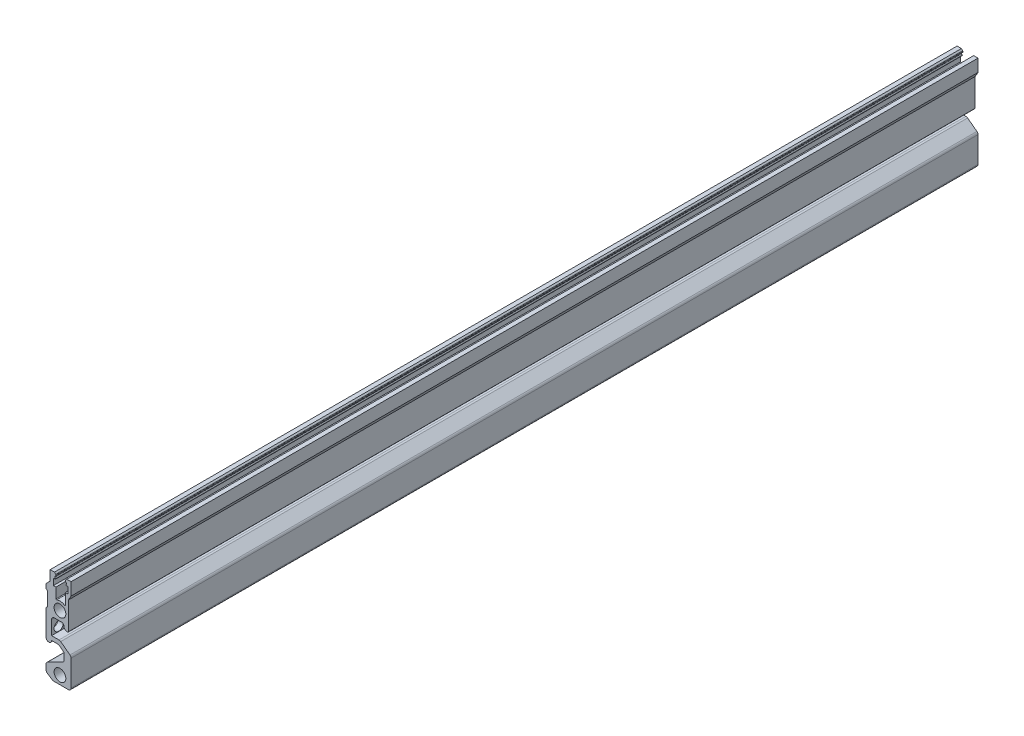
ISO-10303-21;
HEADER;
FILE_DESCRIPTION(('STEP AP214'),'2;1');
FILE_NAME('part.step','',(''),(''),'','','');
FILE_SCHEMA(('AUTOMOTIVE_DESIGN { 1 0 10303 214 1 1 1 1 }'));
ENDSEC;
DATA;
#1=APPLICATION_CONTEXT('core data for automotive mechanical design processes');
#2=APPLICATION_PROTOCOL_DEFINITION('international standard','automotive_design',2000,#1);
#3=PRODUCT_CONTEXT('',#1,'mechanical');
#4=PRODUCT('Part','Part','',(#3));
#5=PRODUCT_RELATED_PRODUCT_CATEGORY('part','',(#4));
#6=PRODUCT_DEFINITION_FORMATION('','',#4);
#7=PRODUCT_DEFINITION_CONTEXT('part definition',#1,'design');
#8=PRODUCT_DEFINITION('design','',#6,#7);
#9=PRODUCT_DEFINITION_SHAPE('','',#8);
#10=(LENGTH_UNIT() NAMED_UNIT(*) SI_UNIT(.MILLI.,.METRE.));
#11=(NAMED_UNIT(*) PLANE_ANGLE_UNIT() SI_UNIT($,.RADIAN.));
#12=(NAMED_UNIT(*) SI_UNIT($,.STERADIAN.) SOLID_ANGLE_UNIT());
#13=UNCERTAINTY_MEASURE_WITH_UNIT(LENGTH_MEASURE(1.E-05),#10,'distance_accuracy_value','');
#14=(GEOMETRIC_REPRESENTATION_CONTEXT(3) GLOBAL_UNCERTAINTY_ASSIGNED_CONTEXT((#13)) GLOBAL_UNIT_ASSIGNED_CONTEXT((#10,
#11,#12)) REPRESENTATION_CONTEXT('',''));
#15=CARTESIAN_POINT('',(0.,0.,0.));
#16=DIRECTION('',(0.,0.,1.));
#17=DIRECTION('',(1.,0.,0.));
#18=AXIS2_PLACEMENT_3D('',#15,#16,#17);
#19=CARTESIAN_POINT('',(0.,-20.0000000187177,162.56));
#20=DIRECTION('',(0.,0.,-1.));
#21=DIRECTION('',(-1.,0.,0.));
#22=AXIS2_PLACEMENT_3D('',#19,#20,#21);
#23=CYLINDRICAL_SURFACE('',#22,1.6);
#24=CARTESIAN_POINT('',(0.,-20.0000000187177,-152.56));
#25=DIRECTION('',(0.,0.,-1.));
#26=DIRECTION('',(-1.,0.,0.));
#27=AXIS2_PLACEMENT_3D('',#24,#25,#26);
#28=CIRCLE('',#27,1.6);
#29=CARTESIAN_POINT('',(-1.6,-20.0000000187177,-152.56));
#30=VERTEX_POINT('',#29);
#31=EDGE_CURVE('E832',#30,#30,#28,.T.);
#32=ORIENTED_EDGE('',*,*,#31,.T.);
#33=EDGE_LOOP('',(#32));
#34=FACE_BOUND('',#33,.T.);
#35=CARTESIAN_POINT('',(0.,-20.0000000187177,152.56));
#36=DIRECTION('',(0.,0.,1.));
#37=DIRECTION('',(1.,0.,0.));
#38=AXIS2_PLACEMENT_3D('',#35,#36,#37);
#39=CIRCLE('',#38,1.6);
#40=CARTESIAN_POINT('',(1.6,-20.0000000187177,152.56));
#41=VERTEX_POINT('',#40);
#42=EDGE_CURVE('E818',#41,#41,#39,.T.);
#43=ORIENTED_EDGE('',*,*,#42,.T.);
#44=EDGE_LOOP('',(#43));
#45=FACE_BOUND('',#44,.T.);
#46=ADVANCED_FACE('F39',(#34,#45),#23,.F.);
#47=CARTESIAN_POINT('',(0.,0.,162.56));
#48=DIRECTION('',(0.,0.,-1.));
#49=DIRECTION('',(-1.,0.,0.));
#50=AXIS2_PLACEMENT_3D('',#47,#48,#49);
#51=CYLINDRICAL_SURFACE('',#50,1.60000000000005);
#52=CARTESIAN_POINT('',(0.,0.,-152.56));
#53=DIRECTION('',(0.,0.,-1.));
#54=DIRECTION('',(-1.,0.,0.));
#55=AXIS2_PLACEMENT_3D('',#52,#53,#54);
#56=CIRCLE('',#55,1.60000000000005);
#57=CARTESIAN_POINT('',(-1.60000000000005,0.,-152.56));
#58=VERTEX_POINT('',#57);
#59=EDGE_CURVE('E839',#58,#58,#56,.T.);
#60=ORIENTED_EDGE('',*,*,#59,.T.);
#61=EDGE_LOOP('',(#60));
#62=FACE_BOUND('',#61,.T.);
#63=CARTESIAN_POINT('',(0.,0.,152.56));
#64=DIRECTION('',(0.,0.,1.));
#65=DIRECTION('',(1.,0.,0.));
#66=AXIS2_PLACEMENT_3D('',#63,#64,#65);
#67=CIRCLE('',#66,1.60000000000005);
#68=CARTESIAN_POINT('',(1.60000000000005,0.,152.56));
#69=VERTEX_POINT('',#68);
#70=EDGE_CURVE('E825',#69,#69,#67,.T.);
#71=ORIENTED_EDGE('',*,*,#70,.T.);
#72=EDGE_LOOP('',(#71));
#73=FACE_BOUND('',#72,.T.);
#74=ADVANCED_FACE('F1683',(#62,#73),#51,.F.);
#75=CARTESIAN_POINT('',(-2.50086526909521,-5.7499999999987,162.56));
#76=DIRECTION('',(0.,0.,-1.));
#77=DIRECTION('',(-1.,0.,0.));
#78=AXIS2_PLACEMENT_3D('',#75,#76,#77);
#79=PLANE('',#78);
#80=CARTESIAN_POINT('',(0.,-20.0000000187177,162.56));
#81=DIRECTION('',(0.,0.,1.));
#82=DIRECTION('',(1.,0.,0.));
#83=AXIS2_PLACEMENT_3D('',#80,#81,#82);
#84=CIRCLE('',#83,2.1);
#85=CARTESIAN_POINT('',(2.1,-20.0000000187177,162.56));
#86=VERTEX_POINT('',#85);
#87=EDGE_CURVE('E819',#86,#86,#84,.T.);
#88=ORIENTED_EDGE('',*,*,#87,.F.);
#89=EDGE_LOOP('',(#88));
#90=FACE_BOUND('',#89,.T.);
#91=CARTESIAN_POINT('',(0.,0.,162.56));
#92=DIRECTION('',(0.,0.,1.));
#93=DIRECTION('',(1.,0.,0.));
#94=AXIS2_PLACEMENT_3D('',#91,#92,#93);
#95=CIRCLE('',#94,2.1);
#96=CARTESIAN_POINT('',(2.1,0.,162.56));
#97=VERTEX_POINT('',#96);
#98=EDGE_CURVE('E826',#97,#97,#95,.T.);
#99=ORIENTED_EDGE('',*,*,#98,.F.);
#100=EDGE_LOOP('',(#99));
#101=FACE_BOUND('',#100,.T.);
#102=DIRECTION('',(0.,1.,0.));
#103=VECTOR('',#102,1.);
#104=CARTESIAN_POINT('',(2.99913473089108,-5.04999999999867,162.56));
#105=LINE('',#104,#103);
#106=CARTESIAN_POINT('',(2.99913473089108,-5.04999999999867,162.56));
#107=VERTEX_POINT('',#106);
#108=CARTESIAN_POINT('',(2.99913473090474,4.80537295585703,162.56));
#109=VERTEX_POINT('',#108);
#110=EDGE_CURVE('E848',#107,#109,#105,.T.);
#111=ORIENTED_EDGE('',*,*,#110,.T.);
#112=DIRECTION('',(0.5,0.866025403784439,0.));
#113=VECTOR('',#112,1.);
#114=CARTESIAN_POINT('',(2.99913473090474,4.80537295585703,162.56));
#115=LINE('',#114,#113);
#116=CARTESIAN_POINT('',(3.9991347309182,6.53742376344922,162.56));
#117=VERTEX_POINT('',#116);
#118=EDGE_CURVE('E851',#109,#117,#115,.T.);
#119=ORIENTED_EDGE('',*,*,#118,.T.);
#120=DIRECTION('',(0.,1.,0.));
#121=VECTOR('',#120,1.);
#122=CARTESIAN_POINT('',(3.9991347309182,6.53742376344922,162.56));
#123=LINE('',#122,#121);
#124=CARTESIAN_POINT('',(3.9991347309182,11.0015907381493,162.56));
#125=VERTEX_POINT('',#124);
#126=EDGE_CURVE('E853',#117,#125,#123,.T.);
#127=ORIENTED_EDGE('',*,*,#126,.T.);
#128=DIRECTION('',(-1.,0.,0.));
#129=VECTOR('',#128,1.);
#130=CARTESIAN_POINT('',(3.9991347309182,11.0015907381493,162.56));
#131=LINE('',#130,#129);
#132=CARTESIAN_POINT('',(2.44913473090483,11.0015907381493,162.56));
#133=VERTEX_POINT('',#132);
#134=EDGE_CURVE('E517',#125,#133,#131,.T.);
#135=ORIENTED_EDGE('',*,*,#134,.T.);
#136=DIRECTION('',(0.707106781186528,0.707106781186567,0.));
#137=VECTOR('',#136,1.);
#138=CARTESIAN_POINT('',(1.94913473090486,10.5015907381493,162.56));
#139=LINE('',#138,#137);
#140=CARTESIAN_POINT('',(2.00771337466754,10.560169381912,162.56));
#141=VERTEX_POINT('',#140);
#142=EDGE_CURVE('E1228',#133,#141,#139,.F.);
#143=ORIENTED_EDGE('',*,*,#142,.T.);
#144=CARTESIAN_POINT('',(2.14913473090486,10.4187480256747,162.56));
#145=DIRECTION('',(0.,0.,-1.));
#146=DIRECTION('',(-1.,0.,0.));
#147=AXIS2_PLACEMENT_3D('',#144,#145,#146);
#148=CIRCLE('',#147,0.2);
#149=CARTESIAN_POINT('',(1.94913473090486,10.4187480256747,162.56));
#150=VERTEX_POINT('',#149);
#151=EDGE_CURVE('E1264',#141,#150,#148,.F.);
#152=ORIENTED_EDGE('',*,*,#151,.T.);
#153=DIRECTION('',(0.,-1.,0.));
#154=VECTOR('',#153,1.);
#155=CARTESIAN_POINT('',(1.94913473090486,11.7915907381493,162.56));
#156=LINE('',#155,#154);
#157=CARTESIAN_POINT('',(1.94913473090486,10.1341483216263,162.56));
#158=VERTEX_POINT('',#157);
#159=EDGE_CURVE('E856',#150,#158,#156,.T.);
#160=ORIENTED_EDGE('',*,*,#159,.T.);
#161=CARTESIAN_POINT('',(2.14913473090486,10.1341483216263,162.56));
#162=DIRECTION('',(0.,0.,-1.));
#163=DIRECTION('',(-1.,0.,0.));
#164=AXIS2_PLACEMENT_3D('',#161,#162,#163);
#165=CIRCLE('',#164,0.2);
#166=CARTESIAN_POINT('',(2.06342044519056,9.95344674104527,162.56));
#167=VERTEX_POINT('',#166);
#168=EDGE_CURVE('E1258',#158,#167,#165,.F.);
#169=ORIENTED_EDGE('',*,*,#168,.T.);
#170=CARTESIAN_POINT('',(1.84913473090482,9.50169278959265,162.56));
#171=DIRECTION('',(0.,0.,-1.));
#172=DIRECTION('',(-1.,0.,0.));
#173=AXIS2_PLACEMENT_3D('',#170,#171,#172);
#174=CIRCLE('',#173,0.5);
#175=CARTESIAN_POINT('',(2.34913473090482,9.50169278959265,162.56));
#176=VERTEX_POINT('',#175);
#177=EDGE_CURVE('E1221',#167,#176,#174,.T.);
#178=ORIENTED_EDGE('',*,*,#177,.T.);
#179=DIRECTION('',(0.,-1.,0.));
#180=VECTOR('',#179,1.);
#181=CARTESIAN_POINT('',(2.34913473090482,8.99159073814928,162.56));
#182=LINE('',#181,#180);
#183=CARTESIAN_POINT('',(2.34913473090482,9.48148868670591,162.56));
#184=VERTEX_POINT('',#183);
#185=EDGE_CURVE('E530',#176,#184,#182,.T.);
#186=ORIENTED_EDGE('',*,*,#185,.T.);
#187=CARTESIAN_POINT('',(1.84913473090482,9.48148868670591,162.56));
#188=DIRECTION('',(0.,0.,-1.));
#189=DIRECTION('',(-1.,0.,0.));
#190=AXIS2_PLACEMENT_3D('',#187,#188,#189);
#191=CIRCLE('',#190,0.5);
#192=CARTESIAN_POINT('',(2.16004280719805,9.08990706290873,162.56));
#193=VERTEX_POINT('',#192);
#194=EDGE_CURVE('E1225',#184,#193,#191,.T.);
#195=ORIENTED_EDGE('',*,*,#194,.T.);
#196=CARTESIAN_POINT('',(2.2222244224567,9.01159073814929,162.56));
#197=DIRECTION('',(0.,0.,-1.));
#198=DIRECTION('',(-1.,0.,0.));
#199=AXIS2_PLACEMENT_3D('',#196,#197,#198);
#200=CIRCLE('',#199,0.1);
#201=CARTESIAN_POINT('',(2.2222244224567,8.91159073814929,162.56));
#202=VERTEX_POINT('',#201);
#203=EDGE_CURVE('E1287',#193,#202,#200,.F.);
#204=ORIENTED_EDGE('',*,*,#203,.T.);
#205=DIRECTION('',(1.,0.,0.));
#206=VECTOR('',#205,1.);
#207=CARTESIAN_POINT('',(1.94913473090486,8.91159073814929,162.56));
#208=LINE('',#207,#206);
#209=CARTESIAN_POINT('',(2.84913473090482,8.91159073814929,162.56));
#210=VERTEX_POINT('',#209);
#211=EDGE_CURVE('E859',#202,#210,#208,.T.);
#212=ORIENTED_EDGE('',*,*,#211,.T.);
#213=DIRECTION('',(0.,-1.,0.));
#214=VECTOR('',#213,1.);
#215=CARTESIAN_POINT('',(2.84913473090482,6.61159073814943,162.56));
#216=LINE('',#215,#214);
#217=CARTESIAN_POINT('',(2.84913473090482,6.61159073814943,162.56));
#218=VERTEX_POINT('',#217);
#219=EDGE_CURVE('E861',#210,#218,#216,.T.);
#220=ORIENTED_EDGE('',*,*,#219,.T.);
#221=DIRECTION('',(-1.,0.,0.));
#222=VECTOR('',#221,1.);
#223=CARTESIAN_POINT('',(2.84913473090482,6.61159073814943,162.56));
#224=LINE('',#223,#222);
#225=CARTESIAN_POINT('',(1.94913473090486,6.61159073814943,162.56));
#226=VERTEX_POINT('',#225);
#227=EDGE_CURVE('E863',#218,#226,#224,.T.);
#228=ORIENTED_EDGE('',*,*,#227,.T.);
#229=DIRECTION('',(0.,-1.,0.));
#230=VECTOR('',#229,1.);
#231=CARTESIAN_POINT('',(1.94913473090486,6.61159073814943,162.56));
#232=LINE('',#231,#230);
#233=CARTESIAN_POINT('',(1.94913473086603,2.67965066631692,162.56));
#234=VERTEX_POINT('',#233);
#235=EDGE_CURVE('E865',#226,#234,#232,.T.);
#236=ORIENTED_EDGE('',*,*,#235,.T.);
#237=CARTESIAN_POINT('',(1.74913473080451,2.67965066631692,162.56));
#238=DIRECTION('',(0.,0.,-1.));
#239=DIRECTION('',(1.,0.,0.));
#240=AXIS2_PLACEMENT_3D('',#237,#238,#239);
#241=CIRCLE('',#240,0.20000000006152);
#242=CARTESIAN_POINT('',(1.6398138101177,2.51217249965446,162.56));
#243=VERTEX_POINT('',#242);
#244=EDGE_CURVE('E868',#234,#243,#241,.T.);
#245=ORIENTED_EDGE('',*,*,#244,.T.);
#246=CARTESIAN_POINT('',(0.,0.,162.56));
#247=DIRECTION('',(0.,0.,1.));
#248=DIRECTION('',(1.,0.,0.));
#249=AXIS2_PLACEMENT_3D('',#246,#247,#248);
#250=CIRCLE('',#249,2.99999999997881);
#251=CARTESIAN_POINT('',(-1.17268618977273,2.76130532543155,162.56));
#252=VERTEX_POINT('',#251);
#253=EDGE_CURVE('E870',#243,#252,#250,.T.);
#254=ORIENTED_EDGE('',*,*,#253,.T.);
#255=CARTESIAN_POINT('',(-1.25086526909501,2.94539234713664,162.56));
#256=DIRECTION('',(0.,0.,-1.));
#257=DIRECTION('',(1.,0.,0.));
#258=AXIS2_PLACEMENT_3D('',#255,#256,#257);
#259=CIRCLE('',#258,0.200000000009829);
#260=CARTESIAN_POINT('',(-1.45086526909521,2.94539234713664,162.56));
#261=VERTEX_POINT('',#260);
#262=EDGE_CURVE('E872',#252,#261,#259,.T.);
#263=ORIENTED_EDGE('',*,*,#262,.T.);
#264=DIRECTION('',(0.,1.,0.));
#265=VECTOR('',#264,1.);
#266=CARTESIAN_POINT('',(-1.45086526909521,2.94539234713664,162.56));
#267=LINE('',#266,#265);
#268=CARTESIAN_POINT('',(-1.45086526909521,6.61159073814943,162.56));
#269=VERTEX_POINT('',#268);
#270=EDGE_CURVE('E874',#261,#269,#267,.T.);
#271=ORIENTED_EDGE('',*,*,#270,.T.);
#272=DIRECTION('',(-1.,0.,0.));
#273=VECTOR('',#272,1.);
#274=CARTESIAN_POINT('',(-1.45086526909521,6.61159073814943,162.56));
#275=LINE('',#274,#273);
#276=CARTESIAN_POINT('',(-2.35086526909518,6.61159073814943,162.56));
#277=VERTEX_POINT('',#276);
#278=EDGE_CURVE('E876',#269,#277,#275,.T.);
#279=ORIENTED_EDGE('',*,*,#278,.T.);
#280=DIRECTION('',(0.,1.,0.));
#281=VECTOR('',#280,1.);
#282=CARTESIAN_POINT('',(-2.35086526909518,8.91159073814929,162.56));
#283=LINE('',#282,#281);
#284=CARTESIAN_POINT('',(-2.35086526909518,8.91159073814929,162.56));
#285=VERTEX_POINT('',#284);
#286=EDGE_CURVE('E878',#277,#285,#283,.T.);
#287=ORIENTED_EDGE('',*,*,#286,.T.);
#288=DIRECTION('',(1.,0.,0.));
#289=VECTOR('',#288,1.);
#290=CARTESIAN_POINT('',(-2.35086526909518,8.91159073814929,162.56));
#291=LINE('',#290,#289);
#292=CARTESIAN_POINT('',(-1.72395496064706,8.91159073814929,162.56));
#293=VERTEX_POINT('',#292);
#294=EDGE_CURVE('E880',#285,#293,#291,.T.);
#295=ORIENTED_EDGE('',*,*,#294,.T.);
#296=CARTESIAN_POINT('',(-1.72395496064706,9.01159073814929,162.56));
#297=DIRECTION('',(0.,0.,-1.));
#298=DIRECTION('',(-1.,0.,0.));
#299=AXIS2_PLACEMENT_3D('',#296,#297,#298);
#300=CIRCLE('',#299,0.1);
#301=CARTESIAN_POINT('',(-1.66177334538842,9.08990706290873,162.56));
#302=VERTEX_POINT('',#301);
#303=EDGE_CURVE('E1289',#293,#302,#300,.F.);
#304=ORIENTED_EDGE('',*,*,#303,.T.);
#305=CARTESIAN_POINT('',(-1.35086526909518,9.48148868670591,162.56));
#306=DIRECTION('',(0.,0.,-1.));
#307=DIRECTION('',(-1.,0.,0.));
#308=AXIS2_PLACEMENT_3D('',#305,#306,#307);
#309=CIRCLE('',#308,0.5);
#310=CARTESIAN_POINT('',(-1.85086526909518,9.48148868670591,162.56));
#311=VERTEX_POINT('',#310);
#312=EDGE_CURVE('E1216',#302,#311,#309,.T.);
#313=ORIENTED_EDGE('',*,*,#312,.T.);
#314=DIRECTION('',(0.,1.,0.));
#315=VECTOR('',#314,1.);
#316=CARTESIAN_POINT('',(-1.85086526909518,8.99159073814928,162.56));
#317=LINE('',#316,#315);
#318=CARTESIAN_POINT('',(-1.85086526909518,9.50169278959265,162.56));
#319=VERTEX_POINT('',#318);
#320=EDGE_CURVE('E527',#311,#319,#317,.T.);
#321=ORIENTED_EDGE('',*,*,#320,.T.);
#322=CARTESIAN_POINT('',(-1.35086526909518,9.50169278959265,162.56));
#323=DIRECTION('',(0.,0.,-1.));
#324=DIRECTION('',(-1.,0.,0.));
#325=AXIS2_PLACEMENT_3D('',#322,#323,#324);
#326=CIRCLE('',#325,0.5);
#327=CARTESIAN_POINT('',(-1.56515098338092,9.95344674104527,162.56));
#328=VERTEX_POINT('',#327);
#329=EDGE_CURVE('E1210',#319,#328,#326,.T.);
#330=ORIENTED_EDGE('',*,*,#329,.T.);
#331=CARTESIAN_POINT('',(-1.65086526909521,10.1341483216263,162.56));
#332=DIRECTION('',(0.,0.,-1.));
#333=DIRECTION('',(-1.,0.,0.));
#334=AXIS2_PLACEMENT_3D('',#331,#332,#333);
#335=CIRCLE('',#334,0.2);
#336=CARTESIAN_POINT('',(-1.45086526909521,10.1341483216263,162.56));
#337=VERTEX_POINT('',#336);
#338=EDGE_CURVE('E1260',#328,#337,#335,.F.);
#339=ORIENTED_EDGE('',*,*,#338,.T.);
#340=DIRECTION('',(0.,1.,0.));
#341=VECTOR('',#340,1.);
#342=CARTESIAN_POINT('',(-1.45086526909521,8.91159073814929,162.56));
#343=LINE('',#342,#341);
#344=CARTESIAN_POINT('',(-1.45086526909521,10.4187480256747,162.56));
#345=VERTEX_POINT('',#344);
#346=EDGE_CURVE('E883',#337,#345,#343,.T.);
#347=ORIENTED_EDGE('',*,*,#346,.T.);
#348=CARTESIAN_POINT('',(-1.65086526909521,10.4187480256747,162.56));
#349=DIRECTION('',(0.,0.,-1.));
#350=DIRECTION('',(-1.,0.,0.));
#351=AXIS2_PLACEMENT_3D('',#348,#349,#350);
#352=CIRCLE('',#351,0.2);
#353=CARTESIAN_POINT('',(-1.5094439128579,10.560169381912,162.56));
#354=VERTEX_POINT('',#353);
#355=EDGE_CURVE('E1262',#345,#354,#352,.F.);
#356=ORIENTED_EDGE('',*,*,#355,.T.);
#357=DIRECTION('',(0.707106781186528,-0.707106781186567,0.));
#358=VECTOR('',#357,1.);
#359=CARTESIAN_POINT('',(-1.45086526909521,10.5015907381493,162.56));
#360=LINE('',#359,#358);
#361=CARTESIAN_POINT('',(-1.95086526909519,11.0015907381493,162.56));
#362=VERTEX_POINT('',#361);
#363=EDGE_CURVE('E1231',#354,#362,#360,.F.);
#364=ORIENTED_EDGE('',*,*,#363,.T.);
#365=CARTESIAN_POINT('',(-3.50086526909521,11.0015907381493,162.56));
#366=VERTEX_POINT('',#365);
#367=EDGE_CURVE('E521',#362,#366,#131,.T.);
#368=ORIENTED_EDGE('',*,*,#367,.T.);
#369=DIRECTION('',(0.,-1.,0.));
#370=VECTOR('',#369,1.);
#371=CARTESIAN_POINT('',(-3.50086526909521,11.0015907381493,162.56));
#372=LINE('',#371,#370);
#373=CARTESIAN_POINT('',(-3.50086526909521,7.44159073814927,162.56));
#374=VERTEX_POINT('',#373);
#375=EDGE_CURVE('E499',#366,#374,#372,.T.);
#376=ORIENTED_EDGE('',*,*,#375,.T.);
#377=DIRECTION('',(-0.707106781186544,-0.707106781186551,0.));
#378=VECTOR('',#377,1.);
#379=CARTESIAN_POINT('',(-3.50086526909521,7.44159073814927,162.56));
#380=LINE('',#379,#378);
#381=CARTESIAN_POINT('',(-5.00086526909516,5.94159073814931,162.56));
#382=VERTEX_POINT('',#381);
#383=EDGE_CURVE('E502',#374,#382,#380,.T.);
#384=ORIENTED_EDGE('',*,*,#383,.T.);
#385=DIRECTION('',(0.,-1.,0.));
#386=VECTOR('',#385,1.);
#387=CARTESIAN_POINT('',(-5.00086526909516,8.5215907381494,162.56));
#388=LINE('',#387,#386);
#389=CARTESIAN_POINT('',(-5.00086526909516,4.44159073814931,162.56));
#390=VERTEX_POINT('',#389);
#391=EDGE_CURVE('E886',#382,#390,#388,.T.);
#392=ORIENTED_EDGE('',*,*,#391,.T.);
#393=DIRECTION('',(0.668928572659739,-0.743326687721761,0.));
#394=VECTOR('',#393,1.);
#395=CARTESIAN_POINT('',(-5.00086526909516,4.44159073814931,162.56));
#396=LINE('',#395,#394);
#397=CARTESIAN_POINT('',(-4.55073320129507,3.94139506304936,162.56));
#398=VERTEX_POINT('',#397);
#399=EDGE_CURVE('E888',#390,#398,#396,.T.);
#400=ORIENTED_EDGE('',*,*,#399,.T.);
#401=DIRECTION('',(-5.28322799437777E-05,-0.999999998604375,0.));
#402=VECTOR('',#401,1.);
#403=CARTESIAN_POINT('',(-4.55073320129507,3.94139506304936,162.56));
#404=LINE('',#403,#402);
#405=CARTESIAN_POINT('',(-4.55099736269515,-1.05860493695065,162.56));
#406=VERTEX_POINT('',#405);
#407=EDGE_CURVE('E890',#398,#406,#404,.T.);
#408=ORIENTED_EDGE('',*,*,#407,.T.);
#409=DIRECTION('',(-0.669000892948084,-0.743261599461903,0.));
#410=VECTOR('',#409,1.);
#411=CARTESIAN_POINT('',(-4.55099736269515,-1.05860493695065,162.56));
#412=LINE('',#411,#410);
#413=CARTESIAN_POINT('',(-5.00086526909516,-1.55840926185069,162.56));
#414=VERTEX_POINT('',#413);
#415=EDGE_CURVE('E892',#406,#414,#412,.T.);
#416=ORIENTED_EDGE('',*,*,#415,.T.);
#417=DIRECTION('',(0.,-1.,0.));
#418=VECTOR('',#417,1.);
#419=CARTESIAN_POINT('',(-5.00086526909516,-1.55840926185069,162.56));
#420=LINE('',#419,#418);
#421=CARTESIAN_POINT('',(-5.00086526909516,-10.75,162.56));
#422=VERTEX_POINT('',#421);
#423=EDGE_CURVE('E894',#414,#422,#420,.T.);
#424=ORIENTED_EDGE('',*,*,#423,.T.);
#425=CARTESIAN_POINT('',(-4.00086526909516,-10.75,162.56));
#426=DIRECTION('',(0.,0.,1.));
#427=DIRECTION('',(1.,0.,0.));
#428=AXIS2_PLACEMENT_3D('',#425,#426,#427);
#429=CIRCLE('',#428,1.);
#430=CARTESIAN_POINT('',(-3.00086526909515,-10.75,162.56));
#431=VERTEX_POINT('',#430);
#432=EDGE_CURVE('E896',#422,#431,#429,.T.);
#433=ORIENTED_EDGE('',*,*,#432,.T.);
#434=DIRECTION('',(1.,0.,0.));
#435=VECTOR('',#434,1.);
#436=CARTESIAN_POINT('',(-3.00086526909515,-10.75,162.56));
#437=LINE('',#436,#435);
#438=CARTESIAN_POINT('',(-0.834198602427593,-10.75,162.56));
#439=VERTEX_POINT('',#438);
#440=EDGE_CURVE('E898',#431,#439,#437,.T.);
#441=ORIENTED_EDGE('',*,*,#440,.T.);
#442=CARTESIAN_POINT('',(-0.834198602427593,-11.75,162.56));
#443=DIRECTION('',(0.,0.,-1.));
#444=DIRECTION('',(-1.,0.,0.));
#445=AXIS2_PLACEMENT_3D('',#442,#443,#444);
#446=CIRCLE('',#445,1.);
#447=CARTESIAN_POINT('',(-0.234198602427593,-10.95,162.56));
#448=VERTEX_POINT('',#447);
#449=EDGE_CURVE('E1361',#439,#448,#446,.T.);
#450=ORIENTED_EDGE('',*,*,#449,.T.);
#451=DIRECTION('',(-0.8,0.6,0.));
#452=VECTOR('',#451,1.);
#453=CARTESIAN_POINT('',(-0.50086526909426,-10.75,162.56));
#454=LINE('',#453,#452);
#455=CARTESIAN_POINT('',(1.49913473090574,-12.25,162.56));
#456=VERTEX_POINT('',#455);
#457=EDGE_CURVE('E469',#456,#448,#454,.T.);
#458=ORIENTED_EDGE('',*,*,#457,.F.);
#459=DIRECTION('',(0.,-1.,0.));
#460=VECTOR('',#459,1.);
#461=CARTESIAN_POINT('',(1.49913473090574,-10.75,162.56));
#462=LINE('',#461,#460);
#463=CARTESIAN_POINT('',(1.49913473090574,-14.6319660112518,162.56));
#464=VERTEX_POINT('',#463);
#465=EDGE_CURVE('E464',#456,#464,#462,.T.);
#466=ORIENTED_EDGE('',*,*,#465,.T.);
#467=CARTESIAN_POINT('',(0.49913473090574,-14.6319660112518,162.56));
#468=DIRECTION('',(0.,0.,-1.));
#469=DIRECTION('',(-1.,0.,0.));
#470=AXIS2_PLACEMENT_3D('',#467,#468,#469);
#471=CIRCLE('',#470,1.);
#472=CARTESIAN_POINT('',(0.946348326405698,-15.5263932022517,162.56));
#473=VERTEX_POINT('',#472);
#474=EDGE_CURVE('E1357',#464,#473,#471,.T.);
#475=ORIENTED_EDGE('',*,*,#474,.T.);
#476=DIRECTION('',(0.894427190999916,0.447213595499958,0.));
#477=VECTOR('',#476,1.);
#478=CARTESIAN_POINT('',(1.49913473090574,-15.2500000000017,162.56));
#479=LINE('',#478,#477);
#480=CARTESIAN_POINT('',(-4.44807886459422,-18.2236067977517,162.56));
#481=VERTEX_POINT('',#480);
#482=EDGE_CURVE('E482',#481,#473,#479,.T.);
#483=ORIENTED_EDGE('',*,*,#482,.F.);
#484=CARTESIAN_POINT('',(-4.00086526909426,-19.1180339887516,162.56));
#485=DIRECTION('',(0.,0.,-1.));
#486=DIRECTION('',(-1.,0.,0.));
#487=AXIS2_PLACEMENT_3D('',#484,#485,#486);
#488=CIRCLE('',#487,1.);
#489=CARTESIAN_POINT('',(-5.00086526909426,-19.1180339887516,162.56));
#490=VERTEX_POINT('',#489);
#491=EDGE_CURVE('E1323',#481,#490,#488,.F.);
#492=ORIENTED_EDGE('',*,*,#491,.T.);
#493=DIRECTION('',(0.,-1.,0.));
#494=VECTOR('',#493,1.);
#495=CARTESIAN_POINT('',(-5.00086526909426,-22.2000000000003,162.56));
#496=LINE('',#495,#494);
#497=CARTESIAN_POINT('',(-5.00086526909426,-20.8323139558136,162.56));
#498=VERTEX_POINT('',#497);
#499=EDGE_CURVE('E902',#490,#498,#496,.T.);
#500=ORIENTED_EDGE('',*,*,#499,.T.);
#501=CARTESIAN_POINT('',(-4.00086526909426,-20.8323139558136,162.56));
#502=DIRECTION('',(0.,0.,-1.));
#503=DIRECTION('',(-1.,0.,0.));
#504=AXIS2_PLACEMENT_3D('',#501,#502,#503);
#505=CIRCLE('',#504,1.);
#506=CARTESIAN_POINT('',(-4.54585361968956,-21.6707575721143,162.56));
#507=VERTEX_POINT('',#506);
#508=EDGE_CURVE('E1325',#498,#507,#505,.F.);
#509=ORIENTED_EDGE('',*,*,#508,.T.);
#510=DIRECTION('',(0.838443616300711,-0.5449883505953,0.));
#511=VECTOR('',#510,1.);
#512=CARTESIAN_POINT('',(-2.50086526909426,-23.0000000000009,162.56));
#513=LINE('',#512,#511);
#514=CARTESIAN_POINT('',(-2.74941355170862,-22.8384436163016,162.56));
#515=VERTEX_POINT('',#514);
#516=EDGE_CURVE('E493',#507,#515,#513,.T.);
#517=ORIENTED_EDGE('',*,*,#516,.T.);
#518=CARTESIAN_POINT('',(-2.20442520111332,-22.0000000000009,162.56));
#519=DIRECTION('',(0.,0.,-1.));
#520=DIRECTION('',(-1.,0.,0.));
#521=AXIS2_PLACEMENT_3D('',#518,#519,#520);
#522=CIRCLE('',#521,1.);
#523=CARTESIAN_POINT('',(-2.20442520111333,-23.0000000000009,162.56));
#524=VERTEX_POINT('',#523);
#525=EDGE_CURVE('E1321',#515,#524,#522,.F.);
#526=ORIENTED_EDGE('',*,*,#525,.T.);
#527=DIRECTION('',(1.,0.,0.));
#528=VECTOR('',#527,1.);
#529=CARTESIAN_POINT('',(2.19913473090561,-23.0000000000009,162.56));
#530=LINE('',#529,#528);
#531=CARTESIAN_POINT('',(2.99913473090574,-23.0000000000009,162.56));
#532=VERTEX_POINT('',#531);
#533=EDGE_CURVE('E905',#524,#532,#530,.T.);
#534=ORIENTED_EDGE('',*,*,#533,.T.);
#535=CARTESIAN_POINT('',(2.99913473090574,-22.0000000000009,162.56));
#536=DIRECTION('',(0.,0.,-1.));
#537=DIRECTION('',(-1.,0.,0.));
#538=AXIS2_PLACEMENT_3D('',#535,#536,#537);
#539=CIRCLE('',#538,1.);
#540=CARTESIAN_POINT('',(3.99913473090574,-22.0000000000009,162.56));
#541=VERTEX_POINT('',#540);
#542=EDGE_CURVE('E59',#532,#541,#539,.F.);
#543=ORIENTED_EDGE('',*,*,#542,.T.);
#544=DIRECTION('',(0.,-1.,0.));
#545=VECTOR('',#544,1.);
#546=CARTESIAN_POINT('',(3.99913473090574,-23.0000000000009,162.56));
#547=LINE('',#546,#545);
#548=CARTESIAN_POINT('',(3.99913473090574,-12.75,162.56));
#549=VERTEX_POINT('',#548);
#550=EDGE_CURVE('E1375',#549,#541,#547,.T.);
#551=ORIENTED_EDGE('',*,*,#550,.F.);
#552=CARTESIAN_POINT('',(2.99913473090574,-12.75,162.56));
#553=DIRECTION('',(0.,0.,-1.));
#554=DIRECTION('',(-1.,0.,0.));
#555=AXIS2_PLACEMENT_3D('',#552,#553,#554);
#556=CIRCLE('',#555,1.);
#557=CARTESIAN_POINT('',(3.59913473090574,-11.95,162.56));
#558=VERTEX_POINT('',#557);
#559=EDGE_CURVE('E47',#549,#558,#556,.F.);
#560=ORIENTED_EDGE('',*,*,#559,.T.);
#561=DIRECTION('',(-0.8,0.6,0.));
#562=VECTOR('',#561,1.);
#563=CARTESIAN_POINT('',(-0.000865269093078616,-9.25000000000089,162.56));
#564=LINE('',#563,#562);
#565=CARTESIAN_POINT('',(0.265801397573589,-9.45000000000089,162.56));
#566=VERTEX_POINT('',#565);
#567=EDGE_CURVE('E475',#558,#566,#564,.T.);
#568=ORIENTED_EDGE('',*,*,#567,.T.);
#569=CARTESIAN_POINT('',(-0.334198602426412,-10.2500000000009,162.56));
#570=DIRECTION('',(0.,0.,-1.));
#571=DIRECTION('',(-1.,0.,0.));
#572=AXIS2_PLACEMENT_3D('',#569,#570,#571);
#573=CIRCLE('',#572,1.);
#574=CARTESIAN_POINT('',(-0.334198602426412,-9.25000000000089,162.56));
#575=VERTEX_POINT('',#574);
#576=EDGE_CURVE('E1319',#566,#575,#573,.F.);
#577=ORIENTED_EDGE('',*,*,#576,.T.);
#578=DIRECTION('',(-1.,0.,0.));
#579=VECTOR('',#578,1.);
#580=CARTESIAN_POINT('',(-3.00086526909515,-9.25000000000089,162.56));
#581=LINE('',#580,#579);
#582=CARTESIAN_POINT('',(-3.00086526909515,-9.25000000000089,162.56));
#583=VERTEX_POINT('',#582);
#584=EDGE_CURVE('E907',#575,#583,#581,.T.);
#585=ORIENTED_EDGE('',*,*,#584,.T.);
#586=DIRECTION('',(0.,1.,0.));
#587=VECTOR('',#586,1.);
#588=CARTESIAN_POINT('',(-3.00086526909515,-9.25000000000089,162.56));
#589=LINE('',#588,#587);
#590=CARTESIAN_POINT('',(-3.00086526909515,-4.24999999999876,162.56));
#591=VERTEX_POINT('',#590);
#592=EDGE_CURVE('E909',#583,#591,#589,.T.);
#593=ORIENTED_EDGE('',*,*,#592,.T.);
#594=CARTESIAN_POINT('',(-2.00086526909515,-4.24999999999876,162.56));
#595=DIRECTION('',(0.,0.,-1.));
#596=DIRECTION('',(-1.,0.,0.));
#597=AXIS2_PLACEMENT_3D('',#594,#595,#596);
#598=CIRCLE('',#597,1.);
#599=CARTESIAN_POINT('',(-2.00086526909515,-3.24999999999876,162.56));
#600=VERTEX_POINT('',#599);
#601=EDGE_CURVE('E1365',#591,#600,#598,.T.);
#602=ORIENTED_EDGE('',*,*,#601,.T.);
#603=DIRECTION('',(1.,0.,0.));
#604=VECTOR('',#603,1.);
#605=CARTESIAN_POINT('',(-3.00086526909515,-3.24999999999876,162.56));
#606=LINE('',#605,#604);
#607=CARTESIAN_POINT('',(0.499134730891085,-3.24999999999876,162.56));
#608=VERTEX_POINT('',#607);
#609=EDGE_CURVE('E487',#600,#608,#606,.T.);
#610=ORIENTED_EDGE('',*,*,#609,.T.);
#611=CARTESIAN_POINT('',(0.499134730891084,-4.24999999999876,162.56));
#612=DIRECTION('',(0.,0.,-1.));
#613=DIRECTION('',(-1.,0.,0.));
#614=AXIS2_PLACEMENT_3D('',#611,#612,#613);
#615=CIRCLE('',#614,1.);
#616=CARTESIAN_POINT('',(1.49913473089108,-4.24999999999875,162.56));
#617=VERTEX_POINT('',#616);
#618=EDGE_CURVE('E1369',#608,#617,#615,.T.);
#619=ORIENTED_EDGE('',*,*,#618,.T.);
#620=CARTESIAN_POINT('',(2.49913473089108,-4.24999999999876,162.56));
#621=DIRECTION('',(0.,0.,-1.));
#622=DIRECTION('',(-1.,0.,0.));
#623=AXIS2_PLACEMENT_3D('',#620,#621,#622);
#624=CIRCLE('',#623,1.);
#625=CARTESIAN_POINT('',(2.49913473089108,-5.24999999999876,162.56));
#626=VERTEX_POINT('',#625);
#627=EDGE_CURVE('E1317',#617,#626,#624,.F.);
#628=ORIENTED_EDGE('',*,*,#627,.T.);
#629=DIRECTION('',(1.,0.,0.));
#630=VECTOR('',#629,1.);
#631=CARTESIAN_POINT('',(-2.50086526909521,-5.24999999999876,162.56));
#632=LINE('',#631,#630);
#633=CARTESIAN_POINT('',(2.79913473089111,-5.2499999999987,162.56));
#634=VERTEX_POINT('',#633);
#635=EDGE_CURVE('E843',#626,#634,#632,.T.);
#636=ORIENTED_EDGE('',*,*,#635,.T.);
#637=CARTESIAN_POINT('',(2.79913473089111,-5.04999999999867,162.56));
#638=DIRECTION('',(0.,0.,1.));
#639=DIRECTION('',(1.,0.,0.));
#640=AXIS2_PLACEMENT_3D('',#637,#638,#639);
#641=CIRCLE('',#640,0.200000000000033);
#642=EDGE_CURVE('E845',#634,#107,#641,.T.);
#643=ORIENTED_EDGE('',*,*,#642,.T.);
#644=EDGE_LOOP('',(#111,#119,#127,#135,#143,#152,#160,#169,#178,#186,#195,#204,#212,#220,#228,
#236,#245,#254,#263,#271,#279,#287,#295,#304,#313,#321,#330,#339,#347,#356,#364,#368,#376,#384,
#392,#400,#408,#416,#424,#433,#441,#450,#458,#466,#475,#483,#492,#500,#509,#517,#526,#534,#543,
#551,#560,#568,#577,#585,#593,#602,#610,#619,#628,#636,#643));
#645=FACE_BOUND('',#644,.T.);
#646=ADVANCED_FACE('F1389',(#90,#101,#645),#79,.F.);
#647=CARTESIAN_POINT('',(-2.50086526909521,-5.7499999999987,-162.56));
#648=DIRECTION('',(0.,0.,-1.));
#649=DIRECTION('',(-1.,0.,0.));
#650=AXIS2_PLACEMENT_3D('',#647,#648,#649);
#651=PLANE('',#650);
#652=DIRECTION('',(0.,1.,0.));
#653=VECTOR('',#652,1.);
#654=CARTESIAN_POINT('',(2.99913473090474,1.24159073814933,-162.56));
#655=LINE('',#654,#653);
#656=CARTESIAN_POINT('',(2.99913473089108,-5.04999999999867,-162.56));
#657=VERTEX_POINT('',#656);
#658=CARTESIAN_POINT('',(2.99913473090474,4.80537295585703,-162.56));
#659=VERTEX_POINT('',#658);
#660=EDGE_CURVE('E918',#657,#659,#655,.T.);
#661=ORIENTED_EDGE('',*,*,#660,.F.);
#662=CARTESIAN_POINT('',(2.79913473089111,-5.04999999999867,-162.56));
#663=DIRECTION('',(0.,0.,1.));
#664=DIRECTION('',(1.,0.,0.));
#665=AXIS2_PLACEMENT_3D('',#662,#663,#664);
#666=CIRCLE('',#665,0.200000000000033);
#667=CARTESIAN_POINT('',(2.79913473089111,-5.2499999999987,-162.56));
#668=VERTEX_POINT('',#667);
#669=EDGE_CURVE('E915',#668,#657,#666,.T.);
#670=ORIENTED_EDGE('',*,*,#669,.F.);
#671=DIRECTION('',(1.,0.,0.));
#672=VECTOR('',#671,1.);
#673=CARTESIAN_POINT('',(-2.50086526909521,-5.24999999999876,-162.56));
#674=LINE('',#673,#672);
#675=CARTESIAN_POINT('',(2.49913473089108,-5.24999999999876,-162.56));
#676=VERTEX_POINT('',#675);
#677=EDGE_CURVE('E913',#676,#668,#674,.T.);
#678=ORIENTED_EDGE('',*,*,#677,.F.);
#679=CARTESIAN_POINT('',(2.49913473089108,-4.24999999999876,-162.56));
#680=DIRECTION('',(0.,0.,-1.));
#681=DIRECTION('',(-1.,0.,0.));
#682=AXIS2_PLACEMENT_3D('',#679,#680,#681);
#683=CIRCLE('',#682,1.);
#684=CARTESIAN_POINT('',(1.49913473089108,-4.24999999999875,-162.56));
#685=VERTEX_POINT('',#684);
#686=EDGE_CURVE('E1301',#676,#685,#683,.T.);
#687=ORIENTED_EDGE('',*,*,#686,.T.);
#688=CARTESIAN_POINT('',(0.499134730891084,-4.24999999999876,-162.56));
#689=DIRECTION('',(0.,0.,-1.));
#690=DIRECTION('',(-1.,0.,0.));
#691=AXIS2_PLACEMENT_3D('',#688,#689,#690);
#692=CIRCLE('',#691,1.);
#693=CARTESIAN_POINT('',(0.499134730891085,-3.24999999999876,-162.56));
#694=VERTEX_POINT('',#693);
#695=EDGE_CURVE('E1367',#685,#694,#692,.F.);
#696=ORIENTED_EDGE('',*,*,#695,.T.);
#697=DIRECTION('',(1.,0.,0.));
#698=VECTOR('',#697,1.);
#699=CARTESIAN_POINT('',(-3.00086526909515,-3.24999999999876,-162.56));
#700=LINE('',#699,#698);
#701=CARTESIAN_POINT('',(-2.00086526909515,-3.24999999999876,-162.56));
#702=VERTEX_POINT('',#701);
#703=EDGE_CURVE('E485',#702,#694,#700,.T.);
#704=ORIENTED_EDGE('',*,*,#703,.F.);
#705=CARTESIAN_POINT('',(-2.00086526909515,-4.24999999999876,-162.56));
#706=DIRECTION('',(0.,0.,-1.));
#707=DIRECTION('',(-1.,0.,0.));
#708=AXIS2_PLACEMENT_3D('',#705,#706,#707);
#709=CIRCLE('',#708,1.);
#710=CARTESIAN_POINT('',(-3.00086526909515,-4.24999999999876,-162.56));
#711=VERTEX_POINT('',#710);
#712=EDGE_CURVE('E1363',#702,#711,#709,.F.);
#713=ORIENTED_EDGE('',*,*,#712,.T.);
#714=DIRECTION('',(0.,1.,0.));
#715=VECTOR('',#714,1.);
#716=CARTESIAN_POINT('',(-3.00086526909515,-9.25000000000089,-162.56));
#717=LINE('',#716,#715);
#718=CARTESIAN_POINT('',(-3.00086526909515,-9.25000000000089,-162.56));
#719=VERTEX_POINT('',#718);
#720=EDGE_CURVE('E846',#719,#711,#717,.T.);
#721=ORIENTED_EDGE('',*,*,#720,.F.);
#722=DIRECTION('',(-1.,0.,0.));
#723=VECTOR('',#722,1.);
#724=CARTESIAN_POINT('',(-3.00086526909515,-9.25000000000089,-162.56));
#725=LINE('',#724,#723);
#726=CARTESIAN_POINT('',(-0.334198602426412,-9.25000000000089,-162.56));
#727=VERTEX_POINT('',#726);
#728=EDGE_CURVE('E974',#727,#719,#725,.T.);
#729=ORIENTED_EDGE('',*,*,#728,.F.);
#730=CARTESIAN_POINT('',(-0.334198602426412,-10.2500000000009,-162.56));
#731=DIRECTION('',(0.,0.,-1.));
#732=DIRECTION('',(-1.,0.,0.));
#733=AXIS2_PLACEMENT_3D('',#730,#731,#732);
#734=CIRCLE('',#733,1.);
#735=CARTESIAN_POINT('',(0.265801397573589,-9.45000000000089,-162.56));
#736=VERTEX_POINT('',#735);
#737=EDGE_CURVE('E1303',#727,#736,#734,.T.);
#738=ORIENTED_EDGE('',*,*,#737,.T.);
#739=DIRECTION('',(-0.8,0.6,0.));
#740=VECTOR('',#739,1.);
#741=CARTESIAN_POINT('',(-0.000865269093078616,-9.25000000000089,-162.56));
#742=LINE('',#741,#740);
#743=CARTESIAN_POINT('',(3.59913473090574,-11.95,-162.56));
#744=VERTEX_POINT('',#743);
#745=EDGE_CURVE('E478',#744,#736,#742,.T.);
#746=ORIENTED_EDGE('',*,*,#745,.F.);
#747=CARTESIAN_POINT('',(2.99913473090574,-12.75,-162.56));
#748=DIRECTION('',(0.,0.,-1.));
#749=DIRECTION('',(-1.,0.,0.));
#750=AXIS2_PLACEMENT_3D('',#747,#748,#749);
#751=CIRCLE('',#750,1.);
#752=CARTESIAN_POINT('',(3.99913473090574,-12.75,-162.56));
#753=VERTEX_POINT('',#752);
#754=EDGE_CURVE('E1380',#744,#753,#751,.T.);
#755=ORIENTED_EDGE('',*,*,#754,.T.);
#756=DIRECTION('',(0.,-1.,0.));
#757=VECTOR('',#756,1.);
#758=CARTESIAN_POINT('',(3.99913473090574,-23.0000000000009,-162.56));
#759=LINE('',#758,#757);
#760=CARTESIAN_POINT('',(3.99913473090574,-22.0000000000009,-162.56));
#761=VERTEX_POINT('',#760);
#762=EDGE_CURVE('E1401',#753,#761,#759,.T.);
#763=ORIENTED_EDGE('',*,*,#762,.T.);
#764=CARTESIAN_POINT('',(2.99913473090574,-22.0000000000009,-162.56));
#765=DIRECTION('',(0.,0.,-1.));
#766=DIRECTION('',(-1.,0.,0.));
#767=AXIS2_PLACEMENT_3D('',#764,#765,#766);
#768=CIRCLE('',#767,1.);
#769=CARTESIAN_POINT('',(2.99913473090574,-23.0000000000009,-162.56));
#770=VERTEX_POINT('',#769);
#771=EDGE_CURVE('E1378',#761,#770,#768,.T.);
#772=ORIENTED_EDGE('',*,*,#771,.T.);
#773=DIRECTION('',(1.,0.,0.));
#774=VECTOR('',#773,1.);
#775=CARTESIAN_POINT('',(2.19913473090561,-23.0000000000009,-162.56));
#776=LINE('',#775,#774);
#777=CARTESIAN_POINT('',(-2.20442520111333,-23.0000000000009,-162.56));
#778=VERTEX_POINT('',#777);
#779=EDGE_CURVE('E972',#778,#770,#776,.T.);
#780=ORIENTED_EDGE('',*,*,#779,.F.);
#781=CARTESIAN_POINT('',(-2.20442520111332,-22.0000000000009,-162.56));
#782=DIRECTION('',(0.,0.,-1.));
#783=DIRECTION('',(-1.,0.,0.));
#784=AXIS2_PLACEMENT_3D('',#781,#782,#783);
#785=CIRCLE('',#784,1.);
#786=CARTESIAN_POINT('',(-2.74941355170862,-22.8384436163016,-162.56));
#787=VERTEX_POINT('',#786);
#788=EDGE_CURVE('E1306',#778,#787,#785,.T.);
#789=ORIENTED_EDGE('',*,*,#788,.T.);
#790=DIRECTION('',(0.838443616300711,-0.5449883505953,0.));
#791=VECTOR('',#790,1.);
#792=CARTESIAN_POINT('',(-2.50086526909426,-23.0000000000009,-162.56));
#793=LINE('',#792,#791);
#794=CARTESIAN_POINT('',(-4.54585361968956,-21.6707575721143,-162.56));
#795=VERTEX_POINT('',#794);
#796=EDGE_CURVE('E490',#795,#787,#793,.T.);
#797=ORIENTED_EDGE('',*,*,#796,.F.);
#798=CARTESIAN_POINT('',(-4.00086526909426,-20.8323139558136,-162.56));
#799=DIRECTION('',(0.,0.,-1.));
#800=DIRECTION('',(-1.,0.,0.));
#801=AXIS2_PLACEMENT_3D('',#798,#799,#800);
#802=CIRCLE('',#801,1.);
#803=CARTESIAN_POINT('',(-5.00086526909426,-20.8323139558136,-162.56));
#804=VERTEX_POINT('',#803);
#805=EDGE_CURVE('E1310',#795,#804,#802,.T.);
#806=ORIENTED_EDGE('',*,*,#805,.T.);
#807=DIRECTION('',(0.,-1.,0.));
#808=VECTOR('',#807,1.);
#809=CARTESIAN_POINT('',(-5.00086526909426,-22.2000000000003,-162.56));
#810=LINE('',#809,#808);
#811=CARTESIAN_POINT('',(-5.00086526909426,-19.1180339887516,-162.56));
#812=VERTEX_POINT('',#811);
#813=EDGE_CURVE('E457',#812,#804,#810,.T.);
#814=ORIENTED_EDGE('',*,*,#813,.F.);
#815=CARTESIAN_POINT('',(-4.00086526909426,-19.1180339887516,-162.56));
#816=DIRECTION('',(0.,0.,-1.));
#817=DIRECTION('',(-1.,0.,0.));
#818=AXIS2_PLACEMENT_3D('',#815,#816,#817);
#819=CIRCLE('',#818,1.);
#820=CARTESIAN_POINT('',(-4.44807886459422,-18.2236067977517,-162.56));
#821=VERTEX_POINT('',#820);
#822=EDGE_CURVE('E1308',#812,#821,#819,.T.);
#823=ORIENTED_EDGE('',*,*,#822,.T.);
#824=DIRECTION('',(0.894427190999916,0.447213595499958,0.));
#825=VECTOR('',#824,1.);
#826=CARTESIAN_POINT('',(1.49913473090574,-15.2500000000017,-162.56));
#827=LINE('',#826,#825);
#828=CARTESIAN_POINT('',(0.946348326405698,-15.5263932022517,-162.56));
#829=VERTEX_POINT('',#828);
#830=EDGE_CURVE('E468',#821,#829,#827,.T.);
#831=ORIENTED_EDGE('',*,*,#830,.T.);
#832=CARTESIAN_POINT('',(0.49913473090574,-14.6319660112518,-162.56));
#833=DIRECTION('',(0.,0.,-1.));
#834=DIRECTION('',(-1.,0.,0.));
#835=AXIS2_PLACEMENT_3D('',#832,#833,#834);
#836=CIRCLE('',#835,1.);
#837=CARTESIAN_POINT('',(1.49913473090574,-14.6319660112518,-162.56));
#838=VERTEX_POINT('',#837);
#839=EDGE_CURVE('E454',#829,#838,#836,.F.);
#840=ORIENTED_EDGE('',*,*,#839,.T.);
#841=DIRECTION('',(0.,-1.,0.));
#842=VECTOR('',#841,1.);
#843=CARTESIAN_POINT('',(1.49913473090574,-10.75,-162.56));
#844=LINE('',#843,#842);
#845=CARTESIAN_POINT('',(1.49913473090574,-12.25,-162.56));
#846=VERTEX_POINT('',#845);
#847=EDGE_CURVE('E447',#846,#838,#844,.T.);
#848=ORIENTED_EDGE('',*,*,#847,.F.);
#849=DIRECTION('',(-0.8,0.6,0.));
#850=VECTOR('',#849,1.);
#851=CARTESIAN_POINT('',(-0.50086526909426,-10.75,-162.56));
#852=LINE('',#851,#850);
#853=CARTESIAN_POINT('',(-0.234198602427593,-10.95,-162.56));
#854=VERTEX_POINT('',#853);
#855=EDGE_CURVE('E452',#846,#854,#852,.T.);
#856=ORIENTED_EDGE('',*,*,#855,.T.);
#857=CARTESIAN_POINT('',(-0.834198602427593,-11.75,-162.56));
#858=DIRECTION('',(0.,0.,-1.));
#859=DIRECTION('',(-1.,0.,0.));
#860=AXIS2_PLACEMENT_3D('',#857,#858,#859);
#861=CIRCLE('',#860,1.);
#862=CARTESIAN_POINT('',(-0.834198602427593,-10.75,-162.56));
#863=VERTEX_POINT('',#862);
#864=EDGE_CURVE('E1359',#854,#863,#861,.F.);
#865=ORIENTED_EDGE('',*,*,#864,.T.);
#866=DIRECTION('',(1.,0.,0.));
#867=VECTOR('',#866,1.);
#868=CARTESIAN_POINT('',(-3.00086526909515,-10.75,-162.56));
#869=LINE('',#868,#867);
#870=CARTESIAN_POINT('',(-3.00086526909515,-10.75,-162.56));
#871=VERTEX_POINT('',#870);
#872=EDGE_CURVE('E458',#871,#863,#869,.T.);
#873=ORIENTED_EDGE('',*,*,#872,.F.);
#874=CARTESIAN_POINT('',(-4.00086526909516,-10.75,-162.56));
#875=DIRECTION('',(0.,0.,1.));
#876=DIRECTION('',(1.,0.,0.));
#877=AXIS2_PLACEMENT_3D('',#874,#875,#876);
#878=CIRCLE('',#877,1.);
#879=CARTESIAN_POINT('',(-5.00086526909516,-10.75,-162.56));
#880=VERTEX_POINT('',#879);
#881=EDGE_CURVE('E966',#880,#871,#878,.T.);
#882=ORIENTED_EDGE('',*,*,#881,.F.);
#883=DIRECTION('',(0.,-1.,0.));
#884=VECTOR('',#883,1.);
#885=CARTESIAN_POINT('',(-5.00086526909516,-1.55840926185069,-162.56));
#886=LINE('',#885,#884);
#887=CARTESIAN_POINT('',(-5.00086526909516,-1.55840926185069,-162.56));
#888=VERTEX_POINT('',#887);
#889=EDGE_CURVE('E964',#888,#880,#886,.T.);
#890=ORIENTED_EDGE('',*,*,#889,.F.);
#891=DIRECTION('',(-0.669000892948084,-0.743261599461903,0.));
#892=VECTOR('',#891,1.);
#893=CARTESIAN_POINT('',(-4.55099736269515,-1.05860493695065,-162.56));
#894=LINE('',#893,#892);
#895=CARTESIAN_POINT('',(-4.55099736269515,-1.05860493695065,-162.56));
#896=VERTEX_POINT('',#895);
#897=EDGE_CURVE('E962',#896,#888,#894,.T.);
#898=ORIENTED_EDGE('',*,*,#897,.F.);
#899=DIRECTION('',(-5.28322799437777E-05,-0.999999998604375,0.));
#900=VECTOR('',#899,1.);
#901=CARTESIAN_POINT('',(-4.55073320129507,3.94139506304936,-162.56));
#902=LINE('',#901,#900);
#903=CARTESIAN_POINT('',(-4.55073320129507,3.94139506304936,-162.56));
#904=VERTEX_POINT('',#903);
#905=EDGE_CURVE('E960',#904,#896,#902,.T.);
#906=ORIENTED_EDGE('',*,*,#905,.F.);
#907=DIRECTION('',(0.668928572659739,-0.743326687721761,0.));
#908=VECTOR('',#907,1.);
#909=CARTESIAN_POINT('',(-5.00086526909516,4.44159073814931,-162.56));
#910=LINE('',#909,#908);
#911=CARTESIAN_POINT('',(-5.00086526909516,4.44159073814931,-162.56));
#912=VERTEX_POINT('',#911);
#913=EDGE_CURVE('E958',#912,#904,#910,.T.);
#914=ORIENTED_EDGE('',*,*,#913,.F.);
#915=DIRECTION('',(0.,-1.,0.));
#916=VECTOR('',#915,1.);
#917=CARTESIAN_POINT('',(-5.00086526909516,8.5215907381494,-162.56));
#918=LINE('',#917,#916);
#919=CARTESIAN_POINT('',(-5.00086526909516,5.94159073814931,-162.56));
#920=VERTEX_POINT('',#919);
#921=EDGE_CURVE('E956',#920,#912,#918,.T.);
#922=ORIENTED_EDGE('',*,*,#921,.F.);
#923=DIRECTION('',(-0.707106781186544,-0.707106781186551,0.));
#924=VECTOR('',#923,1.);
#925=CARTESIAN_POINT('',(-3.50086526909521,7.44159073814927,-162.56));
#926=LINE('',#925,#924);
#927=CARTESIAN_POINT('',(-3.50086526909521,7.44159073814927,-162.56));
#928=VERTEX_POINT('',#927);
#929=EDGE_CURVE('E503',#928,#920,#926,.T.);
#930=ORIENTED_EDGE('',*,*,#929,.F.);
#931=DIRECTION('',(0.,-1.,0.));
#932=VECTOR('',#931,1.);
#933=CARTESIAN_POINT('',(-3.50086526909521,11.0015907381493,-162.56));
#934=LINE('',#933,#932);
#935=CARTESIAN_POINT('',(-3.50086526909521,11.0015907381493,-162.56));
#936=VERTEX_POINT('',#935);
#937=EDGE_CURVE('E496',#936,#928,#934,.T.);
#938=ORIENTED_EDGE('',*,*,#937,.F.);
#939=DIRECTION('',(-1.,0.,0.));
#940=VECTOR('',#939,1.);
#941=CARTESIAN_POINT('',(3.9991347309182,11.0015907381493,-162.56));
#942=LINE('',#941,#940);
#943=CARTESIAN_POINT('',(-1.95086526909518,11.0015907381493,-162.56));
#944=VERTEX_POINT('',#943);
#945=EDGE_CURVE('E513',#944,#936,#942,.T.);
#946=ORIENTED_EDGE('',*,*,#945,.F.);
#947=DIRECTION('',(-0.707106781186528,0.707106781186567,0.));
#948=VECTOR('',#947,1.);
#949=CARTESIAN_POINT('',(6.14993009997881,2.90079536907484,-162.56));
#950=LINE('',#949,#948);
#951=CARTESIAN_POINT('',(-1.5094439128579,10.560169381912,-162.56));
#952=VERTEX_POINT('',#951);
#953=EDGE_CURVE('E1237',#944,#952,#950,.F.);
#954=ORIENTED_EDGE('',*,*,#953,.T.);
#955=CARTESIAN_POINT('',(-1.65086526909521,10.4187480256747,-162.56));
#956=DIRECTION('',(0.,0.,-1.));
#957=DIRECTION('',(-1.,0.,0.));
#958=AXIS2_PLACEMENT_3D('',#955,#956,#957);
#959=CIRCLE('',#958,0.2);
#960=CARTESIAN_POINT('',(-1.45086526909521,10.4187480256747,-162.56));
#961=VERTEX_POINT('',#960);
#962=EDGE_CURVE('E1252',#952,#961,#959,.T.);
#963=ORIENTED_EDGE('',*,*,#962,.T.);
#964=DIRECTION('',(0.,1.,0.));
#965=VECTOR('',#964,1.);
#966=CARTESIAN_POINT('',(-1.45086526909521,8.91159073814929,-162.56));
#967=LINE('',#966,#965);
#968=CARTESIAN_POINT('',(-1.45086526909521,10.1341483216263,-162.56));
#969=VERTEX_POINT('',#968);
#970=EDGE_CURVE('E953',#969,#961,#967,.T.);
#971=ORIENTED_EDGE('',*,*,#970,.F.);
#972=CARTESIAN_POINT('',(-1.65086526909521,10.1341483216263,-162.56));
#973=DIRECTION('',(0.,0.,-1.));
#974=DIRECTION('',(-1.,0.,0.));
#975=AXIS2_PLACEMENT_3D('',#972,#973,#974);
#976=CIRCLE('',#975,0.2);
#977=CARTESIAN_POINT('',(-1.56515098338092,9.95344674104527,-162.56));
#978=VERTEX_POINT('',#977);
#979=EDGE_CURVE('E1250',#969,#978,#976,.T.);
#980=ORIENTED_EDGE('',*,*,#979,.T.);
#981=CARTESIAN_POINT('',(-1.35086526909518,9.50169278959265,-162.56));
#982=DIRECTION('',(0.,0.,-1.));
#983=DIRECTION('',(-1.,0.,0.));
#984=AXIS2_PLACEMENT_3D('',#981,#982,#983);
#985=CIRCLE('',#984,0.5);
#986=CARTESIAN_POINT('',(-1.85086526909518,9.50169278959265,-162.56));
#987=VERTEX_POINT('',#986);
#988=EDGE_CURVE('E1208',#978,#987,#985,.F.);
#989=ORIENTED_EDGE('',*,*,#988,.T.);
#990=DIRECTION('',(0.,1.,0.));
#991=VECTOR('',#990,1.);
#992=CARTESIAN_POINT('',(-1.85086526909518,8.99159073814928,-162.56));
#993=LINE('',#992,#991);
#994=CARTESIAN_POINT('',(-1.85086526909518,9.48148868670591,-162.56));
#995=VERTEX_POINT('',#994);
#996=EDGE_CURVE('E526',#995,#987,#993,.T.);
#997=ORIENTED_EDGE('',*,*,#996,.F.);
#998=CARTESIAN_POINT('',(-1.35086526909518,9.48148868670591,-162.56));
#999=DIRECTION('',(0.,0.,-1.));
#1000=DIRECTION('',(-1.,0.,0.));
#1001=AXIS2_PLACEMENT_3D('',#998,#999,#1000);
#1002=CIRCLE('',#1001,0.5);
#1003=CARTESIAN_POINT('',(-1.66177334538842,9.08990706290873,-162.56));
#1004=VERTEX_POINT('',#1003);
#1005=EDGE_CURVE('E1213',#995,#1004,#1002,.F.);
#1006=ORIENTED_EDGE('',*,*,#1005,.T.);
#1007=CARTESIAN_POINT('',(-1.72395496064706,9.01159073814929,-162.56));
#1008=DIRECTION('',(0.,0.,-1.));
#1009=DIRECTION('',(-1.,0.,0.));
#1010=AXIS2_PLACEMENT_3D('',#1007,#1008,#1009);
#1011=CIRCLE('',#1010,0.1);
#1012=CARTESIAN_POINT('',(-1.72395496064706,8.91159073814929,-162.56));
#1013=VERTEX_POINT('',#1012);
#1014=EDGE_CURVE('E1283',#1004,#1013,#1011,.T.);
#1015=ORIENTED_EDGE('',*,*,#1014,.T.);
#1016=DIRECTION('',(1.,0.,0.));
#1017=VECTOR('',#1016,1.);
#1018=CARTESIAN_POINT('',(-2.35086526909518,8.91159073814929,-162.56));
#1019=LINE('',#1018,#1017);
#1020=CARTESIAN_POINT('',(-2.35086526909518,8.91159073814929,-162.56));
#1021=VERTEX_POINT('',#1020);
#1022=EDGE_CURVE('E950',#1021,#1013,#1019,.T.);
#1023=ORIENTED_EDGE('',*,*,#1022,.F.);
#1024=DIRECTION('',(0.,1.,0.));
#1025=VECTOR('',#1024,1.);
#1026=CARTESIAN_POINT('',(-2.35086526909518,8.91159073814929,-162.56));
#1027=LINE('',#1026,#1025);
#1028=CARTESIAN_POINT('',(-2.35086526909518,6.61159073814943,-162.56));
#1029=VERTEX_POINT('',#1028);
#1030=EDGE_CURVE('E948',#1029,#1021,#1027,.T.);
#1031=ORIENTED_EDGE('',*,*,#1030,.F.);
#1032=DIRECTION('',(-1.,0.,0.));
#1033=VECTOR('',#1032,1.);
#1034=CARTESIAN_POINT('',(-1.45086526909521,6.61159073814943,-162.56));
#1035=LINE('',#1034,#1033);
#1036=CARTESIAN_POINT('',(-1.45086526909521,6.61159073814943,-162.56));
#1037=VERTEX_POINT('',#1036);
#1038=EDGE_CURVE('E946',#1037,#1029,#1035,.T.);
#1039=ORIENTED_EDGE('',*,*,#1038,.F.);
#1040=DIRECTION('',(0.,1.,0.));
#1041=VECTOR('',#1040,1.);
#1042=CARTESIAN_POINT('',(-1.45086526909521,2.94539234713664,-162.56));
#1043=LINE('',#1042,#1041);
#1044=CARTESIAN_POINT('',(-1.45086526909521,2.94539234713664,-162.56));
#1045=VERTEX_POINT('',#1044);
#1046=EDGE_CURVE('E944',#1045,#1037,#1043,.T.);
#1047=ORIENTED_EDGE('',*,*,#1046,.F.);
#1048=CARTESIAN_POINT('',(-1.25086526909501,2.94539234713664,-162.56));
#1049=DIRECTION('',(0.,0.,-1.));
#1050=DIRECTION('',(1.,0.,0.));
#1051=AXIS2_PLACEMENT_3D('',#1048,#1049,#1050);
#1052=CIRCLE('',#1051,0.200000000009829);
#1053=CARTESIAN_POINT('',(-1.17268618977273,2.76130532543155,-162.56));
#1054=VERTEX_POINT('',#1053);
#1055=EDGE_CURVE('E942',#1054,#1045,#1052,.T.);
#1056=ORIENTED_EDGE('',*,*,#1055,.F.);
#1057=CARTESIAN_POINT('',(0.,0.,-162.56));
#1058=DIRECTION('',(0.,0.,1.));
#1059=DIRECTION('',(1.,0.,0.));
#1060=AXIS2_PLACEMENT_3D('',#1057,#1058,#1059);
#1061=CIRCLE('',#1060,2.99999999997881);
#1062=CARTESIAN_POINT('',(1.6398138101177,2.51217249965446,-162.56));
#1063=VERTEX_POINT('',#1062);
#1064=EDGE_CURVE('E940',#1063,#1054,#1061,.T.);
#1065=ORIENTED_EDGE('',*,*,#1064,.F.);
#1066=CARTESIAN_POINT('',(1.74913473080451,2.67965066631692,-162.56));
#1067=DIRECTION('',(0.,0.,-1.));
#1068=DIRECTION('',(1.,0.,0.));
#1069=AXIS2_PLACEMENT_3D('',#1066,#1067,#1068);
#1070=CIRCLE('',#1069,0.20000000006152);
#1071=CARTESIAN_POINT('',(1.94913473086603,2.67965066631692,-162.56));
#1072=VERTEX_POINT('',#1071);
#1073=EDGE_CURVE('E938',#1072,#1063,#1070,.T.);
#1074=ORIENTED_EDGE('',*,*,#1073,.F.);
#1075=DIRECTION('',(0.,-1.,0.));
#1076=VECTOR('',#1075,1.);
#1077=CARTESIAN_POINT('',(1.94913473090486,6.61159073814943,-162.56));
#1078=LINE('',#1077,#1076);
#1079=CARTESIAN_POINT('',(1.94913473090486,6.61159073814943,-162.56));
#1080=VERTEX_POINT('',#1079);
#1081=EDGE_CURVE('E936',#1080,#1072,#1078,.T.);
#1082=ORIENTED_EDGE('',*,*,#1081,.F.);
#1083=DIRECTION('',(-1.,0.,0.));
#1084=VECTOR('',#1083,1.);
#1085=CARTESIAN_POINT('',(2.84913473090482,6.61159073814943,-162.56));
#1086=LINE('',#1085,#1084);
#1087=CARTESIAN_POINT('',(2.84913473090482,6.61159073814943,-162.56));
#1088=VERTEX_POINT('',#1087);
#1089=EDGE_CURVE('E933',#1088,#1080,#1086,.T.);
#1090=ORIENTED_EDGE('',*,*,#1089,.F.);
#1091=DIRECTION('',(0.,-1.,0.));
#1092=VECTOR('',#1091,1.);
#1093=CARTESIAN_POINT('',(2.84913473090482,6.61159073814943,-162.56));
#1094=LINE('',#1093,#1092);
#1095=CARTESIAN_POINT('',(2.84913473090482,8.91159073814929,-162.56));
#1096=VERTEX_POINT('',#1095);
#1097=EDGE_CURVE('E931',#1096,#1088,#1094,.T.);
#1098=ORIENTED_EDGE('',*,*,#1097,.F.);
#1099=DIRECTION('',(1.,0.,0.));
#1100=VECTOR('',#1099,1.);
#1101=CARTESIAN_POINT('',(1.94913473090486,8.91159073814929,-162.56));
#1102=LINE('',#1101,#1100);
#1103=CARTESIAN_POINT('',(2.2222244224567,8.91159073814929,-162.56));
#1104=VERTEX_POINT('',#1103);
#1105=EDGE_CURVE('E929',#1104,#1096,#1102,.T.);
#1106=ORIENTED_EDGE('',*,*,#1105,.F.);
#1107=CARTESIAN_POINT('',(2.2222244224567,9.01159073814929,-162.56));
#1108=DIRECTION('',(0.,0.,-1.));
#1109=DIRECTION('',(-1.,0.,0.));
#1110=AXIS2_PLACEMENT_3D('',#1107,#1108,#1109);
#1111=CIRCLE('',#1110,0.1);
#1112=CARTESIAN_POINT('',(2.16004280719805,9.08990706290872,-162.56));
#1113=VERTEX_POINT('',#1112);
#1114=EDGE_CURVE('E1281',#1104,#1113,#1111,.T.);
#1115=ORIENTED_EDGE('',*,*,#1114,.T.);
#1116=CARTESIAN_POINT('',(1.84913473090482,9.48148868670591,-162.56));
#1117=DIRECTION('',(0.,0.,-1.));
#1118=DIRECTION('',(-1.,0.,0.));
#1119=AXIS2_PLACEMENT_3D('',#1116,#1117,#1118);
#1120=CIRCLE('',#1119,0.5);
#1121=CARTESIAN_POINT('',(2.34913473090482,9.48148868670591,-162.56));
#1122=VERTEX_POINT('',#1121);
#1123=EDGE_CURVE('E1223',#1113,#1122,#1120,.F.);
#1124=ORIENTED_EDGE('',*,*,#1123,.T.);
#1125=DIRECTION('',(0.,-1.,0.));
#1126=VECTOR('',#1125,1.);
#1127=CARTESIAN_POINT('',(2.34913473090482,8.99159073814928,-162.56));
#1128=LINE('',#1127,#1126);
#1129=CARTESIAN_POINT('',(2.34913473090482,9.50169278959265,-162.56));
#1130=VERTEX_POINT('',#1129);
#1131=EDGE_CURVE('E531',#1130,#1122,#1128,.T.);
#1132=ORIENTED_EDGE('',*,*,#1131,.F.);
#1133=CARTESIAN_POINT('',(1.84913473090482,9.50169278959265,-162.56));
#1134=DIRECTION('',(0.,0.,-1.));
#1135=DIRECTION('',(-1.,0.,0.));
#1136=AXIS2_PLACEMENT_3D('',#1133,#1134,#1135);
#1137=CIRCLE('',#1136,0.5);
#1138=CARTESIAN_POINT('',(2.06342044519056,9.95344674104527,-162.56));
#1139=VERTEX_POINT('',#1138);
#1140=EDGE_CURVE('E1218',#1130,#1139,#1137,.F.);
#1141=ORIENTED_EDGE('',*,*,#1140,.T.);
#1142=CARTESIAN_POINT('',(2.14913473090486,10.1341483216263,-162.56));
#1143=DIRECTION('',(0.,0.,-1.));
#1144=DIRECTION('',(-1.,0.,0.));
#1145=AXIS2_PLACEMENT_3D('',#1142,#1143,#1144);
#1146=CIRCLE('',#1145,0.2);
#1147=CARTESIAN_POINT('',(1.94913473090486,10.1341483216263,-162.56));
#1148=VERTEX_POINT('',#1147);
#1149=EDGE_CURVE('E1248',#1139,#1148,#1146,.T.);
#1150=ORIENTED_EDGE('',*,*,#1149,.T.);
#1151=DIRECTION('',(0.,-1.,0.));
#1152=VECTOR('',#1151,1.);
#1153=CARTESIAN_POINT('',(1.94913473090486,11.7915907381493,-162.56));
#1154=LINE('',#1153,#1152);
#1155=CARTESIAN_POINT('',(1.94913473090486,10.4187480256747,-162.56));
#1156=VERTEX_POINT('',#1155);
#1157=EDGE_CURVE('E926',#1156,#1148,#1154,.T.);
#1158=ORIENTED_EDGE('',*,*,#1157,.F.);
#1159=CARTESIAN_POINT('',(2.14913473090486,10.4187480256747,-162.56));
#1160=DIRECTION('',(0.,0.,-1.));
#1161=DIRECTION('',(-1.,0.,0.));
#1162=AXIS2_PLACEMENT_3D('',#1159,#1160,#1161);
#1163=CIRCLE('',#1162,0.2);
#1164=CARTESIAN_POINT('',(2.00771337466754,10.560169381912,-162.56));
#1165=VERTEX_POINT('',#1164);
#1166=EDGE_CURVE('E1254',#1156,#1165,#1163,.T.);
#1167=ORIENTED_EDGE('',*,*,#1166,.T.);
#1168=DIRECTION('',(-0.707106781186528,-0.707106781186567,0.));
#1169=VECTOR('',#1168,1.);
#1170=CARTESIAN_POINT('',(-8.40166063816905,0.150795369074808,-162.56));
#1171=LINE('',#1170,#1169);
#1172=CARTESIAN_POINT('',(2.44913473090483,11.0015907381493,-162.56));
#1173=VERTEX_POINT('',#1172);
#1174=EDGE_CURVE('E1235',#1165,#1173,#1171,.F.);
#1175=ORIENTED_EDGE('',*,*,#1174,.T.);
#1176=CARTESIAN_POINT('',(3.9991347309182,11.0015907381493,-162.56));
#1177=VERTEX_POINT('',#1176);
#1178=EDGE_CURVE('E522',#1177,#1173,#942,.T.);
#1179=ORIENTED_EDGE('',*,*,#1178,.F.);
#1180=DIRECTION('',(0.,1.,0.));
#1181=VECTOR('',#1180,1.);
#1182=CARTESIAN_POINT('',(3.9991347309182,6.53742376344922,-162.56));
#1183=LINE('',#1182,#1181);
#1184=CARTESIAN_POINT('',(3.9991347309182,6.53742376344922,-162.56));
#1185=VERTEX_POINT('',#1184);
#1186=EDGE_CURVE('E923',#1185,#1177,#1183,.T.);
#1187=ORIENTED_EDGE('',*,*,#1186,.F.);
#1188=DIRECTION('',(0.5,0.866025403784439,0.));
#1189=VECTOR('',#1188,1.);
#1190=CARTESIAN_POINT('',(2.99913473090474,4.80537295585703,-162.56));
#1191=LINE('',#1190,#1189);
#1192=EDGE_CURVE('E921',#659,#1185,#1191,.T.);
#1193=ORIENTED_EDGE('',*,*,#1192,.F.);
#1194=EDGE_LOOP('',(#661,#670,#678,#687,#696,#704,#713,#721,#729,#738,#746,#755,#763,#772,#780,
#789,#797,#806,#814,#823,#831,#840,#848,#856,#865,#873,#882,#890,#898,#906,#914,#922,#930,#938,
#946,#954,#963,#971,#980,#989,#997,#1006,#1015,#1023,#1031,#1039,#1047,#1056,#1065,#1074,#1082,
#1090,#1098,#1106,#1115,#1124,#1132,#1141,#1150,#1158,#1167,#1175,#1179,#1187,#1193));
#1195=FACE_BOUND('',#1194,.T.);
#1196=CARTESIAN_POINT('',(0.,-20.0000000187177,-162.56));
#1197=DIRECTION('',(0.,0.,-1.));
#1198=DIRECTION('',(-1.,0.,0.));
#1199=AXIS2_PLACEMENT_3D('',#1196,#1197,#1198);
#1200=CIRCLE('',#1199,2.1);
#1201=CARTESIAN_POINT('',(-2.1,-20.0000000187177,-162.56));
#1202=VERTEX_POINT('',#1201);
#1203=EDGE_CURVE('E833',#1202,#1202,#1200,.T.);
#1204=ORIENTED_EDGE('',*,*,#1203,.F.);
#1205=EDGE_LOOP('',(#1204));
#1206=FACE_BOUND('',#1205,.T.);
#1207=CARTESIAN_POINT('',(0.,0.,-162.56));
#1208=DIRECTION('',(0.,0.,-1.));
#1209=DIRECTION('',(-1.,0.,0.));
#1210=AXIS2_PLACEMENT_3D('',#1207,#1208,#1209);
#1211=CIRCLE('',#1210,2.09999999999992);
#1212=CARTESIAN_POINT('',(-2.09999999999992,0.,-162.56));
#1213=VERTEX_POINT('',#1212);
#1214=EDGE_CURVE('E840',#1213,#1213,#1211,.T.);
#1215=ORIENTED_EDGE('',*,*,#1214,.F.);
#1216=EDGE_LOOP('',(#1215));
#1217=FACE_BOUND('',#1216,.T.);
#1218=ADVANCED_FACE('F449',(#1195,#1206,#1217),#651,.T.);
#1219=CARTESIAN_POINT('',(-2.50086526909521,-5.24999999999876,162.56));
#1220=DIRECTION('',(0.,1.,0.));
#1221=DIRECTION('',(0.,0.,1.));
#1222=AXIS2_PLACEMENT_3D('',#1219,#1220,#1221);
#1223=PLANE('',#1222);
#1224=ORIENTED_EDGE('',*,*,#635,.F.);
#1225=DIRECTION('',(0.,0.,-1.));
#1226=VECTOR('',#1225,1.);
#1227=CARTESIAN_POINT('',(2.49913473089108,-5.24999999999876,162.56));
#1228=LINE('',#1227,#1226);
#1229=EDGE_CURVE('E1354',#626,#676,#1228,.T.);
#1230=ORIENTED_EDGE('',*,*,#1229,.T.);
#1231=ORIENTED_EDGE('',*,*,#677,.T.);
#1232=DIRECTION('',(0.,0.,-1.));
#1233=VECTOR('',#1232,1.);
#1234=CARTESIAN_POINT('',(2.79913473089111,-5.2499999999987,162.56));
#1235=LINE('',#1234,#1233);
#1236=EDGE_CURVE('E1041',#634,#668,#1235,.T.);
#1237=ORIENTED_EDGE('',*,*,#1236,.F.);
#1238=EDGE_LOOP('',(#1224,#1230,#1231,#1237));
#1239=FACE_BOUND('',#1238,.T.);
#1240=ADVANCED_FACE('F1441',(#1239),#1223,.F.);
#1241=CARTESIAN_POINT('',(2.79913473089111,-5.04999999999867,162.56));
#1242=DIRECTION('',(0.,0.,-1.));
#1243=DIRECTION('',(-1.,0.,0.));
#1244=AXIS2_PLACEMENT_3D('',#1241,#1242,#1243);
#1245=CYLINDRICAL_SURFACE('',#1244,0.200000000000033);
#1246=ORIENTED_EDGE('',*,*,#669,.T.);
#1247=DIRECTION('',(0.,0.,-1.));
#1248=VECTOR('',#1247,1.);
#1249=CARTESIAN_POINT('',(2.99913473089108,-5.04999999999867,162.56));
#1250=LINE('',#1249,#1248);
#1251=EDGE_CURVE('E1038',#107,#657,#1250,.T.);
#1252=ORIENTED_EDGE('',*,*,#1251,.F.);
#1253=ORIENTED_EDGE('',*,*,#642,.F.);
#1254=ORIENTED_EDGE('',*,*,#1236,.T.);
#1255=EDGE_LOOP('',(#1246,#1252,#1253,#1254));
#1256=FACE_BOUND('',#1255,.T.);
#1257=ADVANCED_FACE('F1447',(#1256),#1245,.T.);
#1258=CARTESIAN_POINT('',(2.99913473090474,1.24159073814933,162.56));
#1259=DIRECTION('',(-1.,0.,0.));
#1260=DIRECTION('',(0.,0.,1.));
#1261=AXIS2_PLACEMENT_3D('',#1258,#1259,#1260);
#1262=PLANE('',#1261);
#1263=DIRECTION('',(0.,0.,-1.));
#1264=VECTOR('',#1263,1.);
#1265=CARTESIAN_POINT('',(2.99913473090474,4.80537295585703,162.56));
#1266=LINE('',#1265,#1264);
#1267=EDGE_CURVE('E1035',#109,#659,#1266,.T.);
#1268=ORIENTED_EDGE('',*,*,#1267,.F.);
#1269=ORIENTED_EDGE('',*,*,#110,.F.);
#1270=ORIENTED_EDGE('',*,*,#1251,.T.);
#1271=ORIENTED_EDGE('',*,*,#660,.T.);
#1272=EDGE_LOOP('',(#1268,#1269,#1270,#1271));
#1273=FACE_BOUND('',#1272,.T.);
#1274=ADVANCED_FACE('F1452',(#1273),#1262,.F.);
#1275=CARTESIAN_POINT('',(2.99913473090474,4.80537295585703,162.56));
#1276=DIRECTION('',(-0.866025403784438,0.5,0.));
#1277=DIRECTION('',(-0.5,-0.866025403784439,0.));
#1278=AXIS2_PLACEMENT_3D('',#1275,#1276,#1277);
#1279=PLANE('',#1278);
#1280=ORIENTED_EDGE('',*,*,#1192,.T.);
#1281=DIRECTION('',(0.,0.,-1.));
#1282=VECTOR('',#1281,1.);
#1283=CARTESIAN_POINT('',(3.9991347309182,6.53742376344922,162.56));
#1284=LINE('',#1283,#1282);
#1285=EDGE_CURVE('E1032',#117,#1185,#1284,.T.);
#1286=ORIENTED_EDGE('',*,*,#1285,.F.);
#1287=ORIENTED_EDGE('',*,*,#118,.F.);
#1288=ORIENTED_EDGE('',*,*,#1267,.T.);
#1289=EDGE_LOOP('',(#1280,#1286,#1287,#1288));
#1290=FACE_BOUND('',#1289,.T.);
#1291=ADVANCED_FACE('F1457',(#1290),#1279,.F.);
#1292=CARTESIAN_POINT('',(3.9991347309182,6.53742376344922,162.56));
#1293=DIRECTION('',(-1.,0.,0.));
#1294=DIRECTION('',(0.,0.,1.));
#1295=AXIS2_PLACEMENT_3D('',#1292,#1293,#1294);
#1296=PLANE('',#1295);
#1297=ORIENTED_EDGE('',*,*,#1186,.T.);
#1298=DIRECTION('',(0.,0.,-1.));
#1299=VECTOR('',#1298,1.);
#1300=CARTESIAN_POINT('',(3.9991347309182,11.0015907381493,162.56));
#1301=LINE('',#1300,#1299);
#1302=EDGE_CURVE('E520',#125,#1177,#1301,.T.);
#1303=ORIENTED_EDGE('',*,*,#1302,.F.);
#1304=ORIENTED_EDGE('',*,*,#126,.F.);
#1305=ORIENTED_EDGE('',*,*,#1285,.T.);
#1306=EDGE_LOOP('',(#1297,#1303,#1304,#1305));
#1307=FACE_BOUND('',#1306,.T.);
#1308=ADVANCED_FACE('F1461',(#1307),#1296,.F.);
#1309=CARTESIAN_POINT('',(1.94913473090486,11.7915907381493,162.56));
#1310=DIRECTION('',(1.,0.,0.));
#1311=DIRECTION('',(0.,0.,-1.));
#1312=AXIS2_PLACEMENT_3D('',#1309,#1310,#1311);
#1313=PLANE('',#1312);
#1314=ORIENTED_EDGE('',*,*,#159,.F.);
#1315=DIRECTION('',(0.,0.,1.));
#1316=VECTOR('',#1315,1.);
#1317=CARTESIAN_POINT('',(1.94913473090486,10.4187480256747,-162.56));
#1318=LINE('',#1317,#1316);
#1319=EDGE_CURVE('E1245',#150,#1156,#1318,.F.);
#1320=ORIENTED_EDGE('',*,*,#1319,.T.);
#1321=ORIENTED_EDGE('',*,*,#1157,.T.);
#1322=DIRECTION('',(0.,0.,-1.));
#1323=VECTOR('',#1322,1.);
#1324=CARTESIAN_POINT('',(1.94913473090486,10.1341483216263,162.56));
#1325=LINE('',#1324,#1323);
#1326=EDGE_CURVE('E1242',#1148,#158,#1325,.F.);
#1327=ORIENTED_EDGE('',*,*,#1326,.T.);
#1328=EDGE_LOOP('',(#1314,#1320,#1321,#1327));
#1329=FACE_BOUND('',#1328,.T.);
#1330=ADVANCED_FACE('F1478',(#1329),#1313,.F.);
#1331=CARTESIAN_POINT('',(1.94913473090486,8.91159073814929,162.56));
#1332=DIRECTION('',(0.,1.,0.));
#1333=DIRECTION('',(0.,0.,1.));
#1334=AXIS2_PLACEMENT_3D('',#1331,#1332,#1333);
#1335=PLANE('',#1334);
#1336=ORIENTED_EDGE('',*,*,#211,.F.);
#1337=DIRECTION('',(0.,0.,1.));
#1338=VECTOR('',#1337,1.);
#1339=CARTESIAN_POINT('',(2.2222244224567,8.91159073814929,162.56));
#1340=LINE('',#1339,#1338);
#1341=EDGE_CURVE('E1291',#202,#1104,#1340,.F.);
#1342=ORIENTED_EDGE('',*,*,#1341,.T.);
#1343=ORIENTED_EDGE('',*,*,#1105,.T.);
#1344=DIRECTION('',(0.,0.,-1.));
#1345=VECTOR('',#1344,1.);
#1346=CARTESIAN_POINT('',(2.84913473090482,8.91159073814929,162.56));
#1347=LINE('',#1346,#1345);
#1348=EDGE_CURVE('E1029',#210,#1096,#1347,.T.);
#1349=ORIENTED_EDGE('',*,*,#1348,.F.);
#1350=EDGE_LOOP('',(#1336,#1342,#1343,#1349));
#1351=FACE_BOUND('',#1350,.T.);
#1352=ADVANCED_FACE('F1506',(#1351),#1335,.F.);
#1353=CARTESIAN_POINT('',(2.84913473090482,6.61159073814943,162.56));
#1354=DIRECTION('',(1.,0.,0.));
#1355=DIRECTION('',(0.,1.,0.));
#1356=AXIS2_PLACEMENT_3D('',#1353,#1354,#1355);
#1357=PLANE('',#1356);
#1358=ORIENTED_EDGE('',*,*,#1097,.T.);
#1359=DIRECTION('',(0.,0.,-1.));
#1360=VECTOR('',#1359,1.);
#1361=CARTESIAN_POINT('',(2.84913473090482,6.61159073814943,162.56));
#1362=LINE('',#1361,#1360);
#1363=EDGE_CURVE('E1026',#218,#1088,#1362,.T.);
#1364=ORIENTED_EDGE('',*,*,#1363,.F.);
#1365=ORIENTED_EDGE('',*,*,#219,.F.);
#1366=ORIENTED_EDGE('',*,*,#1348,.T.);
#1367=EDGE_LOOP('',(#1358,#1364,#1365,#1366));
#1368=FACE_BOUND('',#1367,.T.);
#1369=ADVANCED_FACE('F1511',(#1368),#1357,.F.);
#1370=CARTESIAN_POINT('',(2.84913473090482,6.61159073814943,162.56));
#1371=DIRECTION('',(0.,-1.,0.));
#1372=DIRECTION('',(1.,0.,0.));
#1373=AXIS2_PLACEMENT_3D('',#1370,#1371,#1372);
#1374=PLANE('',#1373);
#1375=ORIENTED_EDGE('',*,*,#1089,.T.);
#1376=DIRECTION('',(0.,0.,-1.));
#1377=VECTOR('',#1376,1.);
#1378=CARTESIAN_POINT('',(1.94913473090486,6.61159073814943,162.56));
#1379=LINE('',#1378,#1377);
#1380=EDGE_CURVE('E1023',#226,#1080,#1379,.T.);
#1381=ORIENTED_EDGE('',*,*,#1380,.F.);
#1382=ORIENTED_EDGE('',*,*,#227,.F.);
#1383=ORIENTED_EDGE('',*,*,#1363,.T.);
#1384=EDGE_LOOP('',(#1375,#1381,#1382,#1383));
#1385=FACE_BOUND('',#1384,.T.);
#1386=ADVANCED_FACE('F1517',(#1385),#1374,.F.);
#1387=CARTESIAN_POINT('',(1.94913473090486,6.61159073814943,162.56));
#1388=DIRECTION('',(1.,0.,0.));
#1389=DIRECTION('',(0.,0.,-1.));
#1390=AXIS2_PLACEMENT_3D('',#1387,#1388,#1389);
#1391=PLANE('',#1390);
#1392=ORIENTED_EDGE('',*,*,#1081,.T.);
#1393=DIRECTION('',(0.,0.,-1.));
#1394=VECTOR('',#1393,1.);
#1395=CARTESIAN_POINT('',(1.94913473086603,2.67965066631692,162.56));
#1396=LINE('',#1395,#1394);
#1397=EDGE_CURVE('E1019',#234,#1072,#1396,.T.);
#1398=ORIENTED_EDGE('',*,*,#1397,.F.);
#1399=ORIENTED_EDGE('',*,*,#235,.F.);
#1400=ORIENTED_EDGE('',*,*,#1380,.T.);
#1401=EDGE_LOOP('',(#1392,#1398,#1399,#1400));
#1402=FACE_BOUND('',#1401,.T.);
#1403=ADVANCED_FACE('F1521',(#1402),#1391,.F.);
#1404=CARTESIAN_POINT('',(1.74913473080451,2.67965066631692,162.56));
#1405=DIRECTION('',(0.,0.,-1.));
#1406=DIRECTION('',(-1.,0.,0.));
#1407=AXIS2_PLACEMENT_3D('',#1404,#1405,#1406);
#1408=CYLINDRICAL_SURFACE('',#1407,0.20000000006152);
#1409=ORIENTED_EDGE('',*,*,#1073,.T.);
#1410=DIRECTION('',(0.,0.,-1.));
#1411=VECTOR('',#1410,1.);
#1412=CARTESIAN_POINT('',(1.6398138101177,2.51217249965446,162.56));
#1413=LINE('',#1412,#1411);
#1414=EDGE_CURVE('E1015',#243,#1063,#1413,.T.);
#1415=ORIENTED_EDGE('',*,*,#1414,.F.);
#1416=ORIENTED_EDGE('',*,*,#244,.F.);
#1417=ORIENTED_EDGE('',*,*,#1397,.T.);
#1418=EDGE_LOOP('',(#1409,#1415,#1416,#1417));
#1419=FACE_BOUND('',#1418,.T.);
#1420=ADVANCED_FACE('F1526',(#1419),#1408,.F.);
#1421=CARTESIAN_POINT('',(0.,0.,162.56));
#1422=DIRECTION('',(0.,0.,-1.));
#1423=DIRECTION('',(-1.,0.,0.));
#1424=AXIS2_PLACEMENT_3D('',#1421,#1422,#1423);
#1425=CYLINDRICAL_SURFACE('',#1424,2.99999999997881);
#1426=ORIENTED_EDGE('',*,*,#1064,.T.);
#1427=DIRECTION('',(0.,0.,-1.));
#1428=VECTOR('',#1427,1.);
#1429=CARTESIAN_POINT('',(-1.17268618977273,2.76130532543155,162.56));
#1430=LINE('',#1429,#1428);
#1431=EDGE_CURVE('E1012',#252,#1054,#1430,.T.);
#1432=ORIENTED_EDGE('',*,*,#1431,.F.);
#1433=ORIENTED_EDGE('',*,*,#253,.F.);
#1434=ORIENTED_EDGE('',*,*,#1414,.T.);
#1435=EDGE_LOOP('',(#1426,#1432,#1433,#1434));
#1436=FACE_BOUND('',#1435,.T.);
#1437=ADVANCED_FACE('F1532',(#1436),#1425,.T.);
#1438=CARTESIAN_POINT('',(-1.25086526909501,2.94539234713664,162.56));
#1439=DIRECTION('',(0.,0.,-1.));
#1440=DIRECTION('',(-1.,0.,0.));
#1441=AXIS2_PLACEMENT_3D('',#1438,#1439,#1440);
#1442=CYLINDRICAL_SURFACE('',#1441,0.200000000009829);
#1443=ORIENTED_EDGE('',*,*,#1055,.T.);
#1444=DIRECTION('',(0.,0.,-1.));
#1445=VECTOR('',#1444,1.);
#1446=CARTESIAN_POINT('',(-1.45086526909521,2.94539234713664,162.56));
#1447=LINE('',#1446,#1445);
#1448=EDGE_CURVE('E1009',#261,#1045,#1447,.T.);
#1449=ORIENTED_EDGE('',*,*,#1448,.F.);
#1450=ORIENTED_EDGE('',*,*,#262,.F.);
#1451=ORIENTED_EDGE('',*,*,#1431,.T.);
#1452=EDGE_LOOP('',(#1443,#1449,#1450,#1451));
#1453=FACE_BOUND('',#1452,.T.);
#1454=ADVANCED_FACE('F1536',(#1453),#1442,.F.);
#1455=CARTESIAN_POINT('',(-1.45086526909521,2.94539234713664,162.56));
#1456=DIRECTION('',(-1.,0.,0.));
#1457=DIRECTION('',(0.,0.,1.));
#1458=AXIS2_PLACEMENT_3D('',#1455,#1456,#1457);
#1459=PLANE('',#1458);
#1460=ORIENTED_EDGE('',*,*,#1046,.T.);
#1461=DIRECTION('',(0.,0.,-1.));
#1462=VECTOR('',#1461,1.);
#1463=CARTESIAN_POINT('',(-1.45086526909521,6.61159073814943,162.56));
#1464=LINE('',#1463,#1462);
#1465=EDGE_CURVE('E1006',#269,#1037,#1464,.T.);
#1466=ORIENTED_EDGE('',*,*,#1465,.F.);
#1467=ORIENTED_EDGE('',*,*,#270,.F.);
#1468=ORIENTED_EDGE('',*,*,#1448,.T.);
#1469=EDGE_LOOP('',(#1460,#1466,#1467,#1468));
#1470=FACE_BOUND('',#1469,.T.);
#1471=ADVANCED_FACE('F1541',(#1470),#1459,.F.);
#1472=CARTESIAN_POINT('',(-1.45086526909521,6.61159073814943,162.56));
#1473=DIRECTION('',(0.,-1.,0.));
#1474=DIRECTION('',(0.,0.,-1.));
#1475=AXIS2_PLACEMENT_3D('',#1472,#1473,#1474);
#1476=PLANE('',#1475);
#1477=ORIENTED_EDGE('',*,*,#1038,.T.);
#1478=DIRECTION('',(0.,0.,-1.));
#1479=VECTOR('',#1478,1.);
#1480=CARTESIAN_POINT('',(-2.35086526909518,6.61159073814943,162.56));
#1481=LINE('',#1480,#1479);
#1482=EDGE_CURVE('E1003',#277,#1029,#1481,.T.);
#1483=ORIENTED_EDGE('',*,*,#1482,.F.);
#1484=ORIENTED_EDGE('',*,*,#278,.F.);
#1485=ORIENTED_EDGE('',*,*,#1465,.T.);
#1486=EDGE_LOOP('',(#1477,#1483,#1484,#1485));
#1487=FACE_BOUND('',#1486,.T.);
#1488=ADVANCED_FACE('F1547',(#1487),#1476,.F.);
#1489=CARTESIAN_POINT('',(-2.35086526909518,8.91159073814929,162.56));
#1490=DIRECTION('',(-1.,0.,0.));
#1491=DIRECTION('',(0.,0.,1.));
#1492=AXIS2_PLACEMENT_3D('',#1489,#1490,#1491);
#1493=PLANE('',#1492);
#1494=ORIENTED_EDGE('',*,*,#1030,.T.);
#1495=DIRECTION('',(0.,0.,-1.));
#1496=VECTOR('',#1495,1.);
#1497=CARTESIAN_POINT('',(-2.35086526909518,8.91159073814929,162.56));
#1498=LINE('',#1497,#1496);
#1499=EDGE_CURVE('E1000',#285,#1021,#1498,.T.);
#1500=ORIENTED_EDGE('',*,*,#1499,.F.);
#1501=ORIENTED_EDGE('',*,*,#286,.F.);
#1502=ORIENTED_EDGE('',*,*,#1482,.T.);
#1503=EDGE_LOOP('',(#1494,#1500,#1501,#1502));
#1504=FACE_BOUND('',#1503,.T.);
#1505=ADVANCED_FACE('F1551',(#1504),#1493,.F.);
#1506=CARTESIAN_POINT('',(-2.35086526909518,8.91159073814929,162.56));
#1507=DIRECTION('',(0.,1.,0.));
#1508=DIRECTION('',(0.,0.,1.));
#1509=AXIS2_PLACEMENT_3D('',#1506,#1507,#1508);
#1510=PLANE('',#1509);
#1511=ORIENTED_EDGE('',*,*,#1022,.T.);
#1512=DIRECTION('',(0.,0.,-1.));
#1513=VECTOR('',#1512,1.);
#1514=CARTESIAN_POINT('',(-1.72395496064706,8.91159073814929,162.56));
#1515=LINE('',#1514,#1513);
#1516=EDGE_CURVE('E1285',#1013,#293,#1515,.F.);
#1517=ORIENTED_EDGE('',*,*,#1516,.T.);
#1518=ORIENTED_EDGE('',*,*,#294,.F.);
#1519=ORIENTED_EDGE('',*,*,#1499,.T.);
#1520=EDGE_LOOP('',(#1511,#1517,#1518,#1519));
#1521=FACE_BOUND('',#1520,.T.);
#1522=ADVANCED_FACE('F1555',(#1521),#1510,.F.);
#1523=CARTESIAN_POINT('',(-1.45086526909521,8.91159073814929,162.56));
#1524=DIRECTION('',(-1.,0.,0.));
#1525=DIRECTION('',(0.,0.,1.));
#1526=AXIS2_PLACEMENT_3D('',#1523,#1524,#1525);
#1527=PLANE('',#1526);
#1528=ORIENTED_EDGE('',*,*,#970,.T.);
#1529=DIRECTION('',(0.,0.,-1.));
#1530=VECTOR('',#1529,1.);
#1531=CARTESIAN_POINT('',(-1.45086526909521,10.4187480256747,162.56));
#1532=LINE('',#1531,#1530);
#1533=EDGE_CURVE('E1269',#961,#345,#1532,.F.);
#1534=ORIENTED_EDGE('',*,*,#1533,.T.);
#1535=ORIENTED_EDGE('',*,*,#346,.F.);
#1536=DIRECTION('',(0.,0.,1.));
#1537=VECTOR('',#1536,1.);
#1538=CARTESIAN_POINT('',(-1.45086526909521,10.1341483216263,162.56));
#1539=LINE('',#1538,#1537);
#1540=EDGE_CURVE('E1266',#337,#969,#1539,.F.);
#1541=ORIENTED_EDGE('',*,*,#1540,.T.);
#1542=EDGE_LOOP('',(#1528,#1534,#1535,#1541));
#1543=FACE_BOUND('',#1542,.T.);
#1544=ADVANCED_FACE('F1582',(#1543),#1527,.F.);
#1545=CARTESIAN_POINT('',(-5.00086526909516,8.5215907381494,162.56));
#1546=DIRECTION('',(1.,0.,0.));
#1547=DIRECTION('',(0.,0.,-1.));
#1548=AXIS2_PLACEMENT_3D('',#1545,#1546,#1547);
#1549=PLANE('',#1548);
#1550=ORIENTED_EDGE('',*,*,#391,.F.);
#1551=DIRECTION('',(0.,0.,-1.));
#1552=VECTOR('',#1551,1.);
#1553=CARTESIAN_POINT('',(-5.00086526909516,5.94159073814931,162.56));
#1554=LINE('',#1553,#1552);
#1555=EDGE_CURVE('E510',#382,#920,#1554,.T.);
#1556=ORIENTED_EDGE('',*,*,#1555,.T.);
#1557=ORIENTED_EDGE('',*,*,#921,.T.);
#1558=DIRECTION('',(0.,0.,-1.));
#1559=VECTOR('',#1558,1.);
#1560=CARTESIAN_POINT('',(-5.00086526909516,4.44159073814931,162.56));
#1561=LINE('',#1560,#1559);
#1562=EDGE_CURVE('E996',#390,#912,#1561,.T.);
#1563=ORIENTED_EDGE('',*,*,#1562,.F.);
#1564=EDGE_LOOP('',(#1550,#1556,#1557,#1563));
#1565=FACE_BOUND('',#1564,.T.);
#1566=ADVANCED_FACE('F1610',(#1565),#1549,.F.);
#1567=CARTESIAN_POINT('',(-5.00086526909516,4.44159073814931,162.56));
#1568=DIRECTION('',(0.743326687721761,0.668928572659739,0.));
#1569=DIRECTION('',(-0.668928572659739,0.743326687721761,0.));
#1570=AXIS2_PLACEMENT_3D('',#1567,#1568,#1569);
#1571=PLANE('',#1570);
#1572=ORIENTED_EDGE('',*,*,#913,.T.);
#1573=DIRECTION('',(0.,0.,-1.));
#1574=VECTOR('',#1573,1.);
#1575=CARTESIAN_POINT('',(-4.55073320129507,3.94139506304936,162.56));
#1576=LINE('',#1575,#1574);
#1577=EDGE_CURVE('E993',#398,#904,#1576,.T.);
#1578=ORIENTED_EDGE('',*,*,#1577,.F.);
#1579=ORIENTED_EDGE('',*,*,#399,.F.);
#1580=ORIENTED_EDGE('',*,*,#1562,.T.);
#1581=EDGE_LOOP('',(#1572,#1578,#1579,#1580));
#1582=FACE_BOUND('',#1581,.T.);
#1583=ADVANCED_FACE('F1615',(#1582),#1571,.F.);
#1584=CARTESIAN_POINT('',(-4.55073320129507,3.94139506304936,162.56));
#1585=DIRECTION('',(0.999999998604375,-5.28322799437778E-05,0.));
#1586=DIRECTION('',(5.28322799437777E-05,0.999999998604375,0.));
#1587=AXIS2_PLACEMENT_3D('',#1584,#1585,#1586);
#1588=PLANE('',#1587);
#1589=ORIENTED_EDGE('',*,*,#905,.T.);
#1590=DIRECTION('',(0.,0.,-1.));
#1591=VECTOR('',#1590,1.);
#1592=CARTESIAN_POINT('',(-4.55099736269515,-1.05860493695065,162.56));
#1593=LINE('',#1592,#1591);
#1594=EDGE_CURVE('E990',#406,#896,#1593,.T.);
#1595=ORIENTED_EDGE('',*,*,#1594,.F.);
#1596=ORIENTED_EDGE('',*,*,#407,.F.);
#1597=ORIENTED_EDGE('',*,*,#1577,.T.);
#1598=EDGE_LOOP('',(#1589,#1595,#1596,#1597));
#1599=FACE_BOUND('',#1598,.T.);
#1600=ADVANCED_FACE('F1621',(#1599),#1588,.F.);
#1601=CARTESIAN_POINT('',(-4.55099736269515,-1.05860493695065,162.56));
#1602=DIRECTION('',(0.743261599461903,-0.669000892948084,0.));
#1603=DIRECTION('',(0.669000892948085,0.743261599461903,0.));
#1604=AXIS2_PLACEMENT_3D('',#1601,#1602,#1603);
#1605=PLANE('',#1604);
#1606=ORIENTED_EDGE('',*,*,#897,.T.);
#1607=DIRECTION('',(0.,0.,-1.));
#1608=VECTOR('',#1607,1.);
#1609=CARTESIAN_POINT('',(-5.00086526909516,-1.55840926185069,162.56));
#1610=LINE('',#1609,#1608);
#1611=EDGE_CURVE('E986',#414,#888,#1610,.T.);
#1612=ORIENTED_EDGE('',*,*,#1611,.F.);
#1613=ORIENTED_EDGE('',*,*,#415,.F.);
#1614=ORIENTED_EDGE('',*,*,#1594,.T.);
#1615=EDGE_LOOP('',(#1606,#1612,#1613,#1614));
#1616=FACE_BOUND('',#1615,.T.);
#1617=ADVANCED_FACE('F1625',(#1616),#1605,.F.);
#1618=CARTESIAN_POINT('',(-5.00086526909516,-1.55840926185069,162.56));
#1619=DIRECTION('',(1.,0.,0.));
#1620=DIRECTION('',(0.,0.,-1.));
#1621=AXIS2_PLACEMENT_3D('',#1618,#1619,#1620);
#1622=PLANE('',#1621);
#1623=CARTESIAN_POINT('',(-5.00086526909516,-7.5,160.02));
#1624=DIRECTION('',(-1.,0.,0.));
#1625=DIRECTION('',(0.,0.,1.));
#1626=AXIS2_PLACEMENT_3D('',#1623,#1624,#1625);
#1627=CIRCLE('',#1626,1.65000000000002);
#1628=CARTESIAN_POINT('',(-5.00086526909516,-7.5,161.67));
#1629=VERTEX_POINT('',#1628);
#1630=EDGE_CURVE('E534',#1629,#1629,#1627,.T.);
#1631=ORIENTED_EDGE('',*,*,#1630,.F.);
#1632=EDGE_LOOP('',(#1631));
#1633=FACE_BOUND('',#1632,.T.);
#1634=CARTESIAN_POINT('',(-5.00086526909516,-7.5,154.94));
#1635=DIRECTION('',(-1.,0.,0.));
#1636=DIRECTION('',(0.,0.,1.));
#1637=AXIS2_PLACEMENT_3D('',#1634,#1635,#1636);
#1638=CIRCLE('',#1637,1.65000000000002);
#1639=CARTESIAN_POINT('',(-5.00086526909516,-7.5,156.59));
#1640=VERTEX_POINT('',#1639);
#1641=EDGE_CURVE('E542',#1640,#1640,#1638,.T.);
#1642=ORIENTED_EDGE('',*,*,#1641,.F.);
#1643=EDGE_LOOP('',(#1642));
#1644=FACE_BOUND('',#1643,.T.);
#1645=CARTESIAN_POINT('',(-5.00086526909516,-7.5,149.86));
#1646=DIRECTION('',(-1.,0.,0.));
#1647=DIRECTION('',(0.,0.,1.));
#1648=AXIS2_PLACEMENT_3D('',#1645,#1646,#1647);
#1649=CIRCLE('',#1648,1.65000000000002);
#1650=CARTESIAN_POINT('',(-5.00086526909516,-7.5,151.51));
#1651=VERTEX_POINT('',#1650);
#1652=EDGE_CURVE('E546',#1651,#1651,#1649,.T.);
#1653=ORIENTED_EDGE('',*,*,#1652,.F.);
#1654=EDGE_LOOP('',(#1653));
#1655=FACE_BOUND('',#1654,.T.);
#1656=CARTESIAN_POINT('',(-5.00086526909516,-7.5,144.78));
#1657=DIRECTION('',(-1.,0.,0.));
#1658=DIRECTION('',(0.,0.,1.));
#1659=AXIS2_PLACEMENT_3D('',#1656,#1657,#1658);
#1660=CIRCLE('',#1659,1.65000000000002);
#1661=CARTESIAN_POINT('',(-5.00086526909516,-7.5,146.43));
#1662=VERTEX_POINT('',#1661);
#1663=EDGE_CURVE('E550',#1662,#1662,#1660,.T.);
#1664=ORIENTED_EDGE('',*,*,#1663,.F.);
#1665=EDGE_LOOP('',(#1664));
#1666=FACE_BOUND('',#1665,.T.);
#1667=CARTESIAN_POINT('',(-5.00086526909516,-7.5,139.7));
#1668=DIRECTION('',(-1.,0.,0.));
#1669=DIRECTION('',(0.,0.,1.));
#1670=AXIS2_PLACEMENT_3D('',#1667,#1668,#1669);
#1671=CIRCLE('',#1670,1.65000000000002);
#1672=CARTESIAN_POINT('',(-5.00086526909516,-7.5,141.35));
#1673=VERTEX_POINT('',#1672);
#1674=EDGE_CURVE('E554',#1673,#1673,#1671,.T.);
#1675=ORIENTED_EDGE('',*,*,#1674,.F.);
#1676=EDGE_LOOP('',(#1675));
#1677=FACE_BOUND('',#1676,.T.);
#1678=CARTESIAN_POINT('',(-5.00086526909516,-7.5,134.62));
#1679=DIRECTION('',(-1.,0.,0.));
#1680=DIRECTION('',(0.,0.,1.));
#1681=AXIS2_PLACEMENT_3D('',#1678,#1679,#1680);
#1682=CIRCLE('',#1681,1.65000000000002);
#1683=CARTESIAN_POINT('',(-5.00086526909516,-7.5,136.27));
#1684=VERTEX_POINT('',#1683);
#1685=EDGE_CURVE('E558',#1684,#1684,#1682,.T.);
#1686=ORIENTED_EDGE('',*,*,#1685,.F.);
#1687=EDGE_LOOP('',(#1686));
#1688=FACE_BOUND('',#1687,.T.);
#1689=CARTESIAN_POINT('',(-5.00086526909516,-7.5,129.54));
#1690=DIRECTION('',(-1.,0.,0.));
#1691=DIRECTION('',(0.,0.,1.));
#1692=AXIS2_PLACEMENT_3D('',#1689,#1690,#1691);
#1693=CIRCLE('',#1692,1.65000000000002);
#1694=CARTESIAN_POINT('',(-5.00086526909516,-7.5,131.19));
#1695=VERTEX_POINT('',#1694);
#1696=EDGE_CURVE('E562',#1695,#1695,#1693,.T.);
#1697=ORIENTED_EDGE('',*,*,#1696,.F.);
#1698=EDGE_LOOP('',(#1697));
#1699=FACE_BOUND('',#1698,.T.);
#1700=CARTESIAN_POINT('',(-5.00086526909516,-7.5,124.46));
#1701=DIRECTION('',(-1.,0.,0.));
#1702=DIRECTION('',(0.,0.,1.));
#1703=AXIS2_PLACEMENT_3D('',#1700,#1701,#1702);
#1704=CIRCLE('',#1703,1.65000000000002);
#1705=CARTESIAN_POINT('',(-5.00086526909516,-7.5,126.11));
#1706=VERTEX_POINT('',#1705);
#1707=EDGE_CURVE('E566',#1706,#1706,#1704,.T.);
#1708=ORIENTED_EDGE('',*,*,#1707,.F.);
#1709=EDGE_LOOP('',(#1708));
#1710=FACE_BOUND('',#1709,.T.);
#1711=CARTESIAN_POINT('',(-5.00086526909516,-7.5,119.38));
#1712=DIRECTION('',(-1.,0.,0.));
#1713=DIRECTION('',(0.,0.,1.));
#1714=AXIS2_PLACEMENT_3D('',#1711,#1712,#1713);
#1715=CIRCLE('',#1714,1.65000000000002);
#1716=CARTESIAN_POINT('',(-5.00086526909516,-7.5,121.03));
#1717=VERTEX_POINT('',#1716);
#1718=EDGE_CURVE('E570',#1717,#1717,#1715,.T.);
#1719=ORIENTED_EDGE('',*,*,#1718,.F.);
#1720=EDGE_LOOP('',(#1719));
#1721=FACE_BOUND('',#1720,.T.);
#1722=CARTESIAN_POINT('',(-5.00086526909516,-7.5,114.3));
#1723=DIRECTION('',(-1.,0.,0.));
#1724=DIRECTION('',(0.,0.,1.));
#1725=AXIS2_PLACEMENT_3D('',#1722,#1723,#1724);
#1726=CIRCLE('',#1725,1.65000000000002);
#1727=CARTESIAN_POINT('',(-5.00086526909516,-7.5,115.95));
#1728=VERTEX_POINT('',#1727);
#1729=EDGE_CURVE('E574',#1728,#1728,#1726,.T.);
#1730=ORIENTED_EDGE('',*,*,#1729,.F.);
#1731=EDGE_LOOP('',(#1730));
#1732=FACE_BOUND('',#1731,.T.);
#1733=CARTESIAN_POINT('',(-5.00086526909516,-7.5,109.22));
#1734=DIRECTION('',(-1.,0.,0.));
#1735=DIRECTION('',(0.,0.,1.));
#1736=AXIS2_PLACEMENT_3D('',#1733,#1734,#1735);
#1737=CIRCLE('',#1736,1.65000000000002);
#1738=CARTESIAN_POINT('',(-5.00086526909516,-7.5,110.87));
#1739=VERTEX_POINT('',#1738);
#1740=EDGE_CURVE('E578',#1739,#1739,#1737,.T.);
#1741=ORIENTED_EDGE('',*,*,#1740,.F.);
#1742=EDGE_LOOP('',(#1741));
#1743=FACE_BOUND('',#1742,.T.);
#1744=CARTESIAN_POINT('',(-5.00086526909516,-7.5,104.14));
#1745=DIRECTION('',(-1.,0.,0.));
#1746=DIRECTION('',(0.,0.,1.));
#1747=AXIS2_PLACEMENT_3D('',#1744,#1745,#1746);
#1748=CIRCLE('',#1747,1.65000000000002);
#1749=CARTESIAN_POINT('',(-5.00086526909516,-7.5,105.79));
#1750=VERTEX_POINT('',#1749);
#1751=EDGE_CURVE('E582',#1750,#1750,#1748,.T.);
#1752=ORIENTED_EDGE('',*,*,#1751,.F.);
#1753=EDGE_LOOP('',(#1752));
#1754=FACE_BOUND('',#1753,.T.);
#1755=CARTESIAN_POINT('',(-5.00086526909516,-7.5,99.0600000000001));
#1756=DIRECTION('',(-1.,0.,0.));
#1757=DIRECTION('',(0.,0.,1.));
#1758=AXIS2_PLACEMENT_3D('',#1755,#1756,#1757);
#1759=CIRCLE('',#1758,1.65000000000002);
#1760=CARTESIAN_POINT('',(-5.00086526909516,-7.5,100.71));
#1761=VERTEX_POINT('',#1760);
#1762=EDGE_CURVE('E586',#1761,#1761,#1759,.T.);
#1763=ORIENTED_EDGE('',*,*,#1762,.F.);
#1764=EDGE_LOOP('',(#1763));
#1765=FACE_BOUND('',#1764,.T.);
#1766=CARTESIAN_POINT('',(-5.00086526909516,-7.5,93.98));
#1767=DIRECTION('',(-1.,0.,0.));
#1768=DIRECTION('',(0.,0.,1.));
#1769=AXIS2_PLACEMENT_3D('',#1766,#1767,#1768);
#1770=CIRCLE('',#1769,1.65000000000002);
#1771=CARTESIAN_POINT('',(-5.00086526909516,-7.5,95.6300000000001));
#1772=VERTEX_POINT('',#1771);
#1773=EDGE_CURVE('E590',#1772,#1772,#1770,.T.);
#1774=ORIENTED_EDGE('',*,*,#1773,.F.);
#1775=EDGE_LOOP('',(#1774));
#1776=FACE_BOUND('',#1775,.T.);
#1777=CARTESIAN_POINT('',(-5.00086526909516,-7.5,88.9));
#1778=DIRECTION('',(-1.,0.,0.));
#1779=DIRECTION('',(0.,0.,1.));
#1780=AXIS2_PLACEMENT_3D('',#1777,#1778,#1779);
#1781=CIRCLE('',#1780,1.65000000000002);
#1782=CARTESIAN_POINT('',(-5.00086526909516,-7.5,90.5500000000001));
#1783=VERTEX_POINT('',#1782);
#1784=EDGE_CURVE('E594',#1783,#1783,#1781,.T.);
#1785=ORIENTED_EDGE('',*,*,#1784,.F.);
#1786=EDGE_LOOP('',(#1785));
#1787=FACE_BOUND('',#1786,.T.);
#1788=CARTESIAN_POINT('',(-5.00086526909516,-7.5,83.82));
#1789=DIRECTION('',(-1.,0.,0.));
#1790=DIRECTION('',(0.,0.,1.));
#1791=AXIS2_PLACEMENT_3D('',#1788,#1789,#1790);
#1792=CIRCLE('',#1791,1.65000000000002);
#1793=CARTESIAN_POINT('',(-5.00086526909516,-7.5,85.47));
#1794=VERTEX_POINT('',#1793);
#1795=EDGE_CURVE('E598',#1794,#1794,#1792,.T.);
#1796=ORIENTED_EDGE('',*,*,#1795,.F.);
#1797=EDGE_LOOP('',(#1796));
#1798=FACE_BOUND('',#1797,.T.);
#1799=CARTESIAN_POINT('',(-5.00086526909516,-7.5,78.74));
#1800=DIRECTION('',(-1.,0.,0.));
#1801=DIRECTION('',(0.,0.,1.));
#1802=AXIS2_PLACEMENT_3D('',#1799,#1800,#1801);
#1803=CIRCLE('',#1802,1.65000000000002);
#1804=CARTESIAN_POINT('',(-5.00086526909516,-7.5,80.39));
#1805=VERTEX_POINT('',#1804);
#1806=EDGE_CURVE('E602',#1805,#1805,#1803,.T.);
#1807=ORIENTED_EDGE('',*,*,#1806,.F.);
#1808=EDGE_LOOP('',(#1807));
#1809=FACE_BOUND('',#1808,.T.);
#1810=CARTESIAN_POINT('',(-5.00086526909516,-7.5,73.66));
#1811=DIRECTION('',(-1.,0.,0.));
#1812=DIRECTION('',(0.,0.,1.));
#1813=AXIS2_PLACEMENT_3D('',#1810,#1811,#1812);
#1814=CIRCLE('',#1813,1.65000000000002);
#1815=CARTESIAN_POINT('',(-5.00086526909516,-7.5,75.31));
#1816=VERTEX_POINT('',#1815);
#1817=EDGE_CURVE('E606',#1816,#1816,#1814,.T.);
#1818=ORIENTED_EDGE('',*,*,#1817,.F.);
#1819=EDGE_LOOP('',(#1818));
#1820=FACE_BOUND('',#1819,.T.);
#1821=CARTESIAN_POINT('',(-5.00086526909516,-7.5,68.58));
#1822=DIRECTION('',(-1.,0.,0.));
#1823=DIRECTION('',(0.,0.,1.));
#1824=AXIS2_PLACEMENT_3D('',#1821,#1822,#1823);
#1825=CIRCLE('',#1824,1.65000000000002);
#1826=CARTESIAN_POINT('',(-5.00086526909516,-7.5,70.23));
#1827=VERTEX_POINT('',#1826);
#1828=EDGE_CURVE('E610',#1827,#1827,#1825,.T.);
#1829=ORIENTED_EDGE('',*,*,#1828,.F.);
#1830=EDGE_LOOP('',(#1829));
#1831=FACE_BOUND('',#1830,.T.);
#1832=CARTESIAN_POINT('',(-5.00086526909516,-7.5,63.5));
#1833=DIRECTION('',(-1.,0.,0.));
#1834=DIRECTION('',(0.,0.,1.));
#1835=AXIS2_PLACEMENT_3D('',#1832,#1833,#1834);
#1836=CIRCLE('',#1835,1.65000000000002);
#1837=CARTESIAN_POINT('',(-5.00086526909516,-7.5,65.15));
#1838=VERTEX_POINT('',#1837);
#1839=EDGE_CURVE('E614',#1838,#1838,#1836,.T.);
#1840=ORIENTED_EDGE('',*,*,#1839,.F.);
#1841=EDGE_LOOP('',(#1840));
#1842=FACE_BOUND('',#1841,.T.);
#1843=CARTESIAN_POINT('',(-5.00086526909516,-7.5,58.42));
#1844=DIRECTION('',(-1.,0.,0.));
#1845=DIRECTION('',(0.,0.,1.));
#1846=AXIS2_PLACEMENT_3D('',#1843,#1844,#1845);
#1847=CIRCLE('',#1846,1.65000000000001);
#1848=CARTESIAN_POINT('',(-5.00086526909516,-7.5,60.07));
#1849=VERTEX_POINT('',#1848);
#1850=EDGE_CURVE('E618',#1849,#1849,#1847,.T.);
#1851=ORIENTED_EDGE('',*,*,#1850,.F.);
#1852=EDGE_LOOP('',(#1851));
#1853=FACE_BOUND('',#1852,.T.);
#1854=CARTESIAN_POINT('',(-5.00086526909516,-7.5,53.34));
#1855=DIRECTION('',(-1.,0.,0.));
#1856=DIRECTION('',(0.,0.,1.));
#1857=AXIS2_PLACEMENT_3D('',#1854,#1855,#1856);
#1858=CIRCLE('',#1857,1.65000000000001);
#1859=CARTESIAN_POINT('',(-5.00086526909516,-7.5,54.99));
#1860=VERTEX_POINT('',#1859);
#1861=EDGE_CURVE('E623',#1860,#1860,#1858,.T.);
#1862=ORIENTED_EDGE('',*,*,#1861,.F.);
#1863=EDGE_LOOP('',(#1862));
#1864=FACE_BOUND('',#1863,.T.);
#1865=CARTESIAN_POINT('',(-5.00086526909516,-7.5,48.26));
#1866=DIRECTION('',(-1.,0.,0.));
#1867=DIRECTION('',(0.,0.,1.));
#1868=AXIS2_PLACEMENT_3D('',#1865,#1866,#1867);
#1869=CIRCLE('',#1868,1.65000000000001);
#1870=CARTESIAN_POINT('',(-5.00086526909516,-7.5,49.91));
#1871=VERTEX_POINT('',#1870);
#1872=EDGE_CURVE('E627',#1871,#1871,#1869,.T.);
#1873=ORIENTED_EDGE('',*,*,#1872,.F.);
#1874=EDGE_LOOP('',(#1873));
#1875=FACE_BOUND('',#1874,.T.);
#1876=CARTESIAN_POINT('',(-5.00086526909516,-7.5,43.18));
#1877=DIRECTION('',(-1.,0.,0.));
#1878=DIRECTION('',(0.,0.,1.));
#1879=AXIS2_PLACEMENT_3D('',#1876,#1877,#1878);
#1880=CIRCLE('',#1879,1.65000000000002);
#1881=CARTESIAN_POINT('',(-5.00086526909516,-7.5,44.83));
#1882=VERTEX_POINT('',#1881);
#1883=EDGE_CURVE('E631',#1882,#1882,#1880,.T.);
#1884=ORIENTED_EDGE('',*,*,#1883,.F.);
#1885=EDGE_LOOP('',(#1884));
#1886=FACE_BOUND('',#1885,.T.);
#1887=CARTESIAN_POINT('',(-5.00086526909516,-7.5,38.1));
#1888=DIRECTION('',(-1.,0.,0.));
#1889=DIRECTION('',(0.,0.,1.));
#1890=AXIS2_PLACEMENT_3D('',#1887,#1888,#1889);
#1891=CIRCLE('',#1890,1.65000000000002);
#1892=CARTESIAN_POINT('',(-5.00086526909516,-7.5,39.75));
#1893=VERTEX_POINT('',#1892);
#1894=EDGE_CURVE('E635',#1893,#1893,#1891,.T.);
#1895=ORIENTED_EDGE('',*,*,#1894,.F.);
#1896=EDGE_LOOP('',(#1895));
#1897=FACE_BOUND('',#1896,.T.);
#1898=CARTESIAN_POINT('',(-5.00086526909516,-7.5,33.02));
#1899=DIRECTION('',(-1.,0.,0.));
#1900=DIRECTION('',(0.,0.,1.));
#1901=AXIS2_PLACEMENT_3D('',#1898,#1899,#1900);
#1902=CIRCLE('',#1901,1.65000000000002);
#1903=CARTESIAN_POINT('',(-5.00086526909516,-7.5,34.67));
#1904=VERTEX_POINT('',#1903);
#1905=EDGE_CURVE('E639',#1904,#1904,#1902,.T.);
#1906=ORIENTED_EDGE('',*,*,#1905,.F.);
#1907=EDGE_LOOP('',(#1906));
#1908=FACE_BOUND('',#1907,.T.);
#1909=CARTESIAN_POINT('',(-5.00086526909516,-7.5,27.94));
#1910=DIRECTION('',(-1.,0.,0.));
#1911=DIRECTION('',(0.,0.,1.));
#1912=AXIS2_PLACEMENT_3D('',#1909,#1910,#1911);
#1913=CIRCLE('',#1912,1.65000000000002);
#1914=CARTESIAN_POINT('',(-5.00086526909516,-7.5,29.59));
#1915=VERTEX_POINT('',#1914);
#1916=EDGE_CURVE('E643',#1915,#1915,#1913,.T.);
#1917=ORIENTED_EDGE('',*,*,#1916,.F.);
#1918=EDGE_LOOP('',(#1917));
#1919=FACE_BOUND('',#1918,.T.);
#1920=CARTESIAN_POINT('',(-5.00086526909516,-7.5,22.86));
#1921=DIRECTION('',(-1.,0.,0.));
#1922=DIRECTION('',(0.,0.,1.));
#1923=AXIS2_PLACEMENT_3D('',#1920,#1921,#1922);
#1924=CIRCLE('',#1923,1.65000000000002);
#1925=CARTESIAN_POINT('',(-5.00086526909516,-7.5,24.51));
#1926=VERTEX_POINT('',#1925);
#1927=EDGE_CURVE('E647',#1926,#1926,#1924,.T.);
#1928=ORIENTED_EDGE('',*,*,#1927,.F.);
#1929=EDGE_LOOP('',(#1928));
#1930=FACE_BOUND('',#1929,.T.);
#1931=CARTESIAN_POINT('',(-5.00086526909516,-7.5,17.78));
#1932=DIRECTION('',(-1.,0.,0.));
#1933=DIRECTION('',(0.,0.,1.));
#1934=AXIS2_PLACEMENT_3D('',#1931,#1932,#1933);
#1935=CIRCLE('',#1934,1.65000000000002);
#1936=CARTESIAN_POINT('',(-5.00086526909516,-7.5,19.43));
#1937=VERTEX_POINT('',#1936);
#1938=EDGE_CURVE('E651',#1937,#1937,#1935,.T.);
#1939=ORIENTED_EDGE('',*,*,#1938,.F.);
#1940=EDGE_LOOP('',(#1939));
#1941=FACE_BOUND('',#1940,.T.);
#1942=CARTESIAN_POINT('',(-5.00086526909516,-7.5,12.7));
#1943=DIRECTION('',(-1.,0.,0.));
#1944=DIRECTION('',(0.,0.,1.));
#1945=AXIS2_PLACEMENT_3D('',#1942,#1943,#1944);
#1946=CIRCLE('',#1945,1.65000000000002);
#1947=CARTESIAN_POINT('',(-5.00086526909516,-7.5,14.35));
#1948=VERTEX_POINT('',#1947);
#1949=EDGE_CURVE('E655',#1948,#1948,#1946,.T.);
#1950=ORIENTED_EDGE('',*,*,#1949,.F.);
#1951=EDGE_LOOP('',(#1950));
#1952=FACE_BOUND('',#1951,.T.);
#1953=CARTESIAN_POINT('',(-5.00086526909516,-7.5,7.62000000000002));
#1954=DIRECTION('',(-1.,0.,0.));
#1955=DIRECTION('',(0.,0.,1.));
#1956=AXIS2_PLACEMENT_3D('',#1953,#1954,#1955);
#1957=CIRCLE('',#1956,1.65000000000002);
#1958=CARTESIAN_POINT('',(-5.00086526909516,-7.5,9.27000000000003));
#1959=VERTEX_POINT('',#1958);
#1960=EDGE_CURVE('E659',#1959,#1959,#1957,.T.);
#1961=ORIENTED_EDGE('',*,*,#1960,.F.);
#1962=EDGE_LOOP('',(#1961));
#1963=FACE_BOUND('',#1962,.T.);
#1964=CARTESIAN_POINT('',(-5.00086526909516,-7.5,2.54000000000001));
#1965=DIRECTION('',(-1.,0.,0.));
#1966=DIRECTION('',(0.,0.,1.));
#1967=AXIS2_PLACEMENT_3D('',#1964,#1965,#1966);
#1968=CIRCLE('',#1967,1.65000000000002);
#1969=CARTESIAN_POINT('',(-5.00086526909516,-7.5,4.19000000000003));
#1970=VERTEX_POINT('',#1969);
#1971=EDGE_CURVE('E663',#1970,#1970,#1968,.T.);
#1972=ORIENTED_EDGE('',*,*,#1971,.F.);
#1973=EDGE_LOOP('',(#1972));
#1974=FACE_BOUND('',#1973,.T.);
#1975=CARTESIAN_POINT('',(-5.00086526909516,-7.5,-2.53999999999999));
#1976=DIRECTION('',(-1.,0.,0.));
#1977=DIRECTION('',(0.,0.,1.));
#1978=AXIS2_PLACEMENT_3D('',#1975,#1976,#1977);
#1979=CIRCLE('',#1978,1.65000000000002);
#1980=CARTESIAN_POINT('',(-5.00086526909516,-7.5,-0.88999999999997));
#1981=VERTEX_POINT('',#1980);
#1982=EDGE_CURVE('E667',#1981,#1981,#1979,.T.);
#1983=ORIENTED_EDGE('',*,*,#1982,.F.);
#1984=EDGE_LOOP('',(#1983));
#1985=FACE_BOUND('',#1984,.T.);
#1986=CARTESIAN_POINT('',(-5.00086526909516,-7.5,-7.61999999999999));
#1987=DIRECTION('',(-1.,0.,0.));
#1988=DIRECTION('',(0.,0.,1.));
#1989=AXIS2_PLACEMENT_3D('',#1986,#1987,#1988);
#1990=CIRCLE('',#1989,1.65000000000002);
#1991=CARTESIAN_POINT('',(-5.00086526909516,-7.5,-5.96999999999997));
#1992=VERTEX_POINT('',#1991);
#1993=EDGE_CURVE('E671',#1992,#1992,#1990,.T.);
#1994=ORIENTED_EDGE('',*,*,#1993,.F.);
#1995=EDGE_LOOP('',(#1994));
#1996=FACE_BOUND('',#1995,.T.);
#1997=CARTESIAN_POINT('',(-5.00086526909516,-7.5,-12.7));
#1998=DIRECTION('',(-1.,0.,0.));
#1999=DIRECTION('',(0.,0.,1.));
#2000=AXIS2_PLACEMENT_3D('',#1997,#1998,#1999);
#2001=CIRCLE('',#2000,1.65000000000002);
#2002=CARTESIAN_POINT('',(-5.00086526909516,-7.5,-11.05));
#2003=VERTEX_POINT('',#2002);
#2004=EDGE_CURVE('E675',#2003,#2003,#2001,.T.);
#2005=ORIENTED_EDGE('',*,*,#2004,.F.);
#2006=EDGE_LOOP('',(#2005));
#2007=FACE_BOUND('',#2006,.T.);
#2008=CARTESIAN_POINT('',(-5.00086526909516,-7.5,-17.78));
#2009=DIRECTION('',(-1.,0.,0.));
#2010=DIRECTION('',(0.,0.,1.));
#2011=AXIS2_PLACEMENT_3D('',#2008,#2009,#2010);
#2012=CIRCLE('',#2011,1.65000000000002);
#2013=CARTESIAN_POINT('',(-5.00086526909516,-7.5,-16.13));
#2014=VERTEX_POINT('',#2013);
#2015=EDGE_CURVE('E679',#2014,#2014,#2012,.T.);
#2016=ORIENTED_EDGE('',*,*,#2015,.F.);
#2017=EDGE_LOOP('',(#2016));
#2018=FACE_BOUND('',#2017,.T.);
#2019=CARTESIAN_POINT('',(-5.00086526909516,-7.5,-22.86));
#2020=DIRECTION('',(-1.,0.,0.));
#2021=DIRECTION('',(0.,0.,1.));
#2022=AXIS2_PLACEMENT_3D('',#2019,#2020,#2021);
#2023=CIRCLE('',#2022,1.65000000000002);
#2024=CARTESIAN_POINT('',(-5.00086526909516,-7.5,-21.21));
#2025=VERTEX_POINT('',#2024);
#2026=EDGE_CURVE('E683',#2025,#2025,#2023,.T.);
#2027=ORIENTED_EDGE('',*,*,#2026,.F.);
#2028=EDGE_LOOP('',(#2027));
#2029=FACE_BOUND('',#2028,.T.);
#2030=CARTESIAN_POINT('',(-5.00086526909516,-7.5,-27.94));
#2031=DIRECTION('',(-1.,0.,0.));
#2032=DIRECTION('',(0.,0.,1.));
#2033=AXIS2_PLACEMENT_3D('',#2030,#2031,#2032);
#2034=CIRCLE('',#2033,1.65000000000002);
#2035=CARTESIAN_POINT('',(-5.00086526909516,-7.5,-26.29));
#2036=VERTEX_POINT('',#2035);
#2037=EDGE_CURVE('E687',#2036,#2036,#2034,.T.);
#2038=ORIENTED_EDGE('',*,*,#2037,.F.);
#2039=EDGE_LOOP('',(#2038));
#2040=FACE_BOUND('',#2039,.T.);
#2041=CARTESIAN_POINT('',(-5.00086526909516,-7.5,-33.02));
#2042=DIRECTION('',(-1.,0.,0.));
#2043=DIRECTION('',(0.,0.,1.));
#2044=AXIS2_PLACEMENT_3D('',#2041,#2042,#2043);
#2045=CIRCLE('',#2044,1.65000000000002);
#2046=CARTESIAN_POINT('',(-5.00086526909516,-7.5,-31.37));
#2047=VERTEX_POINT('',#2046);
#2048=EDGE_CURVE('E691',#2047,#2047,#2045,.T.);
#2049=ORIENTED_EDGE('',*,*,#2048,.F.);
#2050=EDGE_LOOP('',(#2049));
#2051=FACE_BOUND('',#2050,.T.);
#2052=CARTESIAN_POINT('',(-5.00086526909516,-7.5,-38.1));
#2053=DIRECTION('',(-1.,0.,0.));
#2054=DIRECTION('',(0.,0.,1.));
#2055=AXIS2_PLACEMENT_3D('',#2052,#2053,#2054);
#2056=CIRCLE('',#2055,1.65000000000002);
#2057=CARTESIAN_POINT('',(-5.00086526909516,-7.5,-36.45));
#2058=VERTEX_POINT('',#2057);
#2059=EDGE_CURVE('E695',#2058,#2058,#2056,.T.);
#2060=ORIENTED_EDGE('',*,*,#2059,.F.);
#2061=EDGE_LOOP('',(#2060));
#2062=FACE_BOUND('',#2061,.T.);
#2063=CARTESIAN_POINT('',(-5.00086526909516,-7.5,-43.18));
#2064=DIRECTION('',(-1.,0.,0.));
#2065=DIRECTION('',(0.,0.,1.));
#2066=AXIS2_PLACEMENT_3D('',#2063,#2064,#2065);
#2067=CIRCLE('',#2066,1.65000000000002);
#2068=CARTESIAN_POINT('',(-5.00086526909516,-7.5,-41.53));
#2069=VERTEX_POINT('',#2068);
#2070=EDGE_CURVE('E699',#2069,#2069,#2067,.T.);
#2071=ORIENTED_EDGE('',*,*,#2070,.F.);
#2072=EDGE_LOOP('',(#2071));
#2073=FACE_BOUND('',#2072,.T.);
#2074=CARTESIAN_POINT('',(-5.00086526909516,-7.5,-48.26));
#2075=DIRECTION('',(-1.,0.,0.));
#2076=DIRECTION('',(0.,0.,1.));
#2077=AXIS2_PLACEMENT_3D('',#2074,#2075,#2076);
#2078=CIRCLE('',#2077,1.65000000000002);
#2079=CARTESIAN_POINT('',(-5.00086526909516,-7.5,-46.61));
#2080=VERTEX_POINT('',#2079);
#2081=EDGE_CURVE('E703',#2080,#2080,#2078,.T.);
#2082=ORIENTED_EDGE('',*,*,#2081,.F.);
#2083=EDGE_LOOP('',(#2082));
#2084=FACE_BOUND('',#2083,.T.);
#2085=CARTESIAN_POINT('',(-5.00086526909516,-7.5,-53.34));
#2086=DIRECTION('',(-1.,0.,0.));
#2087=DIRECTION('',(0.,0.,1.));
#2088=AXIS2_PLACEMENT_3D('',#2085,#2086,#2087);
#2089=CIRCLE('',#2088,1.65000000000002);
#2090=CARTESIAN_POINT('',(-5.00086526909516,-7.5,-51.69));
#2091=VERTEX_POINT('',#2090);
#2092=EDGE_CURVE('E707',#2091,#2091,#2089,.T.);
#2093=ORIENTED_EDGE('',*,*,#2092,.F.);
#2094=EDGE_LOOP('',(#2093));
#2095=FACE_BOUND('',#2094,.T.);
#2096=CARTESIAN_POINT('',(-5.00086526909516,-7.5,-58.42));
#2097=DIRECTION('',(-1.,0.,0.));
#2098=DIRECTION('',(0.,0.,1.));
#2099=AXIS2_PLACEMENT_3D('',#2096,#2097,#2098);
#2100=CIRCLE('',#2099,1.65000000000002);
#2101=CARTESIAN_POINT('',(-5.00086526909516,-7.5,-56.77));
#2102=VERTEX_POINT('',#2101);
#2103=EDGE_CURVE('E712',#2102,#2102,#2100,.T.);
#2104=ORIENTED_EDGE('',*,*,#2103,.F.);
#2105=EDGE_LOOP('',(#2104));
#2106=FACE_BOUND('',#2105,.T.);
#2107=CARTESIAN_POINT('',(-5.00086526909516,-7.5,-63.5));
#2108=DIRECTION('',(-1.,0.,0.));
#2109=DIRECTION('',(0.,0.,1.));
#2110=AXIS2_PLACEMENT_3D('',#2107,#2108,#2109);
#2111=CIRCLE('',#2110,1.65000000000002);
#2112=CARTESIAN_POINT('',(-5.00086526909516,-7.5,-61.85));
#2113=VERTEX_POINT('',#2112);
#2114=EDGE_CURVE('E717',#2113,#2113,#2111,.T.);
#2115=ORIENTED_EDGE('',*,*,#2114,.F.);
#2116=EDGE_LOOP('',(#2115));
#2117=FACE_BOUND('',#2116,.T.);
#2118=CARTESIAN_POINT('',(-5.00086526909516,-7.5,-68.58));
#2119=DIRECTION('',(-1.,0.,0.));
#2120=DIRECTION('',(0.,0.,1.));
#2121=AXIS2_PLACEMENT_3D('',#2118,#2119,#2120);
#2122=CIRCLE('',#2121,1.65000000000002);
#2123=CARTESIAN_POINT('',(-5.00086526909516,-7.5,-66.93));
#2124=VERTEX_POINT('',#2123);
#2125=EDGE_CURVE('E721',#2124,#2124,#2122,.T.);
#2126=ORIENTED_EDGE('',*,*,#2125,.F.);
#2127=EDGE_LOOP('',(#2126));
#2128=FACE_BOUND('',#2127,.T.);
#2129=CARTESIAN_POINT('',(-5.00086526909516,-7.5,-73.66));
#2130=DIRECTION('',(-1.,0.,0.));
#2131=DIRECTION('',(0.,0.,1.));
#2132=AXIS2_PLACEMENT_3D('',#2129,#2130,#2131);
#2133=CIRCLE('',#2132,1.64999999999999);
#2134=CARTESIAN_POINT('',(-5.00086526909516,-7.5,-72.01));
#2135=VERTEX_POINT('',#2134);
#2136=EDGE_CURVE('E725',#2135,#2135,#2133,.T.);
#2137=ORIENTED_EDGE('',*,*,#2136,.F.);
#2138=EDGE_LOOP('',(#2137));
#2139=FACE_BOUND('',#2138,.T.);
#2140=CARTESIAN_POINT('',(-5.00086526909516,-7.5,-78.74));
#2141=DIRECTION('',(-1.,0.,0.));
#2142=DIRECTION('',(0.,0.,1.));
#2143=AXIS2_PLACEMENT_3D('',#2140,#2141,#2142);
#2144=CIRCLE('',#2143,1.65000000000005);
#2145=CARTESIAN_POINT('',(-5.00086526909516,-7.5,-77.09));
#2146=VERTEX_POINT('',#2145);
#2147=EDGE_CURVE('E730',#2146,#2146,#2144,.T.);
#2148=ORIENTED_EDGE('',*,*,#2147,.F.);
#2149=EDGE_LOOP('',(#2148));
#2150=FACE_BOUND('',#2149,.T.);
#2151=CARTESIAN_POINT('',(-5.00086526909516,-7.5,-83.82));
#2152=DIRECTION('',(-1.,0.,0.));
#2153=DIRECTION('',(0.,0.,1.));
#2154=AXIS2_PLACEMENT_3D('',#2151,#2152,#2153);
#2155=CIRCLE('',#2154,1.64999999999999);
#2156=CARTESIAN_POINT('',(-5.00086526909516,-7.5,-82.17));
#2157=VERTEX_POINT('',#2156);
#2158=EDGE_CURVE('E735',#2157,#2157,#2155,.T.);
#2159=ORIENTED_EDGE('',*,*,#2158,.F.);
#2160=EDGE_LOOP('',(#2159));
#2161=FACE_BOUND('',#2160,.T.);
#2162=CARTESIAN_POINT('',(-5.00086526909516,-7.5,-88.9));
#2163=DIRECTION('',(-1.,0.,0.));
#2164=DIRECTION('',(0.,0.,1.));
#2165=AXIS2_PLACEMENT_3D('',#2162,#2163,#2164);
#2166=CIRCLE('',#2165,1.65000000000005);
#2167=CARTESIAN_POINT('',(-5.00086526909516,-7.5,-87.25));
#2168=VERTEX_POINT('',#2167);
#2169=EDGE_CURVE('E740',#2168,#2168,#2166,.T.);
#2170=ORIENTED_EDGE('',*,*,#2169,.F.);
#2171=EDGE_LOOP('',(#2170));
#2172=FACE_BOUND('',#2171,.T.);
#2173=CARTESIAN_POINT('',(-5.00086526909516,-7.5,-93.98));
#2174=DIRECTION('',(-1.,0.,0.));
#2175=DIRECTION('',(0.,0.,1.));
#2176=AXIS2_PLACEMENT_3D('',#2173,#2174,#2175);
#2177=CIRCLE('',#2176,1.64999999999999);
#2178=CARTESIAN_POINT('',(-5.00086526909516,-7.5,-92.33));
#2179=VERTEX_POINT('',#2178);
#2180=EDGE_CURVE('E745',#2179,#2179,#2177,.T.);
#2181=ORIENTED_EDGE('',*,*,#2180,.F.);
#2182=EDGE_LOOP('',(#2181));
#2183=FACE_BOUND('',#2182,.T.);
#2184=CARTESIAN_POINT('',(-5.00086526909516,-7.5,-99.06));
#2185=DIRECTION('',(-1.,0.,0.));
#2186=DIRECTION('',(0.,0.,1.));
#2187=AXIS2_PLACEMENT_3D('',#2184,#2185,#2186);
#2188=CIRCLE('',#2187,1.65000000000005);
#2189=CARTESIAN_POINT('',(-5.00086526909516,-7.5,-97.41));
#2190=VERTEX_POINT('',#2189);
#2191=EDGE_CURVE('E750',#2190,#2190,#2188,.T.);
#2192=ORIENTED_EDGE('',*,*,#2191,.F.);
#2193=EDGE_LOOP('',(#2192));
#2194=FACE_BOUND('',#2193,.T.);
#2195=CARTESIAN_POINT('',(-5.00086526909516,-7.5,-104.14));
#2196=DIRECTION('',(-1.,0.,0.));
#2197=DIRECTION('',(0.,0.,1.));
#2198=AXIS2_PLACEMENT_3D('',#2195,#2196,#2197);
#2199=CIRCLE('',#2198,1.65000000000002);
#2200=CARTESIAN_POINT('',(-5.00086526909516,-7.5,-102.49));
#2201=VERTEX_POINT('',#2200);
#2202=EDGE_CURVE('E755',#2201,#2201,#2199,.T.);
#2203=ORIENTED_EDGE('',*,*,#2202,.F.);
#2204=EDGE_LOOP('',(#2203));
#2205=FACE_BOUND('',#2204,.T.);
#2206=CARTESIAN_POINT('',(-5.00086526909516,-7.5,-109.22));
#2207=DIRECTION('',(-1.,0.,0.));
#2208=DIRECTION('',(0.,0.,1.));
#2209=AXIS2_PLACEMENT_3D('',#2206,#2207,#2208);
#2210=CIRCLE('',#2209,1.65000000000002);
#2211=CARTESIAN_POINT('',(-5.00086526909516,-7.5,-107.57));
#2212=VERTEX_POINT('',#2211);
#2213=EDGE_CURVE('E760',#2212,#2212,#2210,.T.);
#2214=ORIENTED_EDGE('',*,*,#2213,.F.);
#2215=EDGE_LOOP('',(#2214));
#2216=FACE_BOUND('',#2215,.T.);
#2217=CARTESIAN_POINT('',(-5.00086526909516,-7.5,-114.3));
#2218=DIRECTION('',(-1.,0.,0.));
#2219=DIRECTION('',(0.,0.,1.));
#2220=AXIS2_PLACEMENT_3D('',#2217,#2218,#2219);
#2221=CIRCLE('',#2220,1.65000000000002);
#2222=CARTESIAN_POINT('',(-5.00086526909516,-7.5,-112.65));
#2223=VERTEX_POINT('',#2222);
#2224=EDGE_CURVE('E765',#2223,#2223,#2221,.T.);
#2225=ORIENTED_EDGE('',*,*,#2224,.F.);
#2226=EDGE_LOOP('',(#2225));
#2227=FACE_BOUND('',#2226,.T.);
#2228=CARTESIAN_POINT('',(-5.00086526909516,-7.5,-119.38));
#2229=DIRECTION('',(-1.,0.,0.));
#2230=DIRECTION('',(0.,0.,1.));
#2231=AXIS2_PLACEMENT_3D('',#2228,#2229,#2230);
#2232=CIRCLE('',#2231,1.65000000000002);
#2233=CARTESIAN_POINT('',(-5.00086526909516,-7.5,-117.73));
#2234=VERTEX_POINT('',#2233);
#2235=EDGE_CURVE('E770',#2234,#2234,#2232,.T.);
#2236=ORIENTED_EDGE('',*,*,#2235,.F.);
#2237=EDGE_LOOP('',(#2236));
#2238=FACE_BOUND('',#2237,.T.);
#2239=CARTESIAN_POINT('',(-5.00086526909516,-7.5,-124.46));
#2240=DIRECTION('',(-1.,0.,0.));
#2241=DIRECTION('',(0.,0.,1.));
#2242=AXIS2_PLACEMENT_3D('',#2239,#2240,#2241);
#2243=CIRCLE('',#2242,1.65000000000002);
#2244=CARTESIAN_POINT('',(-5.00086526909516,-7.5,-122.81));
#2245=VERTEX_POINT('',#2244);
#2246=EDGE_CURVE('E775',#2245,#2245,#2243,.T.);
#2247=ORIENTED_EDGE('',*,*,#2246,.F.);
#2248=EDGE_LOOP('',(#2247));
#2249=FACE_BOUND('',#2248,.T.);
#2250=CARTESIAN_POINT('',(-5.00086526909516,-7.5,-129.54));
#2251=DIRECTION('',(-1.,0.,0.));
#2252=DIRECTION('',(0.,0.,1.));
#2253=AXIS2_PLACEMENT_3D('',#2250,#2251,#2252);
#2254=CIRCLE('',#2253,1.65000000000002);
#2255=CARTESIAN_POINT('',(-5.00086526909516,-7.5,-127.89));
#2256=VERTEX_POINT('',#2255);
#2257=EDGE_CURVE('E780',#2256,#2256,#2254,.T.);
#2258=ORIENTED_EDGE('',*,*,#2257,.F.);
#2259=EDGE_LOOP('',(#2258));
#2260=FACE_BOUND('',#2259,.T.);
#2261=CARTESIAN_POINT('',(-5.00086526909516,-7.5,-134.62));
#2262=DIRECTION('',(-1.,0.,0.));
#2263=DIRECTION('',(0.,0.,1.));
#2264=AXIS2_PLACEMENT_3D('',#2261,#2262,#2263);
#2265=CIRCLE('',#2264,1.65000000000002);
#2266=CARTESIAN_POINT('',(-5.00086526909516,-7.5,-132.97));
#2267=VERTEX_POINT('',#2266);
#2268=EDGE_CURVE('E785',#2267,#2267,#2265,.T.);
#2269=ORIENTED_EDGE('',*,*,#2268,.F.);
#2270=EDGE_LOOP('',(#2269));
#2271=FACE_BOUND('',#2270,.T.);
#2272=CARTESIAN_POINT('',(-5.00086526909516,-7.5,-139.7));
#2273=DIRECTION('',(-1.,0.,0.));
#2274=DIRECTION('',(0.,0.,1.));
#2275=AXIS2_PLACEMENT_3D('',#2272,#2273,#2274);
#2276=CIRCLE('',#2275,1.65000000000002);
#2277=CARTESIAN_POINT('',(-5.00086526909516,-7.5,-138.05));
#2278=VERTEX_POINT('',#2277);
#2279=EDGE_CURVE('E790',#2278,#2278,#2276,.T.);
#2280=ORIENTED_EDGE('',*,*,#2279,.F.);
#2281=EDGE_LOOP('',(#2280));
#2282=FACE_BOUND('',#2281,.T.);
#2283=CARTESIAN_POINT('',(-5.00086526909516,-7.5,-144.78));
#2284=DIRECTION('',(-1.,0.,0.));
#2285=DIRECTION('',(0.,0.,1.));
#2286=AXIS2_PLACEMENT_3D('',#2283,#2284,#2285);
#2287=CIRCLE('',#2286,1.65000000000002);
#2288=CARTESIAN_POINT('',(-5.00086526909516,-7.5,-143.13));
#2289=VERTEX_POINT('',#2288);
#2290=EDGE_CURVE('E795',#2289,#2289,#2287,.T.);
#2291=ORIENTED_EDGE('',*,*,#2290,.F.);
#2292=EDGE_LOOP('',(#2291));
#2293=FACE_BOUND('',#2292,.T.);
#2294=CARTESIAN_POINT('',(-5.00086526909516,-7.5,-149.86));
#2295=DIRECTION('',(-1.,0.,0.));
#2296=DIRECTION('',(0.,0.,1.));
#2297=AXIS2_PLACEMENT_3D('',#2294,#2295,#2296);
#2298=CIRCLE('',#2297,1.65000000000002);
#2299=CARTESIAN_POINT('',(-5.00086526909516,-7.5,-148.21));
#2300=VERTEX_POINT('',#2299);
#2301=EDGE_CURVE('E800',#2300,#2300,#2298,.T.);
#2302=ORIENTED_EDGE('',*,*,#2301,.F.);
#2303=EDGE_LOOP('',(#2302));
#2304=FACE_BOUND('',#2303,.T.);
#2305=CARTESIAN_POINT('',(-5.00086526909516,-7.5,-154.94));
#2306=DIRECTION('',(-1.,0.,0.));
#2307=DIRECTION('',(0.,0.,1.));
#2308=AXIS2_PLACEMENT_3D('',#2305,#2306,#2307);
#2309=CIRCLE('',#2308,1.65000000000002);
#2310=CARTESIAN_POINT('',(-5.00086526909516,-7.5,-153.29));
#2311=VERTEX_POINT('',#2310);
#2312=EDGE_CURVE('E805',#2311,#2311,#2309,.T.);
#2313=ORIENTED_EDGE('',*,*,#2312,.F.);
#2314=EDGE_LOOP('',(#2313));
#2315=FACE_BOUND('',#2314,.T.);
#2316=CARTESIAN_POINT('',(-5.00086526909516,-7.5,-160.02));
#2317=DIRECTION('',(-1.,0.,0.));
#2318=DIRECTION('',(0.,0.,1.));
#2319=AXIS2_PLACEMENT_3D('',#2316,#2317,#2318);
#2320=CIRCLE('',#2319,1.65000000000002);
#2321=CARTESIAN_POINT('',(-5.00086526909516,-7.5,-158.37));
#2322=VERTEX_POINT('',#2321);
#2323=EDGE_CURVE('E810',#2322,#2322,#2320,.T.);
#2324=ORIENTED_EDGE('',*,*,#2323,.F.);
#2325=EDGE_LOOP('',(#2324));
#2326=FACE_BOUND('',#2325,.T.);
#2327=ORIENTED_EDGE('',*,*,#889,.T.);
#2328=DIRECTION('',(0.,0.,-1.));
#2329=VECTOR('',#2328,1.);
#2330=CARTESIAN_POINT('',(-5.00086526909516,-10.75,162.56));
#2331=LINE('',#2330,#2329);
#2332=EDGE_CURVE('E983',#422,#880,#2331,.T.);
#2333=ORIENTED_EDGE('',*,*,#2332,.F.);
#2334=ORIENTED_EDGE('',*,*,#423,.F.);
#2335=ORIENTED_EDGE('',*,*,#1611,.T.);
#2336=EDGE_LOOP('',(#2327,#2333,#2334,#2335));
#2337=FACE_BOUND('',#2336,.T.);
#2338=ADVANCED_FACE('F1630',(#1633,#1644,#1655,#1666,#1677,#1688,#1699,#1710,#1721,#1732,#1743,
#1754,#1765,#1776,#1787,#1798,#1809,#1820,#1831,#1842,#1853,#1864,#1875,#1886,#1897,#1908,#1919,
#1930,#1941,#1952,#1963,#1974,#1985,#1996,#2007,#2018,#2029,#2040,#2051,#2062,#2073,#2084,#2095,
#2106,#2117,#2128,#2139,#2150,#2161,#2172,#2183,#2194,#2205,#2216,#2227,#2238,#2249,#2260,#2271,
#2282,#2293,#2304,#2315,#2326,#2337),#1622,.F.);
#2339=CARTESIAN_POINT('',(-4.00086526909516,-10.75,162.56));
#2340=DIRECTION('',(0.,0.,-1.));
#2341=DIRECTION('',(-1.,0.,0.));
#2342=AXIS2_PLACEMENT_3D('',#2339,#2340,#2341);
#2343=CYLINDRICAL_SURFACE('',#2342,1.);
#2344=ORIENTED_EDGE('',*,*,#881,.T.);
#2345=DIRECTION('',(0.,0.,-1.));
#2346=VECTOR('',#2345,1.);
#2347=CARTESIAN_POINT('',(-3.00086526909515,-10.75,162.56));
#2348=LINE('',#2347,#2346);
#2349=EDGE_CURVE('E980',#431,#871,#2348,.T.);
#2350=ORIENTED_EDGE('',*,*,#2349,.F.);
#2351=ORIENTED_EDGE('',*,*,#432,.F.);
#2352=ORIENTED_EDGE('',*,*,#2332,.T.);
#2353=EDGE_LOOP('',(#2344,#2350,#2351,#2352));
#2354=FACE_BOUND('',#2353,.T.);
#2355=ADVANCED_FACE('F1636',(#2354),#2343,.T.);
#2356=CARTESIAN_POINT('',(-3.00086526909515,-10.75,162.56));
#2357=DIRECTION('',(0.,1.,0.));
#2358=DIRECTION('',(0.,0.,1.));
#2359=AXIS2_PLACEMENT_3D('',#2356,#2357,#2358);
#2360=PLANE('',#2359);
#2361=ORIENTED_EDGE('',*,*,#872,.T.);
#2362=DIRECTION('',(0.,0.,-1.));
#2363=VECTOR('',#2362,1.);
#2364=CARTESIAN_POINT('',(-0.834198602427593,-10.75,162.56));
#2365=LINE('',#2364,#2363);
#2366=EDGE_CURVE('E1338',#863,#439,#2365,.F.);
#2367=ORIENTED_EDGE('',*,*,#2366,.T.);
#2368=ORIENTED_EDGE('',*,*,#440,.F.);
#2369=ORIENTED_EDGE('',*,*,#2349,.T.);
#2370=EDGE_LOOP('',(#2361,#2367,#2368,#2369));
#2371=FACE_BOUND('',#2370,.T.);
#2372=ADVANCED_FACE('F1640',(#2371),#2360,.F.);
#2373=CARTESIAN_POINT('',(1.49913473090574,-10.75,162.56));
#2374=DIRECTION('',(1.,0.,0.));
#2375=DIRECTION('',(0.,1.,0.));
#2376=AXIS2_PLACEMENT_3D('',#2373,#2374,#2375);
#2377=PLANE('',#2376);
#2378=ORIENTED_EDGE('',*,*,#847,.T.);
#2379=DIRECTION('',(0.,0.,-1.));
#2380=VECTOR('',#2379,1.);
#2381=CARTESIAN_POINT('',(1.49913473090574,-14.6319660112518,162.56));
#2382=LINE('',#2381,#2380);
#2383=EDGE_CURVE('E1332',#838,#464,#2382,.F.);
#2384=ORIENTED_EDGE('',*,*,#2383,.T.);
#2385=ORIENTED_EDGE('',*,*,#465,.F.);
#2386=DIRECTION('',(0.,0.,-1.));
#2387=VECTOR('',#2386,1.);
#2388=CARTESIAN_POINT('',(1.49913473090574,-12.25,162.56));
#2389=LINE('',#2388,#2387);
#2390=EDGE_CURVE('E461',#456,#846,#2389,.T.);
#2391=ORIENTED_EDGE('',*,*,#2390,.T.);
#2392=EDGE_LOOP('',(#2378,#2384,#2385,#2391));
#2393=FACE_BOUND('',#2392,.T.);
#2394=ADVANCED_FACE('F462',(#2393),#2377,.F.);
#2395=CARTESIAN_POINT('',(-5.00086526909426,-22.2000000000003,162.56));
#2396=DIRECTION('',(1.,0.,0.));
#2397=DIRECTION('',(0.,1.,0.));
#2398=AXIS2_PLACEMENT_3D('',#2395,#2396,#2397);
#2399=PLANE('',#2398);
#2400=ORIENTED_EDGE('',*,*,#813,.T.);
#2401=DIRECTION('',(0.,0.,-1.));
#2402=VECTOR('',#2401,1.);
#2403=CARTESIAN_POINT('',(-5.00086526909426,-20.8323139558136,162.56));
#2404=LINE('',#2403,#2402);
#2405=EDGE_CURVE('E1315',#804,#498,#2404,.F.);
#2406=ORIENTED_EDGE('',*,*,#2405,.T.);
#2407=ORIENTED_EDGE('',*,*,#499,.F.);
#2408=DIRECTION('',(0.,0.,-1.));
#2409=VECTOR('',#2408,1.);
#2410=CARTESIAN_POINT('',(-5.00086526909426,-19.1180339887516,-162.56));
#2411=LINE('',#2410,#2409);
#2412=EDGE_CURVE('E1312',#490,#812,#2411,.T.);
#2413=ORIENTED_EDGE('',*,*,#2412,.T.);
#2414=EDGE_LOOP('',(#2400,#2406,#2407,#2413));
#2415=FACE_BOUND('',#2414,.T.);
#2416=ADVANCED_FACE('F1660',(#2415),#2399,.F.);
#2417=CARTESIAN_POINT('',(2.19913473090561,-23.0000000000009,162.56));
#2418=DIRECTION('',(0.,1.,0.));
#2419=DIRECTION('',(-1.,0.,0.));
#2420=AXIS2_PLACEMENT_3D('',#2417,#2418,#2419);
#2421=PLANE('',#2420);
#2422=ORIENTED_EDGE('',*,*,#779,.T.);
#2423=DIRECTION('',(0.,0.,-1.));
#2424=VECTOR('',#2423,1.);
#2425=CARTESIAN_POINT('',(2.99913473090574,-23.0000000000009,162.56));
#2426=LINE('',#2425,#2424);
#2427=EDGE_CURVE('E11',#770,#532,#2426,.F.);
#2428=ORIENTED_EDGE('',*,*,#2427,.T.);
#2429=ORIENTED_EDGE('',*,*,#533,.F.);
#2430=DIRECTION('',(0.,0.,-1.));
#2431=VECTOR('',#2430,1.);
#2432=CARTESIAN_POINT('',(-2.20442520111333,-23.0000000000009,162.56));
#2433=LINE('',#2432,#2431);
#2434=EDGE_CURVE('E1334',#524,#778,#2433,.T.);
#2435=ORIENTED_EDGE('',*,*,#2434,.T.);
#2436=EDGE_LOOP('',(#2422,#2428,#2429,#2435));
#2437=FACE_BOUND('',#2436,.T.);
#2438=ADVANCED_FACE('F1676',(#2437),#2421,.F.);
#2439=CARTESIAN_POINT('',(-3.00086526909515,-9.25000000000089,162.56));
#2440=DIRECTION('',(0.,-1.,0.));
#2441=DIRECTION('',(0.,0.,-1.));
#2442=AXIS2_PLACEMENT_3D('',#2439,#2440,#2441);
#2443=PLANE('',#2442);
#2444=ORIENTED_EDGE('',*,*,#584,.F.);
#2445=DIRECTION('',(0.,0.,-1.));
#2446=VECTOR('',#2445,1.);
#2447=CARTESIAN_POINT('',(-0.334198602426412,-9.25000000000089,162.56));
#2448=LINE('',#2447,#2446);
#2449=EDGE_CURVE('E1343',#575,#727,#2448,.T.);
#2450=ORIENTED_EDGE('',*,*,#2449,.T.);
#2451=ORIENTED_EDGE('',*,*,#728,.T.);
#2452=DIRECTION('',(0.,0.,-1.));
#2453=VECTOR('',#2452,1.);
#2454=CARTESIAN_POINT('',(-3.00086526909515,-9.25000000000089,162.56));
#2455=LINE('',#2454,#2453);
#2456=EDGE_CURVE('E912',#583,#719,#2455,.T.);
#2457=ORIENTED_EDGE('',*,*,#2456,.F.);
#2458=EDGE_LOOP('',(#2444,#2450,#2451,#2457));
#2459=FACE_BOUND('',#2458,.T.);
#2460=ADVANCED_FACE('F1415',(#2459),#2443,.F.);
#2461=CARTESIAN_POINT('',(-3.00086526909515,-9.25000000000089,162.56));
#2462=DIRECTION('',(-1.,0.,0.));
#2463=DIRECTION('',(0.,0.,1.));
#2464=AXIS2_PLACEMENT_3D('',#2461,#2462,#2463);
#2465=PLANE('',#2464);
#2466=CARTESIAN_POINT('',(-3.00086526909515,-7.5,-160.02));
#2467=DIRECTION('',(-1.,0.,0.));
#2468=DIRECTION('',(0.,0.,1.));
#2469=AXIS2_PLACEMENT_3D('',#2466,#2467,#2468);
#2470=CIRCLE('',#2469,1.65000000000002);
#2471=CARTESIAN_POINT('',(-3.00086526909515,-7.5,-158.37));
#2472=VERTEX_POINT('',#2471);
#2473=EDGE_CURVE('E814',#2472,#2472,#2470,.T.);
#2474=ORIENTED_EDGE('',*,*,#2473,.T.);
#2475=EDGE_LOOP('',(#2474));
#2476=FACE_BOUND('',#2475,.T.);
#2477=CARTESIAN_POINT('',(-3.00086526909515,-7.5,-154.94));
#2478=DIRECTION('',(-1.,0.,0.));
#2479=DIRECTION('',(0.,0.,1.));
#2480=AXIS2_PLACEMENT_3D('',#2477,#2478,#2479);
#2481=CIRCLE('',#2480,1.65000000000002);
#2482=CARTESIAN_POINT('',(-3.00086526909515,-7.5,-153.29));
#2483=VERTEX_POINT('',#2482);
#2484=EDGE_CURVE('E809',#2483,#2483,#2481,.T.);
#2485=ORIENTED_EDGE('',*,*,#2484,.T.);
#2486=EDGE_LOOP('',(#2485));
#2487=FACE_BOUND('',#2486,.T.);
#2488=CARTESIAN_POINT('',(-3.00086526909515,-7.5,-149.86));
#2489=DIRECTION('',(-1.,0.,0.));
#2490=DIRECTION('',(0.,0.,1.));
#2491=AXIS2_PLACEMENT_3D('',#2488,#2489,#2490);
#2492=CIRCLE('',#2491,1.65000000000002);
#2493=CARTESIAN_POINT('',(-3.00086526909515,-7.5,-148.21));
#2494=VERTEX_POINT('',#2493);
#2495=EDGE_CURVE('E804',#2494,#2494,#2492,.T.);
#2496=ORIENTED_EDGE('',*,*,#2495,.T.);
#2497=EDGE_LOOP('',(#2496));
#2498=FACE_BOUND('',#2497,.T.);
#2499=CARTESIAN_POINT('',(-3.00086526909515,-7.5,-144.78));
#2500=DIRECTION('',(-1.,0.,0.));
#2501=DIRECTION('',(0.,0.,1.));
#2502=AXIS2_PLACEMENT_3D('',#2499,#2500,#2501);
#2503=CIRCLE('',#2502,1.65000000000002);
#2504=CARTESIAN_POINT('',(-3.00086526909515,-7.5,-143.13));
#2505=VERTEX_POINT('',#2504);
#2506=EDGE_CURVE('E799',#2505,#2505,#2503,.T.);
#2507=ORIENTED_EDGE('',*,*,#2506,.T.);
#2508=EDGE_LOOP('',(#2507));
#2509=FACE_BOUND('',#2508,.T.);
#2510=CARTESIAN_POINT('',(-3.00086526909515,-7.5,-139.7));
#2511=DIRECTION('',(-1.,0.,0.));
#2512=DIRECTION('',(0.,0.,1.));
#2513=AXIS2_PLACEMENT_3D('',#2510,#2511,#2512);
#2514=CIRCLE('',#2513,1.65000000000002);
#2515=CARTESIAN_POINT('',(-3.00086526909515,-7.5,-138.05));
#2516=VERTEX_POINT('',#2515);
#2517=EDGE_CURVE('E794',#2516,#2516,#2514,.T.);
#2518=ORIENTED_EDGE('',*,*,#2517,.T.);
#2519=EDGE_LOOP('',(#2518));
#2520=FACE_BOUND('',#2519,.T.);
#2521=CARTESIAN_POINT('',(-3.00086526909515,-7.5,-134.62));
#2522=DIRECTION('',(-1.,0.,0.));
#2523=DIRECTION('',(0.,0.,1.));
#2524=AXIS2_PLACEMENT_3D('',#2521,#2522,#2523);
#2525=CIRCLE('',#2524,1.65000000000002);
#2526=CARTESIAN_POINT('',(-3.00086526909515,-7.5,-132.97));
#2527=VERTEX_POINT('',#2526);
#2528=EDGE_CURVE('E789',#2527,#2527,#2525,.T.);
#2529=ORIENTED_EDGE('',*,*,#2528,.T.);
#2530=EDGE_LOOP('',(#2529));
#2531=FACE_BOUND('',#2530,.T.);
#2532=CARTESIAN_POINT('',(-3.00086526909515,-7.5,-129.54));
#2533=DIRECTION('',(-1.,0.,0.));
#2534=DIRECTION('',(0.,0.,1.));
#2535=AXIS2_PLACEMENT_3D('',#2532,#2533,#2534);
#2536=CIRCLE('',#2535,1.65000000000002);
#2537=CARTESIAN_POINT('',(-3.00086526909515,-7.5,-127.89));
#2538=VERTEX_POINT('',#2537);
#2539=EDGE_CURVE('E784',#2538,#2538,#2536,.T.);
#2540=ORIENTED_EDGE('',*,*,#2539,.T.);
#2541=EDGE_LOOP('',(#2540));
#2542=FACE_BOUND('',#2541,.T.);
#2543=CARTESIAN_POINT('',(-3.00086526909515,-7.5,-124.46));
#2544=DIRECTION('',(-1.,0.,0.));
#2545=DIRECTION('',(0.,0.,1.));
#2546=AXIS2_PLACEMENT_3D('',#2543,#2544,#2545);
#2547=CIRCLE('',#2546,1.65000000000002);
#2548=CARTESIAN_POINT('',(-3.00086526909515,-7.5,-122.81));
#2549=VERTEX_POINT('',#2548);
#2550=EDGE_CURVE('E779',#2549,#2549,#2547,.T.);
#2551=ORIENTED_EDGE('',*,*,#2550,.T.);
#2552=EDGE_LOOP('',(#2551));
#2553=FACE_BOUND('',#2552,.T.);
#2554=CARTESIAN_POINT('',(-3.00086526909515,-7.5,-119.38));
#2555=DIRECTION('',(-1.,0.,0.));
#2556=DIRECTION('',(0.,0.,1.));
#2557=AXIS2_PLACEMENT_3D('',#2554,#2555,#2556);
#2558=CIRCLE('',#2557,1.65000000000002);
#2559=CARTESIAN_POINT('',(-3.00086526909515,-7.5,-117.73));
#2560=VERTEX_POINT('',#2559);
#2561=EDGE_CURVE('E774',#2560,#2560,#2558,.T.);
#2562=ORIENTED_EDGE('',*,*,#2561,.T.);
#2563=EDGE_LOOP('',(#2562));
#2564=FACE_BOUND('',#2563,.T.);
#2565=CARTESIAN_POINT('',(-3.00086526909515,-7.5,-114.3));
#2566=DIRECTION('',(-1.,0.,0.));
#2567=DIRECTION('',(0.,0.,1.));
#2568=AXIS2_PLACEMENT_3D('',#2565,#2566,#2567);
#2569=CIRCLE('',#2568,1.65000000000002);
#2570=CARTESIAN_POINT('',(-3.00086526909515,-7.5,-112.65));
#2571=VERTEX_POINT('',#2570);
#2572=EDGE_CURVE('E769',#2571,#2571,#2569,.T.);
#2573=ORIENTED_EDGE('',*,*,#2572,.T.);
#2574=EDGE_LOOP('',(#2573));
#2575=FACE_BOUND('',#2574,.T.);
#2576=CARTESIAN_POINT('',(-3.00086526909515,-7.5,-109.22));
#2577=DIRECTION('',(-1.,0.,0.));
#2578=DIRECTION('',(0.,0.,1.));
#2579=AXIS2_PLACEMENT_3D('',#2576,#2577,#2578);
#2580=CIRCLE('',#2579,1.65000000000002);
#2581=CARTESIAN_POINT('',(-3.00086526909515,-7.5,-107.57));
#2582=VERTEX_POINT('',#2581);
#2583=EDGE_CURVE('E764',#2582,#2582,#2580,.T.);
#2584=ORIENTED_EDGE('',*,*,#2583,.T.);
#2585=EDGE_LOOP('',(#2584));
#2586=FACE_BOUND('',#2585,.T.);
#2587=CARTESIAN_POINT('',(-3.00086526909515,-7.5,-104.14));
#2588=DIRECTION('',(-1.,0.,0.));
#2589=DIRECTION('',(0.,0.,1.));
#2590=AXIS2_PLACEMENT_3D('',#2587,#2588,#2589);
#2591=CIRCLE('',#2590,1.65000000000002);
#2592=CARTESIAN_POINT('',(-3.00086526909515,-7.5,-102.49));
#2593=VERTEX_POINT('',#2592);
#2594=EDGE_CURVE('E759',#2593,#2593,#2591,.T.);
#2595=ORIENTED_EDGE('',*,*,#2594,.T.);
#2596=EDGE_LOOP('',(#2595));
#2597=FACE_BOUND('',#2596,.T.);
#2598=CARTESIAN_POINT('',(-3.00086526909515,-7.5,-99.06));
#2599=DIRECTION('',(-1.,0.,0.));
#2600=DIRECTION('',(0.,0.,1.));
#2601=AXIS2_PLACEMENT_3D('',#2598,#2599,#2600);
#2602=CIRCLE('',#2601,1.65000000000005);
#2603=CARTESIAN_POINT('',(-3.00086526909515,-7.5,-97.41));
#2604=VERTEX_POINT('',#2603);
#2605=EDGE_CURVE('E754',#2604,#2604,#2602,.T.);
#2606=ORIENTED_EDGE('',*,*,#2605,.T.);
#2607=EDGE_LOOP('',(#2606));
#2608=FACE_BOUND('',#2607,.T.);
#2609=CARTESIAN_POINT('',(-3.00086526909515,-7.5,-93.98));
#2610=DIRECTION('',(-1.,0.,0.));
#2611=DIRECTION('',(0.,0.,1.));
#2612=AXIS2_PLACEMENT_3D('',#2609,#2610,#2611);
#2613=CIRCLE('',#2612,1.64999999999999);
#2614=CARTESIAN_POINT('',(-3.00086526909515,-7.5,-92.33));
#2615=VERTEX_POINT('',#2614);
#2616=EDGE_CURVE('E749',#2615,#2615,#2613,.T.);
#2617=ORIENTED_EDGE('',*,*,#2616,.T.);
#2618=EDGE_LOOP('',(#2617));
#2619=FACE_BOUND('',#2618,.T.);
#2620=CARTESIAN_POINT('',(-3.00086526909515,-7.5,-88.9));
#2621=DIRECTION('',(-1.,0.,0.));
#2622=DIRECTION('',(0.,0.,1.));
#2623=AXIS2_PLACEMENT_3D('',#2620,#2621,#2622);
#2624=CIRCLE('',#2623,1.65000000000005);
#2625=CARTESIAN_POINT('',(-3.00086526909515,-7.5,-87.25));
#2626=VERTEX_POINT('',#2625);
#2627=EDGE_CURVE('E744',#2626,#2626,#2624,.T.);
#2628=ORIENTED_EDGE('',*,*,#2627,.T.);
#2629=EDGE_LOOP('',(#2628));
#2630=FACE_BOUND('',#2629,.T.);
#2631=CARTESIAN_POINT('',(-3.00086526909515,-7.5,-83.82));
#2632=DIRECTION('',(-1.,0.,0.));
#2633=DIRECTION('',(0.,0.,1.));
#2634=AXIS2_PLACEMENT_3D('',#2631,#2632,#2633);
#2635=CIRCLE('',#2634,1.64999999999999);
#2636=CARTESIAN_POINT('',(-3.00086526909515,-7.5,-82.17));
#2637=VERTEX_POINT('',#2636);
#2638=EDGE_CURVE('E739',#2637,#2637,#2635,.T.);
#2639=ORIENTED_EDGE('',*,*,#2638,.T.);
#2640=EDGE_LOOP('',(#2639));
#2641=FACE_BOUND('',#2640,.T.);
#2642=CARTESIAN_POINT('',(-3.00086526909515,-7.5,-78.74));
#2643=DIRECTION('',(-1.,0.,0.));
#2644=DIRECTION('',(0.,0.,1.));
#2645=AXIS2_PLACEMENT_3D('',#2642,#2643,#2644);
#2646=CIRCLE('',#2645,1.65000000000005);
#2647=CARTESIAN_POINT('',(-3.00086526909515,-7.5,-77.09));
#2648=VERTEX_POINT('',#2647);
#2649=EDGE_CURVE('E734',#2648,#2648,#2646,.T.);
#2650=ORIENTED_EDGE('',*,*,#2649,.T.);
#2651=EDGE_LOOP('',(#2650));
#2652=FACE_BOUND('',#2651,.T.);
#2653=CARTESIAN_POINT('',(-3.00086526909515,-7.5,-73.66));
#2654=DIRECTION('',(-1.,0.,0.));
#2655=DIRECTION('',(0.,0.,1.));
#2656=AXIS2_PLACEMENT_3D('',#2653,#2654,#2655);
#2657=CIRCLE('',#2656,1.64999999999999);
#2658=CARTESIAN_POINT('',(-3.00086526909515,-7.5,-72.01));
#2659=VERTEX_POINT('',#2658);
#2660=EDGE_CURVE('E729',#2659,#2659,#2657,.T.);
#2661=ORIENTED_EDGE('',*,*,#2660,.T.);
#2662=EDGE_LOOP('',(#2661));
#2663=FACE_BOUND('',#2662,.T.);
#2664=CARTESIAN_POINT('',(-3.00086526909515,-7.5,-68.58));
#2665=DIRECTION('',(-1.,0.,0.));
#2666=DIRECTION('',(0.,0.,1.));
#2667=AXIS2_PLACEMENT_3D('',#2664,#2665,#2666);
#2668=CIRCLE('',#2667,1.65000000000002);
#2669=CARTESIAN_POINT('',(-3.00086526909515,-7.5,-66.93));
#2670=VERTEX_POINT('',#2669);
#2671=EDGE_CURVE('E724',#2670,#2670,#2668,.T.);
#2672=ORIENTED_EDGE('',*,*,#2671,.T.);
#2673=EDGE_LOOP('',(#2672));
#2674=FACE_BOUND('',#2673,.T.);
#2675=CARTESIAN_POINT('',(-3.00086526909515,-7.5,-63.5));
#2676=DIRECTION('',(-1.,0.,0.));
#2677=DIRECTION('',(0.,0.,1.));
#2678=AXIS2_PLACEMENT_3D('',#2675,#2676,#2677);
#2679=CIRCLE('',#2678,1.65000000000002);
#2680=CARTESIAN_POINT('',(-3.00086526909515,-7.5,-61.85));
#2681=VERTEX_POINT('',#2680);
#2682=EDGE_CURVE('E720',#2681,#2681,#2679,.T.);
#2683=ORIENTED_EDGE('',*,*,#2682,.T.);
#2684=EDGE_LOOP('',(#2683));
#2685=FACE_BOUND('',#2684,.T.);
#2686=CARTESIAN_POINT('',(-3.00086526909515,-7.5,-58.42));
#2687=DIRECTION('',(-1.,0.,0.));
#2688=DIRECTION('',(0.,0.,1.));
#2689=AXIS2_PLACEMENT_3D('',#2686,#2687,#2688);
#2690=CIRCLE('',#2689,1.65000000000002);
#2691=CARTESIAN_POINT('',(-3.00086526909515,-7.5,-56.77));
#2692=VERTEX_POINT('',#2691);
#2693=EDGE_CURVE('E716',#2692,#2692,#2690,.T.);
#2694=ORIENTED_EDGE('',*,*,#2693,.T.);
#2695=EDGE_LOOP('',(#2694));
#2696=FACE_BOUND('',#2695,.T.);
#2697=CARTESIAN_POINT('',(-3.00086526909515,-7.5,-53.34));
#2698=DIRECTION('',(-1.,0.,0.));
#2699=DIRECTION('',(0.,0.,1.));
#2700=AXIS2_PLACEMENT_3D('',#2697,#2698,#2699);
#2701=CIRCLE('',#2700,1.65000000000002);
#2702=CARTESIAN_POINT('',(-3.00086526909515,-7.5,-51.69));
#2703=VERTEX_POINT('',#2702);
#2704=EDGE_CURVE('E711',#2703,#2703,#2701,.T.);
#2705=ORIENTED_EDGE('',*,*,#2704,.T.);
#2706=EDGE_LOOP('',(#2705));
#2707=FACE_BOUND('',#2706,.T.);
#2708=CARTESIAN_POINT('',(-3.00086526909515,-7.5,-48.26));
#2709=DIRECTION('',(-1.,0.,0.));
#2710=DIRECTION('',(0.,0.,1.));
#2711=AXIS2_PLACEMENT_3D('',#2708,#2709,#2710);
#2712=CIRCLE('',#2711,1.65000000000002);
#2713=CARTESIAN_POINT('',(-3.00086526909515,-7.5,-46.61));
#2714=VERTEX_POINT('',#2713);
#2715=EDGE_CURVE('E706',#2714,#2714,#2712,.T.);
#2716=ORIENTED_EDGE('',*,*,#2715,.T.);
#2717=EDGE_LOOP('',(#2716));
#2718=FACE_BOUND('',#2717,.T.);
#2719=CARTESIAN_POINT('',(-3.00086526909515,-7.5,-43.18));
#2720=DIRECTION('',(-1.,0.,0.));
#2721=DIRECTION('',(0.,0.,1.));
#2722=AXIS2_PLACEMENT_3D('',#2719,#2720,#2721);
#2723=CIRCLE('',#2722,1.65000000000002);
#2724=CARTESIAN_POINT('',(-3.00086526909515,-7.5,-41.53));
#2725=VERTEX_POINT('',#2724);
#2726=EDGE_CURVE('E702',#2725,#2725,#2723,.T.);
#2727=ORIENTED_EDGE('',*,*,#2726,.T.);
#2728=EDGE_LOOP('',(#2727));
#2729=FACE_BOUND('',#2728,.T.);
#2730=CARTESIAN_POINT('',(-3.00086526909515,-7.5,-38.1));
#2731=DIRECTION('',(-1.,0.,0.));
#2732=DIRECTION('',(0.,0.,1.));
#2733=AXIS2_PLACEMENT_3D('',#2730,#2731,#2732);
#2734=CIRCLE('',#2733,1.65000000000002);
#2735=CARTESIAN_POINT('',(-3.00086526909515,-7.5,-36.45));
#2736=VERTEX_POINT('',#2735);
#2737=EDGE_CURVE('E698',#2736,#2736,#2734,.T.);
#2738=ORIENTED_EDGE('',*,*,#2737,.T.);
#2739=EDGE_LOOP('',(#2738));
#2740=FACE_BOUND('',#2739,.T.);
#2741=CARTESIAN_POINT('',(-3.00086526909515,-7.5,-33.02));
#2742=DIRECTION('',(-1.,0.,0.));
#2743=DIRECTION('',(0.,0.,1.));
#2744=AXIS2_PLACEMENT_3D('',#2741,#2742,#2743);
#2745=CIRCLE('',#2744,1.65000000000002);
#2746=CARTESIAN_POINT('',(-3.00086526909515,-7.5,-31.37));
#2747=VERTEX_POINT('',#2746);
#2748=EDGE_CURVE('E694',#2747,#2747,#2745,.T.);
#2749=ORIENTED_EDGE('',*,*,#2748,.T.);
#2750=EDGE_LOOP('',(#2749));
#2751=FACE_BOUND('',#2750,.T.);
#2752=CARTESIAN_POINT('',(-3.00086526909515,-7.5,-27.94));
#2753=DIRECTION('',(-1.,0.,0.));
#2754=DIRECTION('',(0.,0.,1.));
#2755=AXIS2_PLACEMENT_3D('',#2752,#2753,#2754);
#2756=CIRCLE('',#2755,1.65000000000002);
#2757=CARTESIAN_POINT('',(-3.00086526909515,-7.5,-26.29));
#2758=VERTEX_POINT('',#2757);
#2759=EDGE_CURVE('E690',#2758,#2758,#2756,.T.);
#2760=ORIENTED_EDGE('',*,*,#2759,.T.);
#2761=EDGE_LOOP('',(#2760));
#2762=FACE_BOUND('',#2761,.T.);
#2763=CARTESIAN_POINT('',(-3.00086526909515,-7.5,-22.86));
#2764=DIRECTION('',(-1.,0.,0.));
#2765=DIRECTION('',(0.,0.,1.));
#2766=AXIS2_PLACEMENT_3D('',#2763,#2764,#2765);
#2767=CIRCLE('',#2766,1.65000000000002);
#2768=CARTESIAN_POINT('',(-3.00086526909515,-7.5,-21.21));
#2769=VERTEX_POINT('',#2768);
#2770=EDGE_CURVE('E686',#2769,#2769,#2767,.T.);
#2771=ORIENTED_EDGE('',*,*,#2770,.T.);
#2772=EDGE_LOOP('',(#2771));
#2773=FACE_BOUND('',#2772,.T.);
#2774=CARTESIAN_POINT('',(-3.00086526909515,-7.5,-17.78));
#2775=DIRECTION('',(-1.,0.,0.));
#2776=DIRECTION('',(0.,0.,1.));
#2777=AXIS2_PLACEMENT_3D('',#2774,#2775,#2776);
#2778=CIRCLE('',#2777,1.65000000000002);
#2779=CARTESIAN_POINT('',(-3.00086526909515,-7.5,-16.13));
#2780=VERTEX_POINT('',#2779);
#2781=EDGE_CURVE('E682',#2780,#2780,#2778,.T.);
#2782=ORIENTED_EDGE('',*,*,#2781,.T.);
#2783=EDGE_LOOP('',(#2782));
#2784=FACE_BOUND('',#2783,.T.);
#2785=CARTESIAN_POINT('',(-3.00086526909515,-7.5,-12.7));
#2786=DIRECTION('',(-1.,0.,0.));
#2787=DIRECTION('',(0.,0.,1.));
#2788=AXIS2_PLACEMENT_3D('',#2785,#2786,#2787);
#2789=CIRCLE('',#2788,1.65000000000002);
#2790=CARTESIAN_POINT('',(-3.00086526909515,-7.5,-11.05));
#2791=VERTEX_POINT('',#2790);
#2792=EDGE_CURVE('E678',#2791,#2791,#2789,.T.);
#2793=ORIENTED_EDGE('',*,*,#2792,.T.);
#2794=EDGE_LOOP('',(#2793));
#2795=FACE_BOUND('',#2794,.T.);
#2796=CARTESIAN_POINT('',(-3.00086526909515,-7.5,-7.61999999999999));
#2797=DIRECTION('',(-1.,0.,0.));
#2798=DIRECTION('',(0.,0.,1.));
#2799=AXIS2_PLACEMENT_3D('',#2796,#2797,#2798);
#2800=CIRCLE('',#2799,1.65000000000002);
#2801=CARTESIAN_POINT('',(-3.00086526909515,-7.5,-5.96999999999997));
#2802=VERTEX_POINT('',#2801);
#2803=EDGE_CURVE('E674',#2802,#2802,#2800,.T.);
#2804=ORIENTED_EDGE('',*,*,#2803,.T.);
#2805=EDGE_LOOP('',(#2804));
#2806=FACE_BOUND('',#2805,.T.);
#2807=CARTESIAN_POINT('',(-3.00086526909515,-7.5,-2.53999999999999));
#2808=DIRECTION('',(-1.,0.,0.));
#2809=DIRECTION('',(0.,0.,1.));
#2810=AXIS2_PLACEMENT_3D('',#2807,#2808,#2809);
#2811=CIRCLE('',#2810,1.65000000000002);
#2812=CARTESIAN_POINT('',(-3.00086526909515,-7.5,-0.88999999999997));
#2813=VERTEX_POINT('',#2812);
#2814=EDGE_CURVE('E670',#2813,#2813,#2811,.T.);
#2815=ORIENTED_EDGE('',*,*,#2814,.T.);
#2816=EDGE_LOOP('',(#2815));
#2817=FACE_BOUND('',#2816,.T.);
#2818=CARTESIAN_POINT('',(-3.00086526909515,-7.5,2.54000000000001));
#2819=DIRECTION('',(-1.,0.,0.));
#2820=DIRECTION('',(0.,0.,1.));
#2821=AXIS2_PLACEMENT_3D('',#2818,#2819,#2820);
#2822=CIRCLE('',#2821,1.65000000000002);
#2823=CARTESIAN_POINT('',(-3.00086526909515,-7.5,4.19000000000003));
#2824=VERTEX_POINT('',#2823);
#2825=EDGE_CURVE('E666',#2824,#2824,#2822,.T.);
#2826=ORIENTED_EDGE('',*,*,#2825,.T.);
#2827=EDGE_LOOP('',(#2826));
#2828=FACE_BOUND('',#2827,.T.);
#2829=CARTESIAN_POINT('',(-3.00086526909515,-7.5,7.62000000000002));
#2830=DIRECTION('',(-1.,0.,0.));
#2831=DIRECTION('',(0.,0.,1.));
#2832=AXIS2_PLACEMENT_3D('',#2829,#2830,#2831);
#2833=CIRCLE('',#2832,1.65000000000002);
#2834=CARTESIAN_POINT('',(-3.00086526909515,-7.5,9.27000000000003));
#2835=VERTEX_POINT('',#2834);
#2836=EDGE_CURVE('E662',#2835,#2835,#2833,.T.);
#2837=ORIENTED_EDGE('',*,*,#2836,.T.);
#2838=EDGE_LOOP('',(#2837));
#2839=FACE_BOUND('',#2838,.T.);
#2840=CARTESIAN_POINT('',(-3.00086526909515,-7.5,12.7));
#2841=DIRECTION('',(-1.,0.,0.));
#2842=DIRECTION('',(0.,0.,1.));
#2843=AXIS2_PLACEMENT_3D('',#2840,#2841,#2842);
#2844=CIRCLE('',#2843,1.65000000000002);
#2845=CARTESIAN_POINT('',(-3.00086526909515,-7.5,14.35));
#2846=VERTEX_POINT('',#2845);
#2847=EDGE_CURVE('E658',#2846,#2846,#2844,.T.);
#2848=ORIENTED_EDGE('',*,*,#2847,.T.);
#2849=EDGE_LOOP('',(#2848));
#2850=FACE_BOUND('',#2849,.T.);
#2851=CARTESIAN_POINT('',(-3.00086526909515,-7.5,17.78));
#2852=DIRECTION('',(-1.,0.,0.));
#2853=DIRECTION('',(0.,0.,1.));
#2854=AXIS2_PLACEMENT_3D('',#2851,#2852,#2853);
#2855=CIRCLE('',#2854,1.65000000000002);
#2856=CARTESIAN_POINT('',(-3.00086526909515,-7.5,19.43));
#2857=VERTEX_POINT('',#2856);
#2858=EDGE_CURVE('E654',#2857,#2857,#2855,.T.);
#2859=ORIENTED_EDGE('',*,*,#2858,.T.);
#2860=EDGE_LOOP('',(#2859));
#2861=FACE_BOUND('',#2860,.T.);
#2862=CARTESIAN_POINT('',(-3.00086526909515,-7.5,22.86));
#2863=DIRECTION('',(-1.,0.,0.));
#2864=DIRECTION('',(0.,0.,1.));
#2865=AXIS2_PLACEMENT_3D('',#2862,#2863,#2864);
#2866=CIRCLE('',#2865,1.65000000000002);
#2867=CARTESIAN_POINT('',(-3.00086526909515,-7.5,24.51));
#2868=VERTEX_POINT('',#2867);
#2869=EDGE_CURVE('E650',#2868,#2868,#2866,.T.);
#2870=ORIENTED_EDGE('',*,*,#2869,.T.);
#2871=EDGE_LOOP('',(#2870));
#2872=FACE_BOUND('',#2871,.T.);
#2873=CARTESIAN_POINT('',(-3.00086526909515,-7.5,27.94));
#2874=DIRECTION('',(-1.,0.,0.));
#2875=DIRECTION('',(0.,0.,1.));
#2876=AXIS2_PLACEMENT_3D('',#2873,#2874,#2875);
#2877=CIRCLE('',#2876,1.65000000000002);
#2878=CARTESIAN_POINT('',(-3.00086526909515,-7.5,29.59));
#2879=VERTEX_POINT('',#2878);
#2880=EDGE_CURVE('E646',#2879,#2879,#2877,.T.);
#2881=ORIENTED_EDGE('',*,*,#2880,.T.);
#2882=EDGE_LOOP('',(#2881));
#2883=FACE_BOUND('',#2882,.T.);
#2884=CARTESIAN_POINT('',(-3.00086526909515,-7.5,33.02));
#2885=DIRECTION('',(-1.,0.,0.));
#2886=DIRECTION('',(0.,0.,1.));
#2887=AXIS2_PLACEMENT_3D('',#2884,#2885,#2886);
#2888=CIRCLE('',#2887,1.65000000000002);
#2889=CARTESIAN_POINT('',(-3.00086526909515,-7.5,34.67));
#2890=VERTEX_POINT('',#2889);
#2891=EDGE_CURVE('E642',#2890,#2890,#2888,.T.);
#2892=ORIENTED_EDGE('',*,*,#2891,.T.);
#2893=EDGE_LOOP('',(#2892));
#2894=FACE_BOUND('',#2893,.T.);
#2895=CARTESIAN_POINT('',(-3.00086526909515,-7.5,38.1));
#2896=DIRECTION('',(-1.,0.,0.));
#2897=DIRECTION('',(0.,0.,1.));
#2898=AXIS2_PLACEMENT_3D('',#2895,#2896,#2897);
#2899=CIRCLE('',#2898,1.65000000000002);
#2900=CARTESIAN_POINT('',(-3.00086526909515,-7.5,39.75));
#2901=VERTEX_POINT('',#2900);
#2902=EDGE_CURVE('E638',#2901,#2901,#2899,.T.);
#2903=ORIENTED_EDGE('',*,*,#2902,.T.);
#2904=EDGE_LOOP('',(#2903));
#2905=FACE_BOUND('',#2904,.T.);
#2906=CARTESIAN_POINT('',(-3.00086526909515,-7.5,43.18));
#2907=DIRECTION('',(-1.,0.,0.));
#2908=DIRECTION('',(0.,0.,1.));
#2909=AXIS2_PLACEMENT_3D('',#2906,#2907,#2908);
#2910=CIRCLE('',#2909,1.65000000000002);
#2911=CARTESIAN_POINT('',(-3.00086526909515,-7.5,44.83));
#2912=VERTEX_POINT('',#2911);
#2913=EDGE_CURVE('E634',#2912,#2912,#2910,.T.);
#2914=ORIENTED_EDGE('',*,*,#2913,.T.);
#2915=EDGE_LOOP('',(#2914));
#2916=FACE_BOUND('',#2915,.T.);
#2917=CARTESIAN_POINT('',(-3.00086526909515,-7.5,48.26));
#2918=DIRECTION('',(-1.,0.,0.));
#2919=DIRECTION('',(0.,0.,1.));
#2920=AXIS2_PLACEMENT_3D('',#2917,#2918,#2919);
#2921=CIRCLE('',#2920,1.65000000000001);
#2922=CARTESIAN_POINT('',(-3.00086526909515,-7.5,49.91));
#2923=VERTEX_POINT('',#2922);
#2924=EDGE_CURVE('E630',#2923,#2923,#2921,.T.);
#2925=ORIENTED_EDGE('',*,*,#2924,.T.);
#2926=EDGE_LOOP('',(#2925));
#2927=FACE_BOUND('',#2926,.T.);
#2928=CARTESIAN_POINT('',(-3.00086526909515,-7.5,53.34));
#2929=DIRECTION('',(-1.,0.,0.));
#2930=DIRECTION('',(0.,0.,1.));
#2931=AXIS2_PLACEMENT_3D('',#2928,#2929,#2930);
#2932=CIRCLE('',#2931,1.65000000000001);
#2933=CARTESIAN_POINT('',(-3.00086526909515,-7.5,54.99));
#2934=VERTEX_POINT('',#2933);
#2935=EDGE_CURVE('E626',#2934,#2934,#2932,.T.);
#2936=ORIENTED_EDGE('',*,*,#2935,.T.);
#2937=EDGE_LOOP('',(#2936));
#2938=FACE_BOUND('',#2937,.T.);
#2939=CARTESIAN_POINT('',(-3.00086526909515,-7.5,58.42));
#2940=DIRECTION('',(-1.,0.,0.));
#2941=DIRECTION('',(0.,0.,1.));
#2942=AXIS2_PLACEMENT_3D('',#2939,#2940,#2941);
#2943=CIRCLE('',#2942,1.65000000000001);
#2944=CARTESIAN_POINT('',(-3.00086526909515,-7.5,60.07));
#2945=VERTEX_POINT('',#2944);
#2946=EDGE_CURVE('E622',#2945,#2945,#2943,.T.);
#2947=ORIENTED_EDGE('',*,*,#2946,.T.);
#2948=EDGE_LOOP('',(#2947));
#2949=FACE_BOUND('',#2948,.T.);
#2950=CARTESIAN_POINT('',(-3.00086526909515,-7.5,63.5));
#2951=DIRECTION('',(-1.,0.,0.));
#2952=DIRECTION('',(0.,0.,1.));
#2953=AXIS2_PLACEMENT_3D('',#2950,#2951,#2952);
#2954=CIRCLE('',#2953,1.65000000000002);
#2955=CARTESIAN_POINT('',(-3.00086526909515,-7.5,65.15));
#2956=VERTEX_POINT('',#2955);
#2957=EDGE_CURVE('E617',#2956,#2956,#2954,.T.);
#2958=ORIENTED_EDGE('',*,*,#2957,.T.);
#2959=EDGE_LOOP('',(#2958));
#2960=FACE_BOUND('',#2959,.T.);
#2961=CARTESIAN_POINT('',(-3.00086526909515,-7.5,68.58));
#2962=DIRECTION('',(-1.,0.,0.));
#2963=DIRECTION('',(0.,0.,1.));
#2964=AXIS2_PLACEMENT_3D('',#2961,#2962,#2963);
#2965=CIRCLE('',#2964,1.65000000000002);
#2966=CARTESIAN_POINT('',(-3.00086526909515,-7.5,70.23));
#2967=VERTEX_POINT('',#2966);
#2968=EDGE_CURVE('E613',#2967,#2967,#2965,.T.);
#2969=ORIENTED_EDGE('',*,*,#2968,.T.);
#2970=EDGE_LOOP('',(#2969));
#2971=FACE_BOUND('',#2970,.T.);
#2972=CARTESIAN_POINT('',(-3.00086526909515,-7.5,73.66));
#2973=DIRECTION('',(-1.,0.,0.));
#2974=DIRECTION('',(0.,0.,1.));
#2975=AXIS2_PLACEMENT_3D('',#2972,#2973,#2974);
#2976=CIRCLE('',#2975,1.65000000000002);
#2977=CARTESIAN_POINT('',(-3.00086526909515,-7.5,75.31));
#2978=VERTEX_POINT('',#2977);
#2979=EDGE_CURVE('E609',#2978,#2978,#2976,.T.);
#2980=ORIENTED_EDGE('',*,*,#2979,.T.);
#2981=EDGE_LOOP('',(#2980));
#2982=FACE_BOUND('',#2981,.T.);
#2983=CARTESIAN_POINT('',(-3.00086526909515,-7.5,78.74));
#2984=DIRECTION('',(-1.,0.,0.));
#2985=DIRECTION('',(0.,0.,1.));
#2986=AXIS2_PLACEMENT_3D('',#2983,#2984,#2985);
#2987=CIRCLE('',#2986,1.65000000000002);
#2988=CARTESIAN_POINT('',(-3.00086526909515,-7.5,80.39));
#2989=VERTEX_POINT('',#2988);
#2990=EDGE_CURVE('E605',#2989,#2989,#2987,.T.);
#2991=ORIENTED_EDGE('',*,*,#2990,.T.);
#2992=EDGE_LOOP('',(#2991));
#2993=FACE_BOUND('',#2992,.T.);
#2994=CARTESIAN_POINT('',(-3.00086526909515,-7.5,83.82));
#2995=DIRECTION('',(-1.,0.,0.));
#2996=DIRECTION('',(0.,0.,1.));
#2997=AXIS2_PLACEMENT_3D('',#2994,#2995,#2996);
#2998=CIRCLE('',#2997,1.65000000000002);
#2999=CARTESIAN_POINT('',(-3.00086526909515,-7.5,85.47));
#3000=VERTEX_POINT('',#2999);
#3001=EDGE_CURVE('E601',#3000,#3000,#2998,.T.);
#3002=ORIENTED_EDGE('',*,*,#3001,.T.);
#3003=EDGE_LOOP('',(#3002));
#3004=FACE_BOUND('',#3003,.T.);
#3005=CARTESIAN_POINT('',(-3.00086526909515,-7.5,88.9));
#3006=DIRECTION('',(-1.,0.,0.));
#3007=DIRECTION('',(0.,0.,1.));
#3008=AXIS2_PLACEMENT_3D('',#3005,#3006,#3007);
#3009=CIRCLE('',#3008,1.65000000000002);
#3010=CARTESIAN_POINT('',(-3.00086526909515,-7.5,90.5500000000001));
#3011=VERTEX_POINT('',#3010);
#3012=EDGE_CURVE('E597',#3011,#3011,#3009,.T.);
#3013=ORIENTED_EDGE('',*,*,#3012,.T.);
#3014=EDGE_LOOP('',(#3013));
#3015=FACE_BOUND('',#3014,.T.);
#3016=CARTESIAN_POINT('',(-3.00086526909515,-7.5,93.98));
#3017=DIRECTION('',(-1.,0.,0.));
#3018=DIRECTION('',(0.,0.,1.));
#3019=AXIS2_PLACEMENT_3D('',#3016,#3017,#3018);
#3020=CIRCLE('',#3019,1.65000000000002);
#3021=CARTESIAN_POINT('',(-3.00086526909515,-7.5,95.6300000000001));
#3022=VERTEX_POINT('',#3021);
#3023=EDGE_CURVE('E593',#3022,#3022,#3020,.T.);
#3024=ORIENTED_EDGE('',*,*,#3023,.T.);
#3025=EDGE_LOOP('',(#3024));
#3026=FACE_BOUND('',#3025,.T.);
#3027=CARTESIAN_POINT('',(-3.00086526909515,-7.5,99.0600000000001));
#3028=DIRECTION('',(-1.,0.,0.));
#3029=DIRECTION('',(0.,0.,1.));
#3030=AXIS2_PLACEMENT_3D('',#3027,#3028,#3029);
#3031=CIRCLE('',#3030,1.65000000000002);
#3032=CARTESIAN_POINT('',(-3.00086526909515,-7.5,100.71));
#3033=VERTEX_POINT('',#3032);
#3034=EDGE_CURVE('E589',#3033,#3033,#3031,.T.);
#3035=ORIENTED_EDGE('',*,*,#3034,.T.);
#3036=EDGE_LOOP('',(#3035));
#3037=FACE_BOUND('',#3036,.T.);
#3038=CARTESIAN_POINT('',(-3.00086526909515,-7.5,104.14));
#3039=DIRECTION('',(-1.,0.,0.));
#3040=DIRECTION('',(0.,0.,1.));
#3041=AXIS2_PLACEMENT_3D('',#3038,#3039,#3040);
#3042=CIRCLE('',#3041,1.65000000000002);
#3043=CARTESIAN_POINT('',(-3.00086526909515,-7.5,105.79));
#3044=VERTEX_POINT('',#3043);
#3045=EDGE_CURVE('E585',#3044,#3044,#3042,.T.);
#3046=ORIENTED_EDGE('',*,*,#3045,.T.);
#3047=EDGE_LOOP('',(#3046));
#3048=FACE_BOUND('',#3047,.T.);
#3049=CARTESIAN_POINT('',(-3.00086526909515,-7.5,109.22));
#3050=DIRECTION('',(-1.,0.,0.));
#3051=DIRECTION('',(0.,0.,1.));
#3052=AXIS2_PLACEMENT_3D('',#3049,#3050,#3051);
#3053=CIRCLE('',#3052,1.65000000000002);
#3054=CARTESIAN_POINT('',(-3.00086526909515,-7.5,110.87));
#3055=VERTEX_POINT('',#3054);
#3056=EDGE_CURVE('E581',#3055,#3055,#3053,.T.);
#3057=ORIENTED_EDGE('',*,*,#3056,.T.);
#3058=EDGE_LOOP('',(#3057));
#3059=FACE_BOUND('',#3058,.T.);
#3060=CARTESIAN_POINT('',(-3.00086526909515,-7.5,114.3));
#3061=DIRECTION('',(-1.,0.,0.));
#3062=DIRECTION('',(0.,0.,1.));
#3063=AXIS2_PLACEMENT_3D('',#3060,#3061,#3062);
#3064=CIRCLE('',#3063,1.65000000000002);
#3065=CARTESIAN_POINT('',(-3.00086526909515,-7.5,115.95));
#3066=VERTEX_POINT('',#3065);
#3067=EDGE_CURVE('E577',#3066,#3066,#3064,.T.);
#3068=ORIENTED_EDGE('',*,*,#3067,.T.);
#3069=EDGE_LOOP('',(#3068));
#3070=FACE_BOUND('',#3069,.T.);
#3071=CARTESIAN_POINT('',(-3.00086526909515,-7.5,119.38));
#3072=DIRECTION('',(-1.,0.,0.));
#3073=DIRECTION('',(0.,0.,1.));
#3074=AXIS2_PLACEMENT_3D('',#3071,#3072,#3073);
#3075=CIRCLE('',#3074,1.65000000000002);
#3076=CARTESIAN_POINT('',(-3.00086526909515,-7.5,121.03));
#3077=VERTEX_POINT('',#3076);
#3078=EDGE_CURVE('E573',#3077,#3077,#3075,.T.);
#3079=ORIENTED_EDGE('',*,*,#3078,.T.);
#3080=EDGE_LOOP('',(#3079));
#3081=FACE_BOUND('',#3080,.T.);
#3082=CARTESIAN_POINT('',(-3.00086526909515,-7.5,124.46));
#3083=DIRECTION('',(-1.,0.,0.));
#3084=DIRECTION('',(0.,0.,1.));
#3085=AXIS2_PLACEMENT_3D('',#3082,#3083,#3084);
#3086=CIRCLE('',#3085,1.65000000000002);
#3087=CARTESIAN_POINT('',(-3.00086526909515,-7.5,126.11));
#3088=VERTEX_POINT('',#3087);
#3089=EDGE_CURVE('E569',#3088,#3088,#3086,.T.);
#3090=ORIENTED_EDGE('',*,*,#3089,.T.);
#3091=EDGE_LOOP('',(#3090));
#3092=FACE_BOUND('',#3091,.T.);
#3093=CARTESIAN_POINT('',(-3.00086526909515,-7.5,129.54));
#3094=DIRECTION('',(-1.,0.,0.));
#3095=DIRECTION('',(0.,0.,1.));
#3096=AXIS2_PLACEMENT_3D('',#3093,#3094,#3095);
#3097=CIRCLE('',#3096,1.65000000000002);
#3098=CARTESIAN_POINT('',(-3.00086526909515,-7.5,131.19));
#3099=VERTEX_POINT('',#3098);
#3100=EDGE_CURVE('E565',#3099,#3099,#3097,.T.);
#3101=ORIENTED_EDGE('',*,*,#3100,.T.);
#3102=EDGE_LOOP('',(#3101));
#3103=FACE_BOUND('',#3102,.T.);
#3104=CARTESIAN_POINT('',(-3.00086526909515,-7.5,134.62));
#3105=DIRECTION('',(-1.,0.,0.));
#3106=DIRECTION('',(0.,0.,1.));
#3107=AXIS2_PLACEMENT_3D('',#3104,#3105,#3106);
#3108=CIRCLE('',#3107,1.65000000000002);
#3109=CARTESIAN_POINT('',(-3.00086526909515,-7.5,136.27));
#3110=VERTEX_POINT('',#3109);
#3111=EDGE_CURVE('E561',#3110,#3110,#3108,.T.);
#3112=ORIENTED_EDGE('',*,*,#3111,.T.);
#3113=EDGE_LOOP('',(#3112));
#3114=FACE_BOUND('',#3113,.T.);
#3115=CARTESIAN_POINT('',(-3.00086526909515,-7.5,139.7));
#3116=DIRECTION('',(-1.,0.,0.));
#3117=DIRECTION('',(0.,0.,1.));
#3118=AXIS2_PLACEMENT_3D('',#3115,#3116,#3117);
#3119=CIRCLE('',#3118,1.65000000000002);
#3120=CARTESIAN_POINT('',(-3.00086526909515,-7.5,141.35));
#3121=VERTEX_POINT('',#3120);
#3122=EDGE_CURVE('E557',#3121,#3121,#3119,.T.);
#3123=ORIENTED_EDGE('',*,*,#3122,.T.);
#3124=EDGE_LOOP('',(#3123));
#3125=FACE_BOUND('',#3124,.T.);
#3126=CARTESIAN_POINT('',(-3.00086526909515,-7.5,144.78));
#3127=DIRECTION('',(-1.,0.,0.));
#3128=DIRECTION('',(0.,0.,1.));
#3129=AXIS2_PLACEMENT_3D('',#3126,#3127,#3128);
#3130=CIRCLE('',#3129,1.65000000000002);
#3131=CARTESIAN_POINT('',(-3.00086526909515,-7.5,146.43));
#3132=VERTEX_POINT('',#3131);
#3133=EDGE_CURVE('E553',#3132,#3132,#3130,.T.);
#3134=ORIENTED_EDGE('',*,*,#3133,.T.);
#3135=EDGE_LOOP('',(#3134));
#3136=FACE_BOUND('',#3135,.T.);
#3137=CARTESIAN_POINT('',(-3.00086526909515,-7.5,149.86));
#3138=DIRECTION('',(-1.,0.,0.));
#3139=DIRECTION('',(0.,0.,1.));
#3140=AXIS2_PLACEMENT_3D('',#3137,#3138,#3139);
#3141=CIRCLE('',#3140,1.65000000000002);
#3142=CARTESIAN_POINT('',(-3.00086526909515,-7.5,151.51));
#3143=VERTEX_POINT('',#3142);
#3144=EDGE_CURVE('E549',#3143,#3143,#3141,.T.);
#3145=ORIENTED_EDGE('',*,*,#3144,.T.);
#3146=EDGE_LOOP('',(#3145));
#3147=FACE_BOUND('',#3146,.T.);
#3148=CARTESIAN_POINT('',(-3.00086526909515,-7.5,154.94));
#3149=DIRECTION('',(-1.,0.,0.));
#3150=DIRECTION('',(0.,0.,1.));
#3151=AXIS2_PLACEMENT_3D('',#3148,#3149,#3150);
#3152=CIRCLE('',#3151,1.65000000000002);
#3153=CARTESIAN_POINT('',(-3.00086526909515,-7.5,156.59));
#3154=VERTEX_POINT('',#3153);
#3155=EDGE_CURVE('E545',#3154,#3154,#3152,.T.);
#3156=ORIENTED_EDGE('',*,*,#3155,.T.);
#3157=EDGE_LOOP('',(#3156));
#3158=FACE_BOUND('',#3157,.T.);
#3159=CARTESIAN_POINT('',(-3.00086526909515,-7.5,160.02));
#3160=DIRECTION('',(-1.,0.,0.));
#3161=DIRECTION('',(0.,0.,1.));
#3162=AXIS2_PLACEMENT_3D('',#3159,#3160,#3161);
#3163=CIRCLE('',#3162,1.65000000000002);
#3164=CARTESIAN_POINT('',(-3.00086526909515,-7.5,161.67));
#3165=VERTEX_POINT('',#3164);
#3166=EDGE_CURVE('E541',#3165,#3165,#3163,.T.);
#3167=ORIENTED_EDGE('',*,*,#3166,.T.);
#3168=EDGE_LOOP('',(#3167));
#3169=FACE_BOUND('',#3168,.T.);
#3170=ORIENTED_EDGE('',*,*,#720,.T.);
#3171=DIRECTION('',(0.,0.,-1.));
#3172=VECTOR('',#3171,1.);
#3173=CARTESIAN_POINT('',(-3.00086526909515,-4.24999999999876,162.56));
#3174=LINE('',#3173,#3172);
#3175=EDGE_CURVE('E1352',#711,#591,#3174,.F.);
#3176=ORIENTED_EDGE('',*,*,#3175,.T.);
#3177=ORIENTED_EDGE('',*,*,#592,.F.);
#3178=ORIENTED_EDGE('',*,*,#2456,.T.);
#3179=EDGE_LOOP('',(#3170,#3176,#3177,#3178));
#3180=FACE_BOUND('',#3179,.T.);
#3181=ADVANCED_FACE('F1418',(#2476,#2487,#2498,#2509,#2520,#2531,#2542,#2553,#2564,#2575,#2586,
#2597,#2608,#2619,#2630,#2641,#2652,#2663,#2674,#2685,#2696,#2707,#2718,#2729,#2740,#2751,#2762,
#2773,#2784,#2795,#2806,#2817,#2828,#2839,#2850,#2861,#2872,#2883,#2894,#2905,#2916,#2927,#2938,
#2949,#2960,#2971,#2982,#2993,#3004,#3015,#3026,#3037,#3048,#3059,#3070,#3081,#3092,#3103,#3114,
#3125,#3136,#3147,#3158,#3169,#3180),#2465,.F.);
#3182=CARTESIAN_POINT('',(0.,0.,-152.56));
#3183=DIRECTION('',(0.,0.,-1.));
#3184=DIRECTION('',(-1.,0.,0.));
#3185=AXIS2_PLACEMENT_3D('',#3182,#3183,#3184);
#3186=CYLINDRICAL_SURFACE('',#3185,2.09999999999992);
#3187=CARTESIAN_POINT('',(0.,0.,-152.56));
#3188=DIRECTION('',(0.,0.,-1.));
#3189=DIRECTION('',(-1.,0.,0.));
#3190=AXIS2_PLACEMENT_3D('',#3187,#3188,#3189);
#3191=CIRCLE('',#3190,2.09999999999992);
#3192=CARTESIAN_POINT('',(-2.09999999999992,0.,-152.56));
#3193=VERTEX_POINT('',#3192);
#3194=EDGE_CURVE('E836',#3193,#3193,#3191,.T.);
#3195=ORIENTED_EDGE('',*,*,#3194,.F.);
#3196=EDGE_LOOP('',(#3195));
#3197=FACE_BOUND('',#3196,.T.);
#3198=ORIENTED_EDGE('',*,*,#1214,.T.);
#3199=EDGE_LOOP('',(#3198));
#3200=FACE_BOUND('',#3199,.T.);
#3201=ADVANCED_FACE('F1693',(#3197,#3200),#3186,.F.);
#3202=CARTESIAN_POINT('',(0.,0.,-152.56));
#3203=DIRECTION('',(0.,0.,-1.));
#3204=DIRECTION('',(-1.,0.,0.));
#3205=AXIS2_PLACEMENT_3D('',#3202,#3203,#3204);
#3206=PLANE('',#3205);
#3207=ORIENTED_EDGE('',*,*,#59,.F.);
#3208=EDGE_LOOP('',(#3207));
#3209=FACE_BOUND('',#3208,.T.);
#3210=ORIENTED_EDGE('',*,*,#3194,.T.);
#3211=EDGE_LOOP('',(#3210));
#3212=FACE_BOUND('',#3211,.T.);
#3213=ADVANCED_FACE('F1979',(#3209,#3212),#3206,.T.);
#3214=CARTESIAN_POINT('',(0.,-20.0000000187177,-152.56));
#3215=DIRECTION('',(0.,0.,-1.));
#3216=DIRECTION('',(-1.,0.,0.));
#3217=AXIS2_PLACEMENT_3D('',#3214,#3215,#3216);
#3218=CYLINDRICAL_SURFACE('',#3217,2.1);
#3219=CARTESIAN_POINT('',(0.,-20.0000000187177,-152.56));
#3220=DIRECTION('',(0.,0.,-1.));
#3221=DIRECTION('',(-1.,0.,0.));
#3222=AXIS2_PLACEMENT_3D('',#3219,#3220,#3221);
#3223=CIRCLE('',#3222,2.1);
#3224=CARTESIAN_POINT('',(-2.1,-20.0000000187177,-152.56));
#3225=VERTEX_POINT('',#3224);
#3226=EDGE_CURVE('E829',#3225,#3225,#3223,.T.);
#3227=ORIENTED_EDGE('',*,*,#3226,.F.);
#3228=EDGE_LOOP('',(#3227));
#3229=FACE_BOUND('',#3228,.T.);
#3230=ORIENTED_EDGE('',*,*,#1203,.T.);
#3231=EDGE_LOOP('',(#3230));
#3232=FACE_BOUND('',#3231,.T.);
#3233=ADVANCED_FACE('F1985',(#3229,#3232),#3218,.F.);
#3234=CARTESIAN_POINT('',(0.,-20.0000000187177,-152.56));
#3235=DIRECTION('',(0.,0.,-1.));
#3236=DIRECTION('',(-1.,0.,0.));
#3237=AXIS2_PLACEMENT_3D('',#3234,#3235,#3236);
#3238=PLANE('',#3237);
#3239=ORIENTED_EDGE('',*,*,#31,.F.);
#3240=EDGE_LOOP('',(#3239));
#3241=FACE_BOUND('',#3240,.T.);
#3242=ORIENTED_EDGE('',*,*,#3226,.T.);
#3243=EDGE_LOOP('',(#3242));
#3244=FACE_BOUND('',#3243,.T.);
#3245=ADVANCED_FACE('F1992',(#3241,#3244),#3238,.T.);
#3246=CARTESIAN_POINT('',(0.,0.,152.56));
#3247=DIRECTION('',(0.,0.,1.));
#3248=DIRECTION('',(1.,0.,0.));
#3249=AXIS2_PLACEMENT_3D('',#3246,#3247,#3248);
#3250=CYLINDRICAL_SURFACE('',#3249,2.1);
#3251=CARTESIAN_POINT('',(0.,0.,152.56));
#3252=DIRECTION('',(0.,0.,1.));
#3253=DIRECTION('',(1.,0.,0.));
#3254=AXIS2_PLACEMENT_3D('',#3251,#3252,#3253);
#3255=CIRCLE('',#3254,2.1);
#3256=CARTESIAN_POINT('',(2.1,0.,152.56));
#3257=VERTEX_POINT('',#3256);
#3258=EDGE_CURVE('E822',#3257,#3257,#3255,.T.);
#3259=ORIENTED_EDGE('',*,*,#3258,.F.);
#3260=EDGE_LOOP('',(#3259));
#3261=FACE_BOUND('',#3260,.T.);
#3262=ORIENTED_EDGE('',*,*,#98,.T.);
#3263=EDGE_LOOP('',(#3262));
#3264=FACE_BOUND('',#3263,.T.);
#3265=ADVANCED_FACE('F2000',(#3261,#3264),#3250,.F.);
#3266=CARTESIAN_POINT('',(0.,0.,152.56));
#3267=DIRECTION('',(0.,0.,1.));
#3268=DIRECTION('',(1.,0.,0.));
#3269=AXIS2_PLACEMENT_3D('',#3266,#3267,#3268);
#3270=PLANE('',#3269);
#3271=ORIENTED_EDGE('',*,*,#70,.F.);
#3272=EDGE_LOOP('',(#3271));
#3273=FACE_BOUND('',#3272,.T.);
#3274=ORIENTED_EDGE('',*,*,#3258,.T.);
#3275=EDGE_LOOP('',(#3274));
#3276=FACE_BOUND('',#3275,.T.);
#3277=ADVANCED_FACE('F2008',(#3273,#3276),#3270,.T.);
#3278=CARTESIAN_POINT('',(0.,-20.0000000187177,152.56));
#3279=DIRECTION('',(0.,0.,1.));
#3280=DIRECTION('',(1.,0.,0.));
#3281=AXIS2_PLACEMENT_3D('',#3278,#3279,#3280);
#3282=CYLINDRICAL_SURFACE('',#3281,2.1);
#3283=CARTESIAN_POINT('',(0.,-20.0000000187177,152.56));
#3284=DIRECTION('',(0.,0.,1.));
#3285=DIRECTION('',(1.,0.,0.));
#3286=AXIS2_PLACEMENT_3D('',#3283,#3284,#3285);
#3287=CIRCLE('',#3286,2.1);
#3288=CARTESIAN_POINT('',(2.1,-20.0000000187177,152.56));
#3289=VERTEX_POINT('',#3288);
#3290=EDGE_CURVE('E815',#3289,#3289,#3287,.T.);
#3291=ORIENTED_EDGE('',*,*,#3290,.F.);
#3292=EDGE_LOOP('',(#3291));
#3293=FACE_BOUND('',#3292,.T.);
#3294=ORIENTED_EDGE('',*,*,#87,.T.);
#3295=EDGE_LOOP('',(#3294));
#3296=FACE_BOUND('',#3295,.T.);
#3297=ADVANCED_FACE('F2016',(#3293,#3296),#3282,.F.);
#3298=CARTESIAN_POINT('',(0.,-20.0000000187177,152.56));
#3299=DIRECTION('',(0.,0.,1.));
#3300=DIRECTION('',(1.,0.,0.));
#3301=AXIS2_PLACEMENT_3D('',#3298,#3299,#3300);
#3302=PLANE('',#3301);
#3303=ORIENTED_EDGE('',*,*,#42,.F.);
#3304=EDGE_LOOP('',(#3303));
#3305=FACE_BOUND('',#3304,.T.);
#3306=ORIENTED_EDGE('',*,*,#3290,.T.);
#3307=EDGE_LOOP('',(#3306));
#3308=FACE_BOUND('',#3307,.T.);
#3309=ADVANCED_FACE('F2024',(#3305,#3308),#3302,.T.);
#3310=CARTESIAN_POINT('',(6.99913473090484,-7.5,-160.02));
#3311=DIRECTION('',(-1.,0.,0.));
#3312=DIRECTION('',(0.,0.,1.));
#3313=AXIS2_PLACEMENT_3D('',#3310,#3311,#3312);
#3314=CYLINDRICAL_SURFACE('',#3313,1.65000000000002);
#3315=ORIENTED_EDGE('',*,*,#2323,.T.);
#3316=EDGE_LOOP('',(#3315));
#3317=FACE_BOUND('',#3316,.T.);
#3318=ORIENTED_EDGE('',*,*,#2473,.F.);
#3319=EDGE_LOOP('',(#3318));
#3320=FACE_BOUND('',#3319,.T.);
#3321=ADVANCED_FACE('F2031',(#3317,#3320),#3314,.F.);
#3322=CARTESIAN_POINT('',(6.99913473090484,-7.5,-154.94));
#3323=DIRECTION('',(-1.,0.,0.));
#3324=DIRECTION('',(0.,0.,1.));
#3325=AXIS2_PLACEMENT_3D('',#3322,#3323,#3324);
#3326=CYLINDRICAL_SURFACE('',#3325,1.65000000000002);
#3327=ORIENTED_EDGE('',*,*,#2312,.T.);
#3328=EDGE_LOOP('',(#3327));
#3329=FACE_BOUND('',#3328,.T.);
#3330=ORIENTED_EDGE('',*,*,#2484,.F.);
#3331=EDGE_LOOP('',(#3330));
#3332=FACE_BOUND('',#3331,.T.);
#3333=ADVANCED_FACE('F2039',(#3329,#3332),#3326,.F.);
#3334=CARTESIAN_POINT('',(6.99913473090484,-7.5,-149.86));
#3335=DIRECTION('',(-1.,0.,0.));
#3336=DIRECTION('',(0.,0.,1.));
#3337=AXIS2_PLACEMENT_3D('',#3334,#3335,#3336);
#3338=CYLINDRICAL_SURFACE('',#3337,1.65000000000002);
#3339=ORIENTED_EDGE('',*,*,#2301,.T.);
#3340=EDGE_LOOP('',(#3339));
#3341=FACE_BOUND('',#3340,.T.);
#3342=ORIENTED_EDGE('',*,*,#2495,.F.);
#3343=EDGE_LOOP('',(#3342));
#3344=FACE_BOUND('',#3343,.T.);
#3345=ADVANCED_FACE('F2048',(#3341,#3344),#3338,.F.);
#3346=CARTESIAN_POINT('',(6.99913473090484,-7.5,-144.78));
#3347=DIRECTION('',(-1.,0.,0.));
#3348=DIRECTION('',(0.,0.,1.));
#3349=AXIS2_PLACEMENT_3D('',#3346,#3347,#3348);
#3350=CYLINDRICAL_SURFACE('',#3349,1.65000000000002);
#3351=ORIENTED_EDGE('',*,*,#2290,.T.);
#3352=EDGE_LOOP('',(#3351));
#3353=FACE_BOUND('',#3352,.T.);
#3354=ORIENTED_EDGE('',*,*,#2506,.F.);
#3355=EDGE_LOOP('',(#3354));
#3356=FACE_BOUND('',#3355,.T.);
#3357=ADVANCED_FACE('F2056',(#3353,#3356),#3350,.F.);
#3358=CARTESIAN_POINT('',(6.99913473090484,-7.5,-139.7));
#3359=DIRECTION('',(-1.,0.,0.));
#3360=DIRECTION('',(0.,0.,1.));
#3361=AXIS2_PLACEMENT_3D('',#3358,#3359,#3360);
#3362=CYLINDRICAL_SURFACE('',#3361,1.65000000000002);
#3363=ORIENTED_EDGE('',*,*,#2279,.T.);
#3364=EDGE_LOOP('',(#3363));
#3365=FACE_BOUND('',#3364,.T.);
#3366=ORIENTED_EDGE('',*,*,#2517,.F.);
#3367=EDGE_LOOP('',(#3366));
#3368=FACE_BOUND('',#3367,.T.);
#3369=ADVANCED_FACE('F2064',(#3365,#3368),#3362,.F.);
#3370=CARTESIAN_POINT('',(6.99913473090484,-7.5,-134.62));
#3371=DIRECTION('',(-1.,0.,0.));
#3372=DIRECTION('',(0.,0.,1.));
#3373=AXIS2_PLACEMENT_3D('',#3370,#3371,#3372);
#3374=CYLINDRICAL_SURFACE('',#3373,1.65000000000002);
#3375=ORIENTED_EDGE('',*,*,#2268,.T.);
#3376=EDGE_LOOP('',(#3375));
#3377=FACE_BOUND('',#3376,.T.);
#3378=ORIENTED_EDGE('',*,*,#2528,.F.);
#3379=EDGE_LOOP('',(#3378));
#3380=FACE_BOUND('',#3379,.T.);
#3381=ADVANCED_FACE('F2072',(#3377,#3380),#3374,.F.);
#3382=CARTESIAN_POINT('',(6.99913473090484,-7.5,-129.54));
#3383=DIRECTION('',(-1.,0.,0.));
#3384=DIRECTION('',(0.,0.,1.));
#3385=AXIS2_PLACEMENT_3D('',#3382,#3383,#3384);
#3386=CYLINDRICAL_SURFACE('',#3385,1.65000000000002);
#3387=ORIENTED_EDGE('',*,*,#2257,.T.);
#3388=EDGE_LOOP('',(#3387));
#3389=FACE_BOUND('',#3388,.T.);
#3390=ORIENTED_EDGE('',*,*,#2539,.F.);
#3391=EDGE_LOOP('',(#3390));
#3392=FACE_BOUND('',#3391,.T.);
#3393=ADVANCED_FACE('F2080',(#3389,#3392),#3386,.F.);
#3394=CARTESIAN_POINT('',(6.99913473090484,-7.5,-124.46));
#3395=DIRECTION('',(-1.,0.,0.));
#3396=DIRECTION('',(0.,0.,1.));
#3397=AXIS2_PLACEMENT_3D('',#3394,#3395,#3396);
#3398=CYLINDRICAL_SURFACE('',#3397,1.65000000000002);
#3399=ORIENTED_EDGE('',*,*,#2246,.T.);
#3400=EDGE_LOOP('',(#3399));
#3401=FACE_BOUND('',#3400,.T.);
#3402=ORIENTED_EDGE('',*,*,#2550,.F.);
#3403=EDGE_LOOP('',(#3402));
#3404=FACE_BOUND('',#3403,.T.);
#3405=ADVANCED_FACE('F2088',(#3401,#3404),#3398,.F.);
#3406=CARTESIAN_POINT('',(6.99913473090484,-7.5,-119.38));
#3407=DIRECTION('',(-1.,0.,0.));
#3408=DIRECTION('',(0.,0.,1.));
#3409=AXIS2_PLACEMENT_3D('',#3406,#3407,#3408);
#3410=CYLINDRICAL_SURFACE('',#3409,1.65000000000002);
#3411=ORIENTED_EDGE('',*,*,#2235,.T.);
#3412=EDGE_LOOP('',(#3411));
#3413=FACE_BOUND('',#3412,.T.);
#3414=ORIENTED_EDGE('',*,*,#2561,.F.);
#3415=EDGE_LOOP('',(#3414));
#3416=FACE_BOUND('',#3415,.T.);
#3417=ADVANCED_FACE('F2096',(#3413,#3416),#3410,.F.);
#3418=CARTESIAN_POINT('',(6.99913473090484,-7.5,-114.3));
#3419=DIRECTION('',(-1.,0.,0.));
#3420=DIRECTION('',(0.,0.,1.));
#3421=AXIS2_PLACEMENT_3D('',#3418,#3419,#3420);
#3422=CYLINDRICAL_SURFACE('',#3421,1.65000000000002);
#3423=ORIENTED_EDGE('',*,*,#2224,.T.);
#3424=EDGE_LOOP('',(#3423));
#3425=FACE_BOUND('',#3424,.T.);
#3426=ORIENTED_EDGE('',*,*,#2572,.F.);
#3427=EDGE_LOOP('',(#3426));
#3428=FACE_BOUND('',#3427,.T.);
#3429=ADVANCED_FACE('F2104',(#3425,#3428),#3422,.F.);
#3430=CARTESIAN_POINT('',(6.99913473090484,-7.5,-109.22));
#3431=DIRECTION('',(-1.,0.,0.));
#3432=DIRECTION('',(0.,0.,1.));
#3433=AXIS2_PLACEMENT_3D('',#3430,#3431,#3432);
#3434=CYLINDRICAL_SURFACE('',#3433,1.65000000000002);
#3435=ORIENTED_EDGE('',*,*,#2213,.T.);
#3436=EDGE_LOOP('',(#3435));
#3437=FACE_BOUND('',#3436,.T.);
#3438=ORIENTED_EDGE('',*,*,#2583,.F.);
#3439=EDGE_LOOP('',(#3438));
#3440=FACE_BOUND('',#3439,.T.);
#3441=ADVANCED_FACE('F2112',(#3437,#3440),#3434,.F.);
#3442=CARTESIAN_POINT('',(6.99913473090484,-7.5,-104.14));
#3443=DIRECTION('',(-1.,0.,0.));
#3444=DIRECTION('',(0.,0.,1.));
#3445=AXIS2_PLACEMENT_3D('',#3442,#3443,#3444);
#3446=CYLINDRICAL_SURFACE('',#3445,1.65000000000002);
#3447=ORIENTED_EDGE('',*,*,#2202,.T.);
#3448=EDGE_LOOP('',(#3447));
#3449=FACE_BOUND('',#3448,.T.);
#3450=ORIENTED_EDGE('',*,*,#2594,.F.);
#3451=EDGE_LOOP('',(#3450));
#3452=FACE_BOUND('',#3451,.T.);
#3453=ADVANCED_FACE('F2120',(#3449,#3452),#3446,.F.);
#3454=CARTESIAN_POINT('',(6.99913473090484,-7.5,-99.06));
#3455=DIRECTION('',(-1.,0.,0.));
#3456=DIRECTION('',(0.,0.,1.));
#3457=AXIS2_PLACEMENT_3D('',#3454,#3455,#3456);
#3458=CYLINDRICAL_SURFACE('',#3457,1.65000000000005);
#3459=ORIENTED_EDGE('',*,*,#2191,.T.);
#3460=EDGE_LOOP('',(#3459));
#3461=FACE_BOUND('',#3460,.T.);
#3462=ORIENTED_EDGE('',*,*,#2605,.F.);
#3463=EDGE_LOOP('',(#3462));
#3464=FACE_BOUND('',#3463,.T.);
#3465=ADVANCED_FACE('F2128',(#3461,#3464),#3458,.F.);
#3466=CARTESIAN_POINT('',(6.99913473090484,-7.5,-93.98));
#3467=DIRECTION('',(-1.,0.,0.));
#3468=DIRECTION('',(0.,0.,1.));
#3469=AXIS2_PLACEMENT_3D('',#3466,#3467,#3468);
#3470=CYLINDRICAL_SURFACE('',#3469,1.64999999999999);
#3471=ORIENTED_EDGE('',*,*,#2180,.T.);
#3472=EDGE_LOOP('',(#3471));
#3473=FACE_BOUND('',#3472,.T.);
#3474=ORIENTED_EDGE('',*,*,#2616,.F.);
#3475=EDGE_LOOP('',(#3474));
#3476=FACE_BOUND('',#3475,.T.);
#3477=ADVANCED_FACE('F2136',(#3473,#3476),#3470,.F.);
#3478=CARTESIAN_POINT('',(6.99913473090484,-7.5,-88.9));
#3479=DIRECTION('',(-1.,0.,0.));
#3480=DIRECTION('',(0.,0.,1.));
#3481=AXIS2_PLACEMENT_3D('',#3478,#3479,#3480);
#3482=CYLINDRICAL_SURFACE('',#3481,1.65000000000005);
#3483=ORIENTED_EDGE('',*,*,#2169,.T.);
#3484=EDGE_LOOP('',(#3483));
#3485=FACE_BOUND('',#3484,.T.);
#3486=ORIENTED_EDGE('',*,*,#2627,.F.);
#3487=EDGE_LOOP('',(#3486));
#3488=FACE_BOUND('',#3487,.T.);
#3489=ADVANCED_FACE('F2144',(#3485,#3488),#3482,.F.);
#3490=CARTESIAN_POINT('',(6.99913473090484,-7.5,-83.82));
#3491=DIRECTION('',(-1.,0.,0.));
#3492=DIRECTION('',(0.,0.,1.));
#3493=AXIS2_PLACEMENT_3D('',#3490,#3491,#3492);
#3494=CYLINDRICAL_SURFACE('',#3493,1.64999999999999);
#3495=ORIENTED_EDGE('',*,*,#2158,.T.);
#3496=EDGE_LOOP('',(#3495));
#3497=FACE_BOUND('',#3496,.T.);
#3498=ORIENTED_EDGE('',*,*,#2638,.F.);
#3499=EDGE_LOOP('',(#3498));
#3500=FACE_BOUND('',#3499,.T.);
#3501=ADVANCED_FACE('F2152',(#3497,#3500),#3494,.F.);
#3502=CARTESIAN_POINT('',(6.99913473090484,-7.5,-78.74));
#3503=DIRECTION('',(-1.,0.,0.));
#3504=DIRECTION('',(0.,0.,1.));
#3505=AXIS2_PLACEMENT_3D('',#3502,#3503,#3504);
#3506=CYLINDRICAL_SURFACE('',#3505,1.65000000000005);
#3507=ORIENTED_EDGE('',*,*,#2147,.T.);
#3508=EDGE_LOOP('',(#3507));
#3509=FACE_BOUND('',#3508,.T.);
#3510=ORIENTED_EDGE('',*,*,#2649,.F.);
#3511=EDGE_LOOP('',(#3510));
#3512=FACE_BOUND('',#3511,.T.);
#3513=ADVANCED_FACE('F2160',(#3509,#3512),#3506,.F.);
#3514=CARTESIAN_POINT('',(6.99913473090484,-7.5,-73.66));
#3515=DIRECTION('',(-1.,0.,0.));
#3516=DIRECTION('',(0.,0.,1.));
#3517=AXIS2_PLACEMENT_3D('',#3514,#3515,#3516);
#3518=CYLINDRICAL_SURFACE('',#3517,1.64999999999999);
#3519=ORIENTED_EDGE('',*,*,#2136,.T.);
#3520=EDGE_LOOP('',(#3519));
#3521=FACE_BOUND('',#3520,.T.);
#3522=ORIENTED_EDGE('',*,*,#2660,.F.);
#3523=EDGE_LOOP('',(#3522));
#3524=FACE_BOUND('',#3523,.T.);
#3525=ADVANCED_FACE('F2168',(#3521,#3524),#3518,.F.);
#3526=CARTESIAN_POINT('',(6.99913473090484,-7.5,-68.58));
#3527=DIRECTION('',(-1.,0.,0.));
#3528=DIRECTION('',(0.,0.,1.));
#3529=AXIS2_PLACEMENT_3D('',#3526,#3527,#3528);
#3530=CYLINDRICAL_SURFACE('',#3529,1.65000000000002);
#3531=ORIENTED_EDGE('',*,*,#2125,.T.);
#3532=EDGE_LOOP('',(#3531));
#3533=FACE_BOUND('',#3532,.T.);
#3534=ORIENTED_EDGE('',*,*,#2671,.F.);
#3535=EDGE_LOOP('',(#3534));
#3536=FACE_BOUND('',#3535,.T.);
#3537=ADVANCED_FACE('F2176',(#3533,#3536),#3530,.F.);
#3538=CARTESIAN_POINT('',(6.99913473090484,-7.5,-63.5));
#3539=DIRECTION('',(-1.,0.,0.));
#3540=DIRECTION('',(0.,0.,1.));
#3541=AXIS2_PLACEMENT_3D('',#3538,#3539,#3540);
#3542=CYLINDRICAL_SURFACE('',#3541,1.65000000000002);
#3543=ORIENTED_EDGE('',*,*,#2114,.T.);
#3544=EDGE_LOOP('',(#3543));
#3545=FACE_BOUND('',#3544,.T.);
#3546=ORIENTED_EDGE('',*,*,#2682,.F.);
#3547=EDGE_LOOP('',(#3546));
#3548=FACE_BOUND('',#3547,.T.);
#3549=ADVANCED_FACE('F2184',(#3545,#3548),#3542,.F.);
#3550=CARTESIAN_POINT('',(6.99913473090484,-7.5,-58.42));
#3551=DIRECTION('',(-1.,0.,0.));
#3552=DIRECTION('',(0.,0.,1.));
#3553=AXIS2_PLACEMENT_3D('',#3550,#3551,#3552);
#3554=CYLINDRICAL_SURFACE('',#3553,1.65000000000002);
#3555=ORIENTED_EDGE('',*,*,#2103,.T.);
#3556=EDGE_LOOP('',(#3555));
#3557=FACE_BOUND('',#3556,.T.);
#3558=ORIENTED_EDGE('',*,*,#2693,.F.);
#3559=EDGE_LOOP('',(#3558));
#3560=FACE_BOUND('',#3559,.T.);
#3561=ADVANCED_FACE('F2192',(#3557,#3560),#3554,.F.);
#3562=CARTESIAN_POINT('',(6.99913473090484,-7.5,-53.34));
#3563=DIRECTION('',(-1.,0.,0.));
#3564=DIRECTION('',(0.,0.,1.));
#3565=AXIS2_PLACEMENT_3D('',#3562,#3563,#3564);
#3566=CYLINDRICAL_SURFACE('',#3565,1.65000000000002);
#3567=ORIENTED_EDGE('',*,*,#2092,.T.);
#3568=EDGE_LOOP('',(#3567));
#3569=FACE_BOUND('',#3568,.T.);
#3570=ORIENTED_EDGE('',*,*,#2704,.F.);
#3571=EDGE_LOOP('',(#3570));
#3572=FACE_BOUND('',#3571,.T.);
#3573=ADVANCED_FACE('F2200',(#3569,#3572),#3566,.F.);
#3574=CARTESIAN_POINT('',(6.99913473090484,-7.5,-48.26));
#3575=DIRECTION('',(-1.,0.,0.));
#3576=DIRECTION('',(0.,0.,1.));
#3577=AXIS2_PLACEMENT_3D('',#3574,#3575,#3576);
#3578=CYLINDRICAL_SURFACE('',#3577,1.65000000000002);
#3579=ORIENTED_EDGE('',*,*,#2081,.T.);
#3580=EDGE_LOOP('',(#3579));
#3581=FACE_BOUND('',#3580,.T.);
#3582=ORIENTED_EDGE('',*,*,#2715,.F.);
#3583=EDGE_LOOP('',(#3582));
#3584=FACE_BOUND('',#3583,.T.);
#3585=ADVANCED_FACE('F2208',(#3581,#3584),#3578,.F.);
#3586=CARTESIAN_POINT('',(6.99913473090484,-7.5,-43.18));
#3587=DIRECTION('',(-1.,0.,0.));
#3588=DIRECTION('',(0.,0.,1.));
#3589=AXIS2_PLACEMENT_3D('',#3586,#3587,#3588);
#3590=CYLINDRICAL_SURFACE('',#3589,1.65000000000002);
#3591=ORIENTED_EDGE('',*,*,#2070,.T.);
#3592=EDGE_LOOP('',(#3591));
#3593=FACE_BOUND('',#3592,.T.);
#3594=ORIENTED_EDGE('',*,*,#2726,.F.);
#3595=EDGE_LOOP('',(#3594));
#3596=FACE_BOUND('',#3595,.T.);
#3597=ADVANCED_FACE('F2216',(#3593,#3596),#3590,.F.);
#3598=CARTESIAN_POINT('',(6.99913473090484,-7.5,-38.1));
#3599=DIRECTION('',(-1.,0.,0.));
#3600=DIRECTION('',(0.,0.,1.));
#3601=AXIS2_PLACEMENT_3D('',#3598,#3599,#3600);
#3602=CYLINDRICAL_SURFACE('',#3601,1.65000000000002);
#3603=ORIENTED_EDGE('',*,*,#2059,.T.);
#3604=EDGE_LOOP('',(#3603));
#3605=FACE_BOUND('',#3604,.T.);
#3606=ORIENTED_EDGE('',*,*,#2737,.F.);
#3607=EDGE_LOOP('',(#3606));
#3608=FACE_BOUND('',#3607,.T.);
#3609=ADVANCED_FACE('F2224',(#3605,#3608),#3602,.F.);
#3610=CARTESIAN_POINT('',(6.99913473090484,-7.5,-33.02));
#3611=DIRECTION('',(-1.,0.,0.));
#3612=DIRECTION('',(0.,0.,1.));
#3613=AXIS2_PLACEMENT_3D('',#3610,#3611,#3612);
#3614=CYLINDRICAL_SURFACE('',#3613,1.65000000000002);
#3615=ORIENTED_EDGE('',*,*,#2048,.T.);
#3616=EDGE_LOOP('',(#3615));
#3617=FACE_BOUND('',#3616,.T.);
#3618=ORIENTED_EDGE('',*,*,#2748,.F.);
#3619=EDGE_LOOP('',(#3618));
#3620=FACE_BOUND('',#3619,.T.);
#3621=ADVANCED_FACE('F2232',(#3617,#3620),#3614,.F.);
#3622=CARTESIAN_POINT('',(6.99913473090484,-7.5,-27.94));
#3623=DIRECTION('',(-1.,0.,0.));
#3624=DIRECTION('',(0.,0.,1.));
#3625=AXIS2_PLACEMENT_3D('',#3622,#3623,#3624);
#3626=CYLINDRICAL_SURFACE('',#3625,1.65000000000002);
#3627=ORIENTED_EDGE('',*,*,#2037,.T.);
#3628=EDGE_LOOP('',(#3627));
#3629=FACE_BOUND('',#3628,.T.);
#3630=ORIENTED_EDGE('',*,*,#2759,.F.);
#3631=EDGE_LOOP('',(#3630));
#3632=FACE_BOUND('',#3631,.T.);
#3633=ADVANCED_FACE('F2240',(#3629,#3632),#3626,.F.);
#3634=CARTESIAN_POINT('',(6.99913473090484,-7.5,-22.86));
#3635=DIRECTION('',(-1.,0.,0.));
#3636=DIRECTION('',(0.,0.,1.));
#3637=AXIS2_PLACEMENT_3D('',#3634,#3635,#3636);
#3638=CYLINDRICAL_SURFACE('',#3637,1.65000000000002);
#3639=ORIENTED_EDGE('',*,*,#2026,.T.);
#3640=EDGE_LOOP('',(#3639));
#3641=FACE_BOUND('',#3640,.T.);
#3642=ORIENTED_EDGE('',*,*,#2770,.F.);
#3643=EDGE_LOOP('',(#3642));
#3644=FACE_BOUND('',#3643,.T.);
#3645=ADVANCED_FACE('F2248',(#3641,#3644),#3638,.F.);
#3646=CARTESIAN_POINT('',(6.99913473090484,-7.5,-17.78));
#3647=DIRECTION('',(-1.,0.,0.));
#3648=DIRECTION('',(0.,0.,1.));
#3649=AXIS2_PLACEMENT_3D('',#3646,#3647,#3648);
#3650=CYLINDRICAL_SURFACE('',#3649,1.65000000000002);
#3651=ORIENTED_EDGE('',*,*,#2015,.T.);
#3652=EDGE_LOOP('',(#3651));
#3653=FACE_BOUND('',#3652,.T.);
#3654=ORIENTED_EDGE('',*,*,#2781,.F.);
#3655=EDGE_LOOP('',(#3654));
#3656=FACE_BOUND('',#3655,.T.);
#3657=ADVANCED_FACE('F2256',(#3653,#3656),#3650,.F.);
#3658=CARTESIAN_POINT('',(6.99913473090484,-7.5,-12.7));
#3659=DIRECTION('',(-1.,0.,0.));
#3660=DIRECTION('',(0.,0.,1.));
#3661=AXIS2_PLACEMENT_3D('',#3658,#3659,#3660);
#3662=CYLINDRICAL_SURFACE('',#3661,1.65000000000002);
#3663=ORIENTED_EDGE('',*,*,#2004,.T.);
#3664=EDGE_LOOP('',(#3663));
#3665=FACE_BOUND('',#3664,.T.);
#3666=ORIENTED_EDGE('',*,*,#2792,.F.);
#3667=EDGE_LOOP('',(#3666));
#3668=FACE_BOUND('',#3667,.T.);
#3669=ADVANCED_FACE('F2264',(#3665,#3668),#3662,.F.);
#3670=CARTESIAN_POINT('',(6.99913473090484,-7.5,-7.61999999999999));
#3671=DIRECTION('',(-1.,0.,0.));
#3672=DIRECTION('',(0.,0.,1.));
#3673=AXIS2_PLACEMENT_3D('',#3670,#3671,#3672);
#3674=CYLINDRICAL_SURFACE('',#3673,1.65000000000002);
#3675=ORIENTED_EDGE('',*,*,#1993,.T.);
#3676=EDGE_LOOP('',(#3675));
#3677=FACE_BOUND('',#3676,.T.);
#3678=ORIENTED_EDGE('',*,*,#2803,.F.);
#3679=EDGE_LOOP('',(#3678));
#3680=FACE_BOUND('',#3679,.T.);
#3681=ADVANCED_FACE('F2272',(#3677,#3680),#3674,.F.);
#3682=CARTESIAN_POINT('',(6.99913473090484,-7.5,-2.53999999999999));
#3683=DIRECTION('',(-1.,0.,0.));
#3684=DIRECTION('',(0.,0.,1.));
#3685=AXIS2_PLACEMENT_3D('',#3682,#3683,#3684);
#3686=CYLINDRICAL_SURFACE('',#3685,1.65000000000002);
#3687=ORIENTED_EDGE('',*,*,#1982,.T.);
#3688=EDGE_LOOP('',(#3687));
#3689=FACE_BOUND('',#3688,.T.);
#3690=ORIENTED_EDGE('',*,*,#2814,.F.);
#3691=EDGE_LOOP('',(#3690));
#3692=FACE_BOUND('',#3691,.T.);
#3693=ADVANCED_FACE('F2280',(#3689,#3692),#3686,.F.);
#3694=CARTESIAN_POINT('',(6.99913473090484,-7.5,2.54000000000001));
#3695=DIRECTION('',(-1.,0.,0.));
#3696=DIRECTION('',(0.,0.,1.));
#3697=AXIS2_PLACEMENT_3D('',#3694,#3695,#3696);
#3698=CYLINDRICAL_SURFACE('',#3697,1.65000000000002);
#3699=ORIENTED_EDGE('',*,*,#1971,.T.);
#3700=EDGE_LOOP('',(#3699));
#3701=FACE_BOUND('',#3700,.T.);
#3702=ORIENTED_EDGE('',*,*,#2825,.F.);
#3703=EDGE_LOOP('',(#3702));
#3704=FACE_BOUND('',#3703,.T.);
#3705=ADVANCED_FACE('F2288',(#3701,#3704),#3698,.F.);
#3706=CARTESIAN_POINT('',(6.99913473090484,-7.5,7.62000000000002));
#3707=DIRECTION('',(-1.,0.,0.));
#3708=DIRECTION('',(0.,0.,1.));
#3709=AXIS2_PLACEMENT_3D('',#3706,#3707,#3708);
#3710=CYLINDRICAL_SURFACE('',#3709,1.65000000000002);
#3711=ORIENTED_EDGE('',*,*,#1960,.T.);
#3712=EDGE_LOOP('',(#3711));
#3713=FACE_BOUND('',#3712,.T.);
#3714=ORIENTED_EDGE('',*,*,#2836,.F.);
#3715=EDGE_LOOP('',(#3714));
#3716=FACE_BOUND('',#3715,.T.);
#3717=ADVANCED_FACE('F2296',(#3713,#3716),#3710,.F.);
#3718=CARTESIAN_POINT('',(6.99913473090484,-7.5,12.7));
#3719=DIRECTION('',(-1.,0.,0.));
#3720=DIRECTION('',(0.,0.,1.));
#3721=AXIS2_PLACEMENT_3D('',#3718,#3719,#3720);
#3722=CYLINDRICAL_SURFACE('',#3721,1.65000000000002);
#3723=ORIENTED_EDGE('',*,*,#1949,.T.);
#3724=EDGE_LOOP('',(#3723));
#3725=FACE_BOUND('',#3724,.T.);
#3726=ORIENTED_EDGE('',*,*,#2847,.F.);
#3727=EDGE_LOOP('',(#3726));
#3728=FACE_BOUND('',#3727,.T.);
#3729=ADVANCED_FACE('F2304',(#3725,#3728),#3722,.F.);
#3730=CARTESIAN_POINT('',(6.99913473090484,-7.5,17.78));
#3731=DIRECTION('',(-1.,0.,0.));
#3732=DIRECTION('',(0.,0.,1.));
#3733=AXIS2_PLACEMENT_3D('',#3730,#3731,#3732);
#3734=CYLINDRICAL_SURFACE('',#3733,1.65000000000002);
#3735=ORIENTED_EDGE('',*,*,#1938,.T.);
#3736=EDGE_LOOP('',(#3735));
#3737=FACE_BOUND('',#3736,.T.);
#3738=ORIENTED_EDGE('',*,*,#2858,.F.);
#3739=EDGE_LOOP('',(#3738));
#3740=FACE_BOUND('',#3739,.T.);
#3741=ADVANCED_FACE('F2312',(#3737,#3740),#3734,.F.);
#3742=CARTESIAN_POINT('',(6.99913473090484,-7.5,22.86));
#3743=DIRECTION('',(-1.,0.,0.));
#3744=DIRECTION('',(0.,0.,1.));
#3745=AXIS2_PLACEMENT_3D('',#3742,#3743,#3744);
#3746=CYLINDRICAL_SURFACE('',#3745,1.65000000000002);
#3747=ORIENTED_EDGE('',*,*,#1927,.T.);
#3748=EDGE_LOOP('',(#3747));
#3749=FACE_BOUND('',#3748,.T.);
#3750=ORIENTED_EDGE('',*,*,#2869,.F.);
#3751=EDGE_LOOP('',(#3750));
#3752=FACE_BOUND('',#3751,.T.);
#3753=ADVANCED_FACE('F2320',(#3749,#3752),#3746,.F.);
#3754=CARTESIAN_POINT('',(6.99913473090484,-7.5,27.94));
#3755=DIRECTION('',(-1.,0.,0.));
#3756=DIRECTION('',(0.,0.,1.));
#3757=AXIS2_PLACEMENT_3D('',#3754,#3755,#3756);
#3758=CYLINDRICAL_SURFACE('',#3757,1.65000000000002);
#3759=ORIENTED_EDGE('',*,*,#1916,.T.);
#3760=EDGE_LOOP('',(#3759));
#3761=FACE_BOUND('',#3760,.T.);
#3762=ORIENTED_EDGE('',*,*,#2880,.F.);
#3763=EDGE_LOOP('',(#3762));
#3764=FACE_BOUND('',#3763,.T.);
#3765=ADVANCED_FACE('F2328',(#3761,#3764),#3758,.F.);
#3766=CARTESIAN_POINT('',(6.99913473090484,-7.5,33.02));
#3767=DIRECTION('',(-1.,0.,0.));
#3768=DIRECTION('',(0.,0.,1.));
#3769=AXIS2_PLACEMENT_3D('',#3766,#3767,#3768);
#3770=CYLINDRICAL_SURFACE('',#3769,1.65000000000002);
#3771=ORIENTED_EDGE('',*,*,#1905,.T.);
#3772=EDGE_LOOP('',(#3771));
#3773=FACE_BOUND('',#3772,.T.);
#3774=ORIENTED_EDGE('',*,*,#2891,.F.);
#3775=EDGE_LOOP('',(#3774));
#3776=FACE_BOUND('',#3775,.T.);
#3777=ADVANCED_FACE('F2336',(#3773,#3776),#3770,.F.);
#3778=CARTESIAN_POINT('',(6.99913473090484,-7.5,38.1));
#3779=DIRECTION('',(-1.,0.,0.));
#3780=DIRECTION('',(0.,0.,1.));
#3781=AXIS2_PLACEMENT_3D('',#3778,#3779,#3780);
#3782=CYLINDRICAL_SURFACE('',#3781,1.65000000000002);
#3783=ORIENTED_EDGE('',*,*,#1894,.T.);
#3784=EDGE_LOOP('',(#3783));
#3785=FACE_BOUND('',#3784,.T.);
#3786=ORIENTED_EDGE('',*,*,#2902,.F.);
#3787=EDGE_LOOP('',(#3786));
#3788=FACE_BOUND('',#3787,.T.);
#3789=ADVANCED_FACE('F2344',(#3785,#3788),#3782,.F.);
#3790=CARTESIAN_POINT('',(6.99913473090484,-7.5,43.18));
#3791=DIRECTION('',(-1.,0.,0.));
#3792=DIRECTION('',(0.,0.,1.));
#3793=AXIS2_PLACEMENT_3D('',#3790,#3791,#3792);
#3794=CYLINDRICAL_SURFACE('',#3793,1.65000000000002);
#3795=ORIENTED_EDGE('',*,*,#1883,.T.);
#3796=EDGE_LOOP('',(#3795));
#3797=FACE_BOUND('',#3796,.T.);
#3798=ORIENTED_EDGE('',*,*,#2913,.F.);
#3799=EDGE_LOOP('',(#3798));
#3800=FACE_BOUND('',#3799,.T.);
#3801=ADVANCED_FACE('F2352',(#3797,#3800),#3794,.F.);
#3802=CARTESIAN_POINT('',(6.99913473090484,-7.5,48.26));
#3803=DIRECTION('',(-1.,0.,0.));
#3804=DIRECTION('',(0.,0.,1.));
#3805=AXIS2_PLACEMENT_3D('',#3802,#3803,#3804);
#3806=CYLINDRICAL_SURFACE('',#3805,1.65000000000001);
#3807=ORIENTED_EDGE('',*,*,#1872,.T.);
#3808=EDGE_LOOP('',(#3807));
#3809=FACE_BOUND('',#3808,.T.);
#3810=ORIENTED_EDGE('',*,*,#2924,.F.);
#3811=EDGE_LOOP('',(#3810));
#3812=FACE_BOUND('',#3811,.T.);
#3813=ADVANCED_FACE('F2360',(#3809,#3812),#3806,.F.);
#3814=CARTESIAN_POINT('',(6.99913473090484,-7.5,53.34));
#3815=DIRECTION('',(-1.,0.,0.));
#3816=DIRECTION('',(0.,0.,1.));
#3817=AXIS2_PLACEMENT_3D('',#3814,#3815,#3816);
#3818=CYLINDRICAL_SURFACE('',#3817,1.65000000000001);
#3819=ORIENTED_EDGE('',*,*,#1861,.T.);
#3820=EDGE_LOOP('',(#3819));
#3821=FACE_BOUND('',#3820,.T.);
#3822=ORIENTED_EDGE('',*,*,#2935,.F.);
#3823=EDGE_LOOP('',(#3822));
#3824=FACE_BOUND('',#3823,.T.);
#3825=ADVANCED_FACE('F2368',(#3821,#3824),#3818,.F.);
#3826=CARTESIAN_POINT('',(6.99913473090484,-7.5,58.42));
#3827=DIRECTION('',(-1.,0.,0.));
#3828=DIRECTION('',(0.,0.,1.));
#3829=AXIS2_PLACEMENT_3D('',#3826,#3827,#3828);
#3830=CYLINDRICAL_SURFACE('',#3829,1.65000000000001);
#3831=ORIENTED_EDGE('',*,*,#1850,.T.);
#3832=EDGE_LOOP('',(#3831));
#3833=FACE_BOUND('',#3832,.T.);
#3834=ORIENTED_EDGE('',*,*,#2946,.F.);
#3835=EDGE_LOOP('',(#3834));
#3836=FACE_BOUND('',#3835,.T.);
#3837=ADVANCED_FACE('F2376',(#3833,#3836),#3830,.F.);
#3838=CARTESIAN_POINT('',(6.99913473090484,-7.5,63.5));
#3839=DIRECTION('',(-1.,0.,0.));
#3840=DIRECTION('',(0.,0.,1.));
#3841=AXIS2_PLACEMENT_3D('',#3838,#3839,#3840);
#3842=CYLINDRICAL_SURFACE('',#3841,1.65000000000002);
#3843=ORIENTED_EDGE('',*,*,#1839,.T.);
#3844=EDGE_LOOP('',(#3843));
#3845=FACE_BOUND('',#3844,.T.);
#3846=ORIENTED_EDGE('',*,*,#2957,.F.);
#3847=EDGE_LOOP('',(#3846));
#3848=FACE_BOUND('',#3847,.T.);
#3849=ADVANCED_FACE('F2384',(#3845,#3848),#3842,.F.);
#3850=CARTESIAN_POINT('',(6.99913473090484,-7.5,68.58));
#3851=DIRECTION('',(-1.,0.,0.));
#3852=DIRECTION('',(0.,0.,1.));
#3853=AXIS2_PLACEMENT_3D('',#3850,#3851,#3852);
#3854=CYLINDRICAL_SURFACE('',#3853,1.65000000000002);
#3855=ORIENTED_EDGE('',*,*,#1828,.T.);
#3856=EDGE_LOOP('',(#3855));
#3857=FACE_BOUND('',#3856,.T.);
#3858=ORIENTED_EDGE('',*,*,#2968,.F.);
#3859=EDGE_LOOP('',(#3858));
#3860=FACE_BOUND('',#3859,.T.);
#3861=ADVANCED_FACE('F2392',(#3857,#3860),#3854,.F.);
#3862=CARTESIAN_POINT('',(6.99913473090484,-7.5,73.66));
#3863=DIRECTION('',(-1.,0.,0.));
#3864=DIRECTION('',(0.,0.,1.));
#3865=AXIS2_PLACEMENT_3D('',#3862,#3863,#3864);
#3866=CYLINDRICAL_SURFACE('',#3865,1.65000000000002);
#3867=ORIENTED_EDGE('',*,*,#1817,.T.);
#3868=EDGE_LOOP('',(#3867));
#3869=FACE_BOUND('',#3868,.T.);
#3870=ORIENTED_EDGE('',*,*,#2979,.F.);
#3871=EDGE_LOOP('',(#3870));
#3872=FACE_BOUND('',#3871,.T.);
#3873=ADVANCED_FACE('F2400',(#3869,#3872),#3866,.F.);
#3874=CARTESIAN_POINT('',(6.99913473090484,-7.5,78.74));
#3875=DIRECTION('',(-1.,0.,0.));
#3876=DIRECTION('',(0.,0.,1.));
#3877=AXIS2_PLACEMENT_3D('',#3874,#3875,#3876);
#3878=CYLINDRICAL_SURFACE('',#3877,1.65000000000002);
#3879=ORIENTED_EDGE('',*,*,#1806,.T.);
#3880=EDGE_LOOP('',(#3879));
#3881=FACE_BOUND('',#3880,.T.);
#3882=ORIENTED_EDGE('',*,*,#2990,.F.);
#3883=EDGE_LOOP('',(#3882));
#3884=FACE_BOUND('',#3883,.T.);
#3885=ADVANCED_FACE('F2408',(#3881,#3884),#3878,.F.);
#3886=CARTESIAN_POINT('',(6.99913473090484,-7.5,83.82));
#3887=DIRECTION('',(-1.,0.,0.));
#3888=DIRECTION('',(0.,0.,1.));
#3889=AXIS2_PLACEMENT_3D('',#3886,#3887,#3888);
#3890=CYLINDRICAL_SURFACE('',#3889,1.65000000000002);
#3891=ORIENTED_EDGE('',*,*,#1795,.T.);
#3892=EDGE_LOOP('',(#3891));
#3893=FACE_BOUND('',#3892,.T.);
#3894=ORIENTED_EDGE('',*,*,#3001,.F.);
#3895=EDGE_LOOP('',(#3894));
#3896=FACE_BOUND('',#3895,.T.);
#3897=ADVANCED_FACE('F2416',(#3893,#3896),#3890,.F.);
#3898=CARTESIAN_POINT('',(6.99913473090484,-7.5,88.9));
#3899=DIRECTION('',(-1.,0.,0.));
#3900=DIRECTION('',(0.,0.,1.));
#3901=AXIS2_PLACEMENT_3D('',#3898,#3899,#3900);
#3902=CYLINDRICAL_SURFACE('',#3901,1.65000000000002);
#3903=ORIENTED_EDGE('',*,*,#1784,.T.);
#3904=EDGE_LOOP('',(#3903));
#3905=FACE_BOUND('',#3904,.T.);
#3906=ORIENTED_EDGE('',*,*,#3012,.F.);
#3907=EDGE_LOOP('',(#3906));
#3908=FACE_BOUND('',#3907,.T.);
#3909=ADVANCED_FACE('F2424',(#3905,#3908),#3902,.F.);
#3910=CARTESIAN_POINT('',(6.99913473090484,-7.5,93.98));
#3911=DIRECTION('',(-1.,0.,0.));
#3912=DIRECTION('',(0.,0.,1.));
#3913=AXIS2_PLACEMENT_3D('',#3910,#3911,#3912);
#3914=CYLINDRICAL_SURFACE('',#3913,1.65000000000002);
#3915=ORIENTED_EDGE('',*,*,#1773,.T.);
#3916=EDGE_LOOP('',(#3915));
#3917=FACE_BOUND('',#3916,.T.);
#3918=ORIENTED_EDGE('',*,*,#3023,.F.);
#3919=EDGE_LOOP('',(#3918));
#3920=FACE_BOUND('',#3919,.T.);
#3921=ADVANCED_FACE('F2432',(#3917,#3920),#3914,.F.);
#3922=CARTESIAN_POINT('',(6.99913473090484,-7.5,99.0600000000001));
#3923=DIRECTION('',(-1.,0.,0.));
#3924=DIRECTION('',(0.,0.,1.));
#3925=AXIS2_PLACEMENT_3D('',#3922,#3923,#3924);
#3926=CYLINDRICAL_SURFACE('',#3925,1.65000000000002);
#3927=ORIENTED_EDGE('',*,*,#1762,.T.);
#3928=EDGE_LOOP('',(#3927));
#3929=FACE_BOUND('',#3928,.T.);
#3930=ORIENTED_EDGE('',*,*,#3034,.F.);
#3931=EDGE_LOOP('',(#3930));
#3932=FACE_BOUND('',#3931,.T.);
#3933=ADVANCED_FACE('F2440',(#3929,#3932),#3926,.F.);
#3934=CARTESIAN_POINT('',(6.99913473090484,-7.5,104.14));
#3935=DIRECTION('',(-1.,0.,0.));
#3936=DIRECTION('',(0.,0.,1.));
#3937=AXIS2_PLACEMENT_3D('',#3934,#3935,#3936);
#3938=CYLINDRICAL_SURFACE('',#3937,1.65000000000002);
#3939=ORIENTED_EDGE('',*,*,#1751,.T.);
#3940=EDGE_LOOP('',(#3939));
#3941=FACE_BOUND('',#3940,.T.);
#3942=ORIENTED_EDGE('',*,*,#3045,.F.);
#3943=EDGE_LOOP('',(#3942));
#3944=FACE_BOUND('',#3943,.T.);
#3945=ADVANCED_FACE('F2448',(#3941,#3944),#3938,.F.);
#3946=CARTESIAN_POINT('',(6.99913473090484,-7.5,109.22));
#3947=DIRECTION('',(-1.,0.,0.));
#3948=DIRECTION('',(0.,0.,1.));
#3949=AXIS2_PLACEMENT_3D('',#3946,#3947,#3948);
#3950=CYLINDRICAL_SURFACE('',#3949,1.65000000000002);
#3951=ORIENTED_EDGE('',*,*,#1740,.T.);
#3952=EDGE_LOOP('',(#3951));
#3953=FACE_BOUND('',#3952,.T.);
#3954=ORIENTED_EDGE('',*,*,#3056,.F.);
#3955=EDGE_LOOP('',(#3954));
#3956=FACE_BOUND('',#3955,.T.);
#3957=ADVANCED_FACE('F2456',(#3953,#3956),#3950,.F.);
#3958=CARTESIAN_POINT('',(6.99913473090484,-7.5,114.3));
#3959=DIRECTION('',(-1.,0.,0.));
#3960=DIRECTION('',(0.,0.,1.));
#3961=AXIS2_PLACEMENT_3D('',#3958,#3959,#3960);
#3962=CYLINDRICAL_SURFACE('',#3961,1.65000000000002);
#3963=ORIENTED_EDGE('',*,*,#1729,.T.);
#3964=EDGE_LOOP('',(#3963));
#3965=FACE_BOUND('',#3964,.T.);
#3966=ORIENTED_EDGE('',*,*,#3067,.F.);
#3967=EDGE_LOOP('',(#3966));
#3968=FACE_BOUND('',#3967,.T.);
#3969=ADVANCED_FACE('F2464',(#3965,#3968),#3962,.F.);
#3970=CARTESIAN_POINT('',(6.99913473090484,-7.5,119.38));
#3971=DIRECTION('',(-1.,0.,0.));
#3972=DIRECTION('',(0.,0.,1.));
#3973=AXIS2_PLACEMENT_3D('',#3970,#3971,#3972);
#3974=CYLINDRICAL_SURFACE('',#3973,1.65000000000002);
#3975=ORIENTED_EDGE('',*,*,#1718,.T.);
#3976=EDGE_LOOP('',(#3975));
#3977=FACE_BOUND('',#3976,.T.);
#3978=ORIENTED_EDGE('',*,*,#3078,.F.);
#3979=EDGE_LOOP('',(#3978));
#3980=FACE_BOUND('',#3979,.T.);
#3981=ADVANCED_FACE('F2472',(#3977,#3980),#3974,.F.);
#3982=CARTESIAN_POINT('',(6.99913473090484,-7.5,124.46));
#3983=DIRECTION('',(-1.,0.,0.));
#3984=DIRECTION('',(0.,0.,1.));
#3985=AXIS2_PLACEMENT_3D('',#3982,#3983,#3984);
#3986=CYLINDRICAL_SURFACE('',#3985,1.65000000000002);
#3987=ORIENTED_EDGE('',*,*,#1707,.T.);
#3988=EDGE_LOOP('',(#3987));
#3989=FACE_BOUND('',#3988,.T.);
#3990=ORIENTED_EDGE('',*,*,#3089,.F.);
#3991=EDGE_LOOP('',(#3990));
#3992=FACE_BOUND('',#3991,.T.);
#3993=ADVANCED_FACE('F2480',(#3989,#3992),#3986,.F.);
#3994=CARTESIAN_POINT('',(6.99913473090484,-7.5,129.54));
#3995=DIRECTION('',(-1.,0.,0.));
#3996=DIRECTION('',(0.,0.,1.));
#3997=AXIS2_PLACEMENT_3D('',#3994,#3995,#3996);
#3998=CYLINDRICAL_SURFACE('',#3997,1.65000000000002);
#3999=ORIENTED_EDGE('',*,*,#1696,.T.);
#4000=EDGE_LOOP('',(#3999));
#4001=FACE_BOUND('',#4000,.T.);
#4002=ORIENTED_EDGE('',*,*,#3100,.F.);
#4003=EDGE_LOOP('',(#4002));
#4004=FACE_BOUND('',#4003,.T.);
#4005=ADVANCED_FACE('F2488',(#4001,#4004),#3998,.F.);
#4006=CARTESIAN_POINT('',(6.99913473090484,-7.5,134.62));
#4007=DIRECTION('',(-1.,0.,0.));
#4008=DIRECTION('',(0.,0.,1.));
#4009=AXIS2_PLACEMENT_3D('',#4006,#4007,#4008);
#4010=CYLINDRICAL_SURFACE('',#4009,1.65000000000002);
#4011=ORIENTED_EDGE('',*,*,#1685,.T.);
#4012=EDGE_LOOP('',(#4011));
#4013=FACE_BOUND('',#4012,.T.);
#4014=ORIENTED_EDGE('',*,*,#3111,.F.);
#4015=EDGE_LOOP('',(#4014));
#4016=FACE_BOUND('',#4015,.T.);
#4017=ADVANCED_FACE('F2496',(#4013,#4016),#4010,.F.);
#4018=CARTESIAN_POINT('',(6.99913473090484,-7.5,139.7));
#4019=DIRECTION('',(-1.,0.,0.));
#4020=DIRECTION('',(0.,0.,1.));
#4021=AXIS2_PLACEMENT_3D('',#4018,#4019,#4020);
#4022=CYLINDRICAL_SURFACE('',#4021,1.65000000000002);
#4023=ORIENTED_EDGE('',*,*,#1674,.T.);
#4024=EDGE_LOOP('',(#4023));
#4025=FACE_BOUND('',#4024,.T.);
#4026=ORIENTED_EDGE('',*,*,#3122,.F.);
#4027=EDGE_LOOP('',(#4026));
#4028=FACE_BOUND('',#4027,.T.);
#4029=ADVANCED_FACE('F2504',(#4025,#4028),#4022,.F.);
#4030=CARTESIAN_POINT('',(6.99913473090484,-7.5,144.78));
#4031=DIRECTION('',(-1.,0.,0.));
#4032=DIRECTION('',(0.,0.,1.));
#4033=AXIS2_PLACEMENT_3D('',#4030,#4031,#4032);
#4034=CYLINDRICAL_SURFACE('',#4033,1.65000000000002);
#4035=ORIENTED_EDGE('',*,*,#1663,.T.);
#4036=EDGE_LOOP('',(#4035));
#4037=FACE_BOUND('',#4036,.T.);
#4038=ORIENTED_EDGE('',*,*,#3133,.F.);
#4039=EDGE_LOOP('',(#4038));
#4040=FACE_BOUND('',#4039,.T.);
#4041=ADVANCED_FACE('F2512',(#4037,#4040),#4034,.F.);
#4042=CARTESIAN_POINT('',(6.99913473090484,-7.5,149.86));
#4043=DIRECTION('',(-1.,0.,0.));
#4044=DIRECTION('',(0.,0.,1.));
#4045=AXIS2_PLACEMENT_3D('',#4042,#4043,#4044);
#4046=CYLINDRICAL_SURFACE('',#4045,1.65000000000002);
#4047=ORIENTED_EDGE('',*,*,#1652,.T.);
#4048=EDGE_LOOP('',(#4047));
#4049=FACE_BOUND('',#4048,.T.);
#4050=ORIENTED_EDGE('',*,*,#3144,.F.);
#4051=EDGE_LOOP('',(#4050));
#4052=FACE_BOUND('',#4051,.T.);
#4053=ADVANCED_FACE('F2520',(#4049,#4052),#4046,.F.);
#4054=CARTESIAN_POINT('',(6.99913473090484,-7.5,154.94));
#4055=DIRECTION('',(-1.,0.,0.));
#4056=DIRECTION('',(0.,0.,1.));
#4057=AXIS2_PLACEMENT_3D('',#4054,#4055,#4056);
#4058=CYLINDRICAL_SURFACE('',#4057,1.65000000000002);
#4059=ORIENTED_EDGE('',*,*,#1641,.T.);
#4060=EDGE_LOOP('',(#4059));
#4061=FACE_BOUND('',#4060,.T.);
#4062=ORIENTED_EDGE('',*,*,#3155,.F.);
#4063=EDGE_LOOP('',(#4062));
#4064=FACE_BOUND('',#4063,.T.);
#4065=ADVANCED_FACE('F2528',(#4061,#4064),#4058,.F.);
#4066=CARTESIAN_POINT('',(6.99913473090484,-7.5,160.02));
#4067=DIRECTION('',(-1.,0.,0.));
#4068=DIRECTION('',(0.,0.,1.));
#4069=AXIS2_PLACEMENT_3D('',#4066,#4067,#4068);
#4070=CYLINDRICAL_SURFACE('',#4069,1.65000000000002);
#4071=ORIENTED_EDGE('',*,*,#1630,.T.);
#4072=EDGE_LOOP('',(#4071));
#4073=FACE_BOUND('',#4072,.T.);
#4074=ORIENTED_EDGE('',*,*,#3166,.F.);
#4075=EDGE_LOOP('',(#4074));
#4076=FACE_BOUND('',#4075,.T.);
#4077=ADVANCED_FACE('F2536',(#4073,#4076),#4070,.F.);
#4078=CARTESIAN_POINT('',(-1.85086526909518,8.99159073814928,162.56));
#4079=DIRECTION('',(-1.,0.,0.));
#4080=DIRECTION('',(0.,0.,1.));
#4081=AXIS2_PLACEMENT_3D('',#4078,#4079,#4080);
#4082=PLANE('',#4081);
#4083=ORIENTED_EDGE('',*,*,#996,.T.);
#4084=DIRECTION('',(0.,0.,1.));
#4085=VECTOR('',#4084,1.);
#4086=CARTESIAN_POINT('',(-1.85086526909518,9.50169278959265,162.56));
#4087=LINE('',#4086,#4085);
#4088=EDGE_CURVE('E1201',#987,#319,#4087,.T.);
#4089=ORIENTED_EDGE('',*,*,#4088,.T.);
#4090=ORIENTED_EDGE('',*,*,#320,.F.);
#4091=DIRECTION('',(0.,0.,-1.));
#4092=VECTOR('',#4091,1.);
#4093=CARTESIAN_POINT('',(-1.85086526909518,9.48148868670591,162.56));
#4094=LINE('',#4093,#4092);
#4095=EDGE_CURVE('E1044',#311,#995,#4094,.T.);
#4096=ORIENTED_EDGE('',*,*,#4095,.T.);
#4097=EDGE_LOOP('',(#4083,#4089,#4090,#4096));
#4098=FACE_BOUND('',#4097,.T.);
#4099=ADVANCED_FACE('F1569',(#4098),#4082,.F.);
#4100=CARTESIAN_POINT('',(2.34913473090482,8.99159073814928,162.56));
#4101=DIRECTION('',(1.,0.,0.));
#4102=DIRECTION('',(0.,0.,-1.));
#4103=AXIS2_PLACEMENT_3D('',#4100,#4101,#4102);
#4104=PLANE('',#4103);
#4105=ORIENTED_EDGE('',*,*,#185,.F.);
#4106=DIRECTION('',(0.,0.,-1.));
#4107=VECTOR('',#4106,1.);
#4108=CARTESIAN_POINT('',(2.34913473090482,9.50169278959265,162.56));
#4109=LINE('',#4108,#4107);
#4110=EDGE_CURVE('E1205',#176,#1130,#4109,.T.);
#4111=ORIENTED_EDGE('',*,*,#4110,.T.);
#4112=ORIENTED_EDGE('',*,*,#1131,.T.);
#4113=DIRECTION('',(0.,0.,1.));
#4114=VECTOR('',#4113,1.);
#4115=CARTESIAN_POINT('',(2.34913473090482,9.48148868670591,162.56));
#4116=LINE('',#4115,#4114);
#4117=EDGE_CURVE('E1203',#1122,#184,#4116,.T.);
#4118=ORIENTED_EDGE('',*,*,#4117,.T.);
#4119=EDGE_LOOP('',(#4105,#4111,#4112,#4118));
#4120=FACE_BOUND('',#4119,.T.);
#4121=ADVANCED_FACE('F1491',(#4120),#4104,.F.);
#4122=CARTESIAN_POINT('',(3.9991347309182,11.0015907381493,162.56));
#4123=DIRECTION('',(0.,-1.,0.));
#4124=DIRECTION('',(0.,0.,-1.));
#4125=AXIS2_PLACEMENT_3D('',#4122,#4123,#4124);
#4126=PLANE('',#4125);
#4127=ORIENTED_EDGE('',*,*,#945,.T.);
#4128=DIRECTION('',(0.,0.,-1.));
#4129=VECTOR('',#4128,1.);
#4130=CARTESIAN_POINT('',(-3.50086526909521,11.0015907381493,162.56));
#4131=LINE('',#4130,#4129);
#4132=EDGE_CURVE('E506',#366,#936,#4131,.T.);
#4133=ORIENTED_EDGE('',*,*,#4132,.F.);
#4134=ORIENTED_EDGE('',*,*,#367,.F.);
#4135=DIRECTION('',(0.,0.,-1.));
#4136=VECTOR('',#4135,1.);
#4137=CARTESIAN_POINT('',(-1.95086526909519,11.0015907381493,162.56));
#4138=LINE('',#4137,#4136);
#4139=EDGE_CURVE('E1233',#362,#944,#4138,.T.);
#4140=ORIENTED_EDGE('',*,*,#4139,.T.);
#4141=EDGE_LOOP('',(#4127,#4133,#4134,#4140));
#4142=FACE_BOUND('',#4141,.T.);
#4143=ADVANCED_FACE('F1598',(#4142),#4126,.F.);
#4144=ORIENTED_EDGE('',*,*,#1178,.T.);
#4145=DIRECTION('',(0.,0.,1.));
#4146=VECTOR('',#4145,1.);
#4147=CARTESIAN_POINT('',(2.44913473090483,11.0015907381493,162.56));
#4148=LINE('',#4147,#4146);
#4149=EDGE_CURVE('E1240',#1173,#133,#4148,.T.);
#4150=ORIENTED_EDGE('',*,*,#4149,.T.);
#4151=ORIENTED_EDGE('',*,*,#134,.F.);
#4152=ORIENTED_EDGE('',*,*,#1302,.T.);
#4153=EDGE_LOOP('',(#4144,#4150,#4151,#4152));
#4154=FACE_BOUND('',#4153,.T.);
#4155=ADVANCED_FACE('F1464',(#4154),#4126,.F.);
#4156=CARTESIAN_POINT('',(-1.35086526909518,9.50169278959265,162.56));
#4157=DIRECTION('',(0.,0.,1.));
#4158=DIRECTION('',(1.,0.,0.));
#4159=AXIS2_PLACEMENT_3D('',#4156,#4157,#4158);
#4160=CYLINDRICAL_SURFACE('',#4159,0.5);
#4161=ORIENTED_EDGE('',*,*,#988,.F.);
#4162=DIRECTION('',(0.,0.,1.));
#4163=VECTOR('',#4162,1.);
#4164=CARTESIAN_POINT('',(-1.56515098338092,9.95344674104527,162.56));
#4165=LINE('',#4164,#4163);
#4166=EDGE_CURVE('E1274',#978,#328,#4165,.T.);
#4167=ORIENTED_EDGE('',*,*,#4166,.T.);
#4168=ORIENTED_EDGE('',*,*,#329,.F.);
#4169=ORIENTED_EDGE('',*,*,#4088,.F.);
#4170=EDGE_LOOP('',(#4161,#4167,#4168,#4169));
#4171=FACE_BOUND('',#4170,.T.);
#4172=ADVANCED_FACE('F1573',(#4171),#4160,.F.);
#4173=CARTESIAN_POINT('',(-1.35086526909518,9.48148868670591,162.56));
#4174=DIRECTION('',(0.,0.,-1.));
#4175=DIRECTION('',(-1.,0.,0.));
#4176=AXIS2_PLACEMENT_3D('',#4173,#4174,#4175);
#4177=CYLINDRICAL_SURFACE('',#4176,0.5);
#4178=ORIENTED_EDGE('',*,*,#312,.F.);
#4179=DIRECTION('',(0.,0.,-1.));
#4180=VECTOR('',#4179,1.);
#4181=CARTESIAN_POINT('',(-1.66177334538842,9.08990706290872,162.56));
#4182=LINE('',#4181,#4180);
#4183=EDGE_CURVE('E1278',#302,#1004,#4182,.T.);
#4184=ORIENTED_EDGE('',*,*,#4183,.T.);
#4185=ORIENTED_EDGE('',*,*,#1005,.F.);
#4186=ORIENTED_EDGE('',*,*,#4095,.F.);
#4187=EDGE_LOOP('',(#4178,#4184,#4185,#4186));
#4188=FACE_BOUND('',#4187,.T.);
#4189=ADVANCED_FACE('F1563',(#4188),#4177,.F.);
#4190=CARTESIAN_POINT('',(1.84913473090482,9.50169278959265,162.56));
#4191=DIRECTION('',(0.,0.,-1.));
#4192=DIRECTION('',(-1.,0.,0.));
#4193=AXIS2_PLACEMENT_3D('',#4190,#4191,#4192);
#4194=CYLINDRICAL_SURFACE('',#4193,0.5);
#4195=ORIENTED_EDGE('',*,*,#177,.F.);
#4196=DIRECTION('',(0.,0.,-1.));
#4197=VECTOR('',#4196,1.);
#4198=CARTESIAN_POINT('',(2.06342044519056,9.95344674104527,162.56));
#4199=LINE('',#4198,#4197);
#4200=EDGE_CURVE('E1276',#167,#1139,#4199,.T.);
#4201=ORIENTED_EDGE('',*,*,#4200,.T.);
#4202=ORIENTED_EDGE('',*,*,#1140,.F.);
#4203=ORIENTED_EDGE('',*,*,#4110,.F.);
#4204=EDGE_LOOP('',(#4195,#4201,#4202,#4203));
#4205=FACE_BOUND('',#4204,.T.);
#4206=ADVANCED_FACE('F1488',(#4205),#4194,.F.);
#4207=CARTESIAN_POINT('',(1.84913473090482,9.48148868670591,162.56));
#4208=DIRECTION('',(0.,0.,1.));
#4209=DIRECTION('',(1.,0.,0.));
#4210=AXIS2_PLACEMENT_3D('',#4207,#4208,#4209);
#4211=CYLINDRICAL_SURFACE('',#4210,0.5);
#4212=ORIENTED_EDGE('',*,*,#1123,.F.);
#4213=DIRECTION('',(0.,0.,1.));
#4214=VECTOR('',#4213,1.);
#4215=CARTESIAN_POINT('',(2.16004280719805,9.08990706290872,162.56));
#4216=LINE('',#4215,#4214);
#4217=EDGE_CURVE('E1294',#1113,#193,#4216,.T.);
#4218=ORIENTED_EDGE('',*,*,#4217,.T.);
#4219=ORIENTED_EDGE('',*,*,#194,.F.);
#4220=ORIENTED_EDGE('',*,*,#4117,.F.);
#4221=EDGE_LOOP('',(#4212,#4218,#4219,#4220));
#4222=FACE_BOUND('',#4221,.T.);
#4223=ADVANCED_FACE('F1497',(#4222),#4211,.F.);
#4224=CARTESIAN_POINT('',(-1.45086526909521,10.5015907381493,162.56));
#4225=DIRECTION('',(-0.707106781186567,-0.707106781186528,0.));
#4226=DIRECTION('',(0.,0.,1.));
#4227=AXIS2_PLACEMENT_3D('',#4224,#4225,#4226);
#4228=PLANE('',#4227);
#4229=ORIENTED_EDGE('',*,*,#363,.F.);
#4230=DIRECTION('',(0.,0.,1.));
#4231=VECTOR('',#4230,1.);
#4232=CARTESIAN_POINT('',(-1.5094439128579,10.560169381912,-162.56));
#4233=LINE('',#4232,#4231);
#4234=EDGE_CURVE('E1272',#354,#952,#4233,.F.);
#4235=ORIENTED_EDGE('',*,*,#4234,.T.);
#4236=ORIENTED_EDGE('',*,*,#953,.F.);
#4237=ORIENTED_EDGE('',*,*,#4139,.F.);
#4238=EDGE_LOOP('',(#4229,#4235,#4236,#4237));
#4239=FACE_BOUND('',#4238,.T.);
#4240=ADVANCED_FACE('F1595',(#4239),#4228,.F.);
#4241=CARTESIAN_POINT('',(1.94913473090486,10.5015907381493,162.56));
#4242=DIRECTION('',(0.707106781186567,-0.707106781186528,0.));
#4243=DIRECTION('',(0.,0.,-1.));
#4244=AXIS2_PLACEMENT_3D('',#4241,#4242,#4243);
#4245=PLANE('',#4244);
#4246=ORIENTED_EDGE('',*,*,#1174,.F.);
#4247=DIRECTION('',(0.,0.,-1.));
#4248=VECTOR('',#4247,1.);
#4249=CARTESIAN_POINT('',(2.00771337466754,10.560169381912,162.56));
#4250=LINE('',#4249,#4248);
#4251=EDGE_CURVE('E1256',#1165,#141,#4250,.F.);
#4252=ORIENTED_EDGE('',*,*,#4251,.T.);
#4253=ORIENTED_EDGE('',*,*,#142,.F.);
#4254=ORIENTED_EDGE('',*,*,#4149,.F.);
#4255=EDGE_LOOP('',(#4246,#4252,#4253,#4254));
#4256=FACE_BOUND('',#4255,.T.);
#4257=ADVANCED_FACE('F1470',(#4256),#4245,.F.);
#4258=CARTESIAN_POINT('',(2.14913473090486,10.4187480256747,162.56));
#4259=DIRECTION('',(0.,0.,-1.));
#4260=DIRECTION('',(-1.,0.,0.));
#4261=AXIS2_PLACEMENT_3D('',#4258,#4259,#4260);
#4262=CYLINDRICAL_SURFACE('',#4261,0.2);
#4263=ORIENTED_EDGE('',*,*,#151,.F.);
#4264=ORIENTED_EDGE('',*,*,#4251,.F.);
#4265=ORIENTED_EDGE('',*,*,#1166,.F.);
#4266=ORIENTED_EDGE('',*,*,#1319,.F.);
#4267=EDGE_LOOP('',(#4263,#4264,#4265,#4266));
#4268=FACE_BOUND('',#4267,.T.);
#4269=ADVANCED_FACE('F1474',(#4268),#4262,.T.);
#4270=CARTESIAN_POINT('',(-1.65086526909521,10.4187480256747,162.56));
#4271=DIRECTION('',(0.,0.,1.));
#4272=DIRECTION('',(1.,0.,0.));
#4273=AXIS2_PLACEMENT_3D('',#4270,#4271,#4272);
#4274=CYLINDRICAL_SURFACE('',#4273,0.2);
#4275=ORIENTED_EDGE('',*,*,#962,.F.);
#4276=ORIENTED_EDGE('',*,*,#4234,.F.);
#4277=ORIENTED_EDGE('',*,*,#355,.F.);
#4278=ORIENTED_EDGE('',*,*,#1533,.F.);
#4279=EDGE_LOOP('',(#4275,#4276,#4277,#4278));
#4280=FACE_BOUND('',#4279,.T.);
#4281=ADVANCED_FACE('F1589',(#4280),#4274,.T.);
#4282=CARTESIAN_POINT('',(-1.65086526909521,10.1341483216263,162.56));
#4283=DIRECTION('',(0.,0.,1.));
#4284=DIRECTION('',(1.,0.,0.));
#4285=AXIS2_PLACEMENT_3D('',#4282,#4283,#4284);
#4286=CYLINDRICAL_SURFACE('',#4285,0.2);
#4287=ORIENTED_EDGE('',*,*,#338,.F.);
#4288=ORIENTED_EDGE('',*,*,#4166,.F.);
#4289=ORIENTED_EDGE('',*,*,#979,.F.);
#4290=ORIENTED_EDGE('',*,*,#1540,.F.);
#4291=EDGE_LOOP('',(#4287,#4288,#4289,#4290));
#4292=FACE_BOUND('',#4291,.T.);
#4293=ADVANCED_FACE('F1579',(#4292),#4286,.T.);
#4294=CARTESIAN_POINT('',(2.14913473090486,10.1341483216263,162.56));
#4295=DIRECTION('',(0.,0.,-1.));
#4296=DIRECTION('',(-1.,0.,0.));
#4297=AXIS2_PLACEMENT_3D('',#4294,#4295,#4296);
#4298=CYLINDRICAL_SURFACE('',#4297,0.2);
#4299=ORIENTED_EDGE('',*,*,#1149,.F.);
#4300=ORIENTED_EDGE('',*,*,#4200,.F.);
#4301=ORIENTED_EDGE('',*,*,#168,.F.);
#4302=ORIENTED_EDGE('',*,*,#1326,.F.);
#4303=EDGE_LOOP('',(#4299,#4300,#4301,#4302));
#4304=FACE_BOUND('',#4303,.T.);
#4305=ADVANCED_FACE('F1482',(#4304),#4298,.T.);
#4306=CARTESIAN_POINT('',(-1.72395496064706,9.01159073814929,162.56));
#4307=DIRECTION('',(0.,0.,-1.));
#4308=DIRECTION('',(-1.,0.,0.));
#4309=AXIS2_PLACEMENT_3D('',#4306,#4307,#4308);
#4310=CYLINDRICAL_SURFACE('',#4309,0.1);
#4311=ORIENTED_EDGE('',*,*,#303,.F.);
#4312=ORIENTED_EDGE('',*,*,#1516,.F.);
#4313=ORIENTED_EDGE('',*,*,#1014,.F.);
#4314=ORIENTED_EDGE('',*,*,#4183,.F.);
#4315=EDGE_LOOP('',(#4311,#4312,#4313,#4314));
#4316=FACE_BOUND('',#4315,.T.);
#4317=ADVANCED_FACE('F1561',(#4316),#4310,.T.);
#4318=CARTESIAN_POINT('',(2.2222244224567,9.01159073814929,162.56));
#4319=DIRECTION('',(0.,0.,1.));
#4320=DIRECTION('',(1.,0.,0.));
#4321=AXIS2_PLACEMENT_3D('',#4318,#4319,#4320);
#4322=CYLINDRICAL_SURFACE('',#4321,0.1);
#4323=ORIENTED_EDGE('',*,*,#203,.F.);
#4324=ORIENTED_EDGE('',*,*,#4217,.F.);
#4325=ORIENTED_EDGE('',*,*,#1114,.F.);
#4326=ORIENTED_EDGE('',*,*,#1341,.F.);
#4327=EDGE_LOOP('',(#4323,#4324,#4325,#4326));
#4328=FACE_BOUND('',#4327,.T.);
#4329=ADVANCED_FACE('F1501',(#4328),#4322,.T.);
#4330=CARTESIAN_POINT('',(-3.50086526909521,7.44159073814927,162.56));
#4331=DIRECTION('',(0.707106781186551,-0.707106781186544,0.));
#4332=DIRECTION('',(0.707106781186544,0.707106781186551,0.));
#4333=AXIS2_PLACEMENT_3D('',#4330,#4331,#4332);
#4334=PLANE('',#4333);
#4335=ORIENTED_EDGE('',*,*,#929,.T.);
#4336=ORIENTED_EDGE('',*,*,#1555,.F.);
#4337=ORIENTED_EDGE('',*,*,#383,.F.);
#4338=DIRECTION('',(0.,0.,-1.));
#4339=VECTOR('',#4338,1.);
#4340=CARTESIAN_POINT('',(-3.50086526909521,7.44159073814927,162.56));
#4341=LINE('',#4340,#4339);
#4342=EDGE_CURVE('E514',#374,#928,#4341,.T.);
#4343=ORIENTED_EDGE('',*,*,#4342,.T.);
#4344=EDGE_LOOP('',(#4335,#4336,#4337,#4343));
#4345=FACE_BOUND('',#4344,.T.);
#4346=ADVANCED_FACE('F1787',(#4345),#4334,.F.);
#4347=CARTESIAN_POINT('',(-3.50086526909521,11.0015907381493,162.56));
#4348=DIRECTION('',(1.,0.,0.));
#4349=DIRECTION('',(0.,1.,0.));
#4350=AXIS2_PLACEMENT_3D('',#4347,#4348,#4349);
#4351=PLANE('',#4350);
#4352=ORIENTED_EDGE('',*,*,#937,.T.);
#4353=ORIENTED_EDGE('',*,*,#4342,.F.);
#4354=ORIENTED_EDGE('',*,*,#375,.F.);
#4355=ORIENTED_EDGE('',*,*,#4132,.T.);
#4356=EDGE_LOOP('',(#4352,#4353,#4354,#4355));
#4357=FACE_BOUND('',#4356,.T.);
#4358=ADVANCED_FACE('F1604',(#4357),#4351,.F.);
#4359=CARTESIAN_POINT('',(-2.50086526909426,-23.0000000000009,162.56));
#4360=DIRECTION('',(0.5449883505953,0.838443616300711,0.));
#4361=DIRECTION('',(-0.838443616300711,0.5449883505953,0.));
#4362=AXIS2_PLACEMENT_3D('',#4359,#4360,#4361);
#4363=PLANE('',#4362);
#4364=ORIENTED_EDGE('',*,*,#516,.F.);
#4365=DIRECTION('',(0.,0.,-1.));
#4366=VECTOR('',#4365,1.);
#4367=CARTESIAN_POINT('',(-4.54585361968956,-21.6707575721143,162.56));
#4368=LINE('',#4367,#4366);
#4369=EDGE_CURVE('E1298',#507,#795,#4368,.T.);
#4370=ORIENTED_EDGE('',*,*,#4369,.T.);
#4371=ORIENTED_EDGE('',*,*,#796,.T.);
#4372=DIRECTION('',(0.,0.,-1.));
#4373=VECTOR('',#4372,1.);
#4374=CARTESIAN_POINT('',(-2.74941355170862,-22.8384436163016,162.56));
#4375=LINE('',#4374,#4373);
#4376=EDGE_CURVE('E1296',#787,#515,#4375,.F.);
#4377=ORIENTED_EDGE('',*,*,#4376,.T.);
#4378=EDGE_LOOP('',(#4364,#4370,#4371,#4377));
#4379=FACE_BOUND('',#4378,.T.);
#4380=ADVANCED_FACE('F1669',(#4379),#4363,.F.);
#4381=CARTESIAN_POINT('',(-3.00086526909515,-3.24999999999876,162.56));
#4382=DIRECTION('',(0.,1.,0.));
#4383=DIRECTION('',(-1.,0.,0.));
#4384=AXIS2_PLACEMENT_3D('',#4381,#4382,#4383);
#4385=PLANE('',#4384);
#4386=ORIENTED_EDGE('',*,*,#609,.F.);
#4387=DIRECTION('',(0.,0.,-1.));
#4388=VECTOR('',#4387,1.);
#4389=CARTESIAN_POINT('',(-2.00086526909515,-3.24999999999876,-162.56));
#4390=LINE('',#4389,#4388);
#4391=EDGE_CURVE('E1349',#600,#702,#4390,.T.);
#4392=ORIENTED_EDGE('',*,*,#4391,.T.);
#4393=ORIENTED_EDGE('',*,*,#703,.T.);
#4394=DIRECTION('',(0.,0.,-1.));
#4395=VECTOR('',#4394,1.);
#4396=CARTESIAN_POINT('',(0.499134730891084,-3.24999999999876,162.56));
#4397=LINE('',#4396,#4395);
#4398=EDGE_CURVE('E1346',#694,#608,#4397,.F.);
#4399=ORIENTED_EDGE('',*,*,#4398,.T.);
#4400=EDGE_LOOP('',(#4386,#4392,#4393,#4399));
#4401=FACE_BOUND('',#4400,.T.);
#4402=ADVANCED_FACE('F1427',(#4401),#4385,.F.);
#4403=CARTESIAN_POINT('',(1.49913473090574,-15.2500000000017,162.56));
#4404=DIRECTION('',(-0.447213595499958,0.894427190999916,0.));
#4405=DIRECTION('',(-0.894427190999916,-0.447213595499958,0.));
#4406=AXIS2_PLACEMENT_3D('',#4403,#4404,#4405);
#4407=PLANE('',#4406);
#4408=ORIENTED_EDGE('',*,*,#830,.F.);
#4409=DIRECTION('',(0.,0.,-1.));
#4410=VECTOR('',#4409,1.);
#4411=CARTESIAN_POINT('',(-4.44807886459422,-18.2236067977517,162.56));
#4412=LINE('',#4411,#4410);
#4413=EDGE_CURVE('E1330',#821,#481,#4412,.F.);
#4414=ORIENTED_EDGE('',*,*,#4413,.T.);
#4415=ORIENTED_EDGE('',*,*,#482,.T.);
#4416=DIRECTION('',(0.,0.,-1.));
#4417=VECTOR('',#4416,1.);
#4418=CARTESIAN_POINT('',(0.946348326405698,-15.5263932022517,162.56));
#4419=LINE('',#4418,#4417);
#4420=EDGE_CURVE('E1327',#473,#829,#4419,.T.);
#4421=ORIENTED_EDGE('',*,*,#4420,.T.);
#4422=EDGE_LOOP('',(#4408,#4414,#4415,#4421));
#4423=FACE_BOUND('',#4422,.T.);
#4424=ADVANCED_FACE('F1651',(#4423),#4407,.T.);
#4425=CARTESIAN_POINT('',(-0.50086526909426,-10.75,162.56));
#4426=DIRECTION('',(-0.6,-0.8,0.));
#4427=DIRECTION('',(0.8,-0.6,0.));
#4428=AXIS2_PLACEMENT_3D('',#4425,#4426,#4427);
#4429=PLANE('',#4428);
#4430=ORIENTED_EDGE('',*,*,#457,.T.);
#4431=DIRECTION('',(0.,0.,-1.));
#4432=VECTOR('',#4431,1.);
#4433=CARTESIAN_POINT('',(-0.234198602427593,-10.95,162.56));
#4434=LINE('',#4433,#4432);
#4435=EDGE_CURVE('E474',#448,#854,#4434,.T.);
#4436=ORIENTED_EDGE('',*,*,#4435,.T.);
#4437=ORIENTED_EDGE('',*,*,#855,.F.);
#4438=ORIENTED_EDGE('',*,*,#2390,.F.);
#4439=EDGE_LOOP('',(#4430,#4436,#4437,#4438));
#4440=FACE_BOUND('',#4439,.T.);
#4441=ADVANCED_FACE('F472',(#4440),#4429,.T.);
#4442=CARTESIAN_POINT('',(-0.000865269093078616,-9.25000000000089,162.56));
#4443=DIRECTION('',(-0.6,-0.8,0.));
#4444=DIRECTION('',(0.8,-0.6,0.));
#4445=AXIS2_PLACEMENT_3D('',#4442,#4443,#4444);
#4446=PLANE('',#4445);
#4447=ORIENTED_EDGE('',*,*,#567,.F.);
#4448=DIRECTION('',(0.,0.,-1.));
#4449=VECTOR('',#4448,1.);
#4450=CARTESIAN_POINT('',(3.59913473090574,-11.95,-162.56));
#4451=LINE('',#4450,#4449);
#4452=EDGE_CURVE('E1371',#558,#744,#4451,.T.);
#4453=ORIENTED_EDGE('',*,*,#4452,.T.);
#4454=ORIENTED_EDGE('',*,*,#745,.T.);
#4455=DIRECTION('',(0.,0.,-1.));
#4456=VECTOR('',#4455,1.);
#4457=CARTESIAN_POINT('',(0.265801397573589,-9.45000000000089,162.56));
#4458=LINE('',#4457,#4456);
#4459=EDGE_CURVE('E1340',#736,#566,#4458,.F.);
#4460=ORIENTED_EDGE('',*,*,#4459,.T.);
#4461=EDGE_LOOP('',(#4447,#4453,#4454,#4460));
#4462=FACE_BOUND('',#4461,.T.);
#4463=ADVANCED_FACE('F1394',(#4462),#4446,.F.);
#4464=CARTESIAN_POINT('',(-4.00086526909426,-20.8323139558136,162.56));
#4465=DIRECTION('',(0.,0.,-1.));
#4466=DIRECTION('',(-1.,0.,0.));
#4467=AXIS2_PLACEMENT_3D('',#4464,#4465,#4466);
#4468=CYLINDRICAL_SURFACE('',#4467,1.);
#4469=ORIENTED_EDGE('',*,*,#508,.F.);
#4470=ORIENTED_EDGE('',*,*,#2405,.F.);
#4471=ORIENTED_EDGE('',*,*,#805,.F.);
#4472=ORIENTED_EDGE('',*,*,#4369,.F.);
#4473=EDGE_LOOP('',(#4469,#4470,#4471,#4472));
#4474=FACE_BOUND('',#4473,.T.);
#4475=ADVANCED_FACE('F1666',(#4474),#4468,.T.);
#4476=CARTESIAN_POINT('',(-4.00086526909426,-19.1180339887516,162.56));
#4477=DIRECTION('',(0.,0.,1.));
#4478=DIRECTION('',(1.,0.,0.));
#4479=AXIS2_PLACEMENT_3D('',#4476,#4477,#4478);
#4480=CYLINDRICAL_SURFACE('',#4479,1.);
#4481=ORIENTED_EDGE('',*,*,#491,.F.);
#4482=ORIENTED_EDGE('',*,*,#4413,.F.);
#4483=ORIENTED_EDGE('',*,*,#822,.F.);
#4484=ORIENTED_EDGE('',*,*,#2412,.F.);
#4485=EDGE_LOOP('',(#4481,#4482,#4483,#4484));
#4486=FACE_BOUND('',#4485,.T.);
#4487=ADVANCED_FACE('F1657',(#4486),#4480,.T.);
#4488=CARTESIAN_POINT('',(0.49913473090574,-14.6319660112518,162.56));
#4489=DIRECTION('',(0.,0.,-1.));
#4490=DIRECTION('',(-1.,0.,0.));
#4491=AXIS2_PLACEMENT_3D('',#4488,#4489,#4490);
#4492=CYLINDRICAL_SURFACE('',#4491,1.);
#4493=ORIENTED_EDGE('',*,*,#474,.F.);
#4494=ORIENTED_EDGE('',*,*,#2383,.F.);
#4495=ORIENTED_EDGE('',*,*,#839,.F.);
#4496=ORIENTED_EDGE('',*,*,#4420,.F.);
#4497=EDGE_LOOP('',(#4493,#4494,#4495,#4496));
#4498=FACE_BOUND('',#4497,.T.);
#4499=ADVANCED_FACE('F1648',(#4498),#4492,.F.);
#4500=CARTESIAN_POINT('',(-2.20442520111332,-22.0000000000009,162.56));
#4501=DIRECTION('',(0.,0.,-1.));
#4502=DIRECTION('',(-1.,0.,0.));
#4503=AXIS2_PLACEMENT_3D('',#4500,#4501,#4502);
#4504=CYLINDRICAL_SURFACE('',#4503,1.);
#4505=ORIENTED_EDGE('',*,*,#525,.F.);
#4506=ORIENTED_EDGE('',*,*,#4376,.F.);
#4507=ORIENTED_EDGE('',*,*,#788,.F.);
#4508=ORIENTED_EDGE('',*,*,#2434,.F.);
#4509=EDGE_LOOP('',(#4505,#4506,#4507,#4508));
#4510=FACE_BOUND('',#4509,.T.);
#4511=ADVANCED_FACE('F1675',(#4510),#4504,.T.);
#4512=CARTESIAN_POINT('',(-0.834198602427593,-11.75,162.56));
#4513=DIRECTION('',(0.,0.,-1.));
#4514=DIRECTION('',(-1.,0.,0.));
#4515=AXIS2_PLACEMENT_3D('',#4512,#4513,#4514);
#4516=CYLINDRICAL_SURFACE('',#4515,1.);
#4517=ORIENTED_EDGE('',*,*,#449,.F.);
#4518=ORIENTED_EDGE('',*,*,#2366,.F.);
#4519=ORIENTED_EDGE('',*,*,#864,.F.);
#4520=ORIENTED_EDGE('',*,*,#4435,.F.);
#4521=EDGE_LOOP('',(#4517,#4518,#4519,#4520));
#4522=FACE_BOUND('',#4521,.T.);
#4523=ADVANCED_FACE('F1643',(#4522),#4516,.F.);
#4524=CARTESIAN_POINT('',(-0.334198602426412,-10.2500000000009,162.56));
#4525=DIRECTION('',(0.,0.,-1.));
#4526=DIRECTION('',(-1.,0.,0.));
#4527=AXIS2_PLACEMENT_3D('',#4524,#4525,#4526);
#4528=CYLINDRICAL_SURFACE('',#4527,1.);
#4529=ORIENTED_EDGE('',*,*,#576,.F.);
#4530=ORIENTED_EDGE('',*,*,#4459,.F.);
#4531=ORIENTED_EDGE('',*,*,#737,.F.);
#4532=ORIENTED_EDGE('',*,*,#2449,.F.);
#4533=EDGE_LOOP('',(#4529,#4530,#4531,#4532));
#4534=FACE_BOUND('',#4533,.T.);
#4535=ADVANCED_FACE('F1411',(#4534),#4528,.T.);
#4536=CARTESIAN_POINT('',(-2.00086526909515,-4.24999999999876,162.56));
#4537=DIRECTION('',(0.,0.,1.));
#4538=DIRECTION('',(1.,0.,0.));
#4539=AXIS2_PLACEMENT_3D('',#4536,#4537,#4538);
#4540=CYLINDRICAL_SURFACE('',#4539,1.);
#4541=ORIENTED_EDGE('',*,*,#601,.F.);
#4542=ORIENTED_EDGE('',*,*,#3175,.F.);
#4543=ORIENTED_EDGE('',*,*,#712,.F.);
#4544=ORIENTED_EDGE('',*,*,#4391,.F.);
#4545=EDGE_LOOP('',(#4541,#4542,#4543,#4544));
#4546=FACE_BOUND('',#4545,.T.);
#4547=ADVANCED_FACE('F1424',(#4546),#4540,.F.);
#4548=CARTESIAN_POINT('',(2.49913473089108,-4.24999999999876,162.56));
#4549=DIRECTION('',(0.,0.,-1.));
#4550=DIRECTION('',(-1.,0.,0.));
#4551=AXIS2_PLACEMENT_3D('',#4548,#4549,#4550);
#4552=CYLINDRICAL_SURFACE('',#4551,1.);
#4553=ORIENTED_EDGE('',*,*,#1229,.F.);
#4554=ORIENTED_EDGE('',*,*,#627,.F.);
#4555=DIRECTION('',(0.,0.,-1.));
#4556=VECTOR('',#4555,1.);
#4557=CARTESIAN_POINT('',(1.49913473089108,-4.24999999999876,162.56));
#4558=LINE('',#4557,#4556);
#4559=EDGE_CURVE('E1372',#685,#617,#4558,.F.);
#4560=ORIENTED_EDGE('',*,*,#4559,.F.);
#4561=ORIENTED_EDGE('',*,*,#686,.F.);
#4562=EDGE_LOOP('',(#4553,#4554,#4560,#4561));
#4563=FACE_BOUND('',#4562,.T.);
#4564=ADVANCED_FACE('F1439',(#4563),#4552,.T.);
#4565=CARTESIAN_POINT('',(0.499134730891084,-4.24999999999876,162.56));
#4566=DIRECTION('',(0.,0.,1.));
#4567=DIRECTION('',(1.,0.,0.));
#4568=AXIS2_PLACEMENT_3D('',#4565,#4566,#4567);
#4569=CYLINDRICAL_SURFACE('',#4568,1.);
#4570=ORIENTED_EDGE('',*,*,#618,.F.);
#4571=ORIENTED_EDGE('',*,*,#4398,.F.);
#4572=ORIENTED_EDGE('',*,*,#695,.F.);
#4573=ORIENTED_EDGE('',*,*,#4559,.T.);
#4574=EDGE_LOOP('',(#4570,#4571,#4572,#4573));
#4575=FACE_BOUND('',#4574,.T.);
#4576=ADVANCED_FACE('F1434',(#4575),#4569,.F.);
#4577=CARTESIAN_POINT('',(3.99913473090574,-23.0000000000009,162.56));
#4578=DIRECTION('',(1.,0.,0.));
#4579=DIRECTION('',(0.,1.,0.));
#4580=AXIS2_PLACEMENT_3D('',#4577,#4578,#4579);
#4581=PLANE('',#4580);
#4582=ORIENTED_EDGE('',*,*,#762,.F.);
#4583=DIRECTION('',(0.,0.,-1.));
#4584=VECTOR('',#4583,1.);
#4585=CARTESIAN_POINT('',(3.99913473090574,-12.75,162.56));
#4586=LINE('',#4585,#4584);
#4587=EDGE_CURVE('E1385',#753,#549,#4586,.F.);
#4588=ORIENTED_EDGE('',*,*,#4587,.T.);
#4589=ORIENTED_EDGE('',*,*,#550,.T.);
#4590=DIRECTION('',(0.,0.,-1.));
#4591=VECTOR('',#4590,1.);
#4592=CARTESIAN_POINT('',(3.99913473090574,-22.0000000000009,-162.56));
#4593=LINE('',#4592,#4591);
#4594=EDGE_CURVE('E1382',#541,#761,#4593,.T.);
#4595=ORIENTED_EDGE('',*,*,#4594,.T.);
#4596=EDGE_LOOP('',(#4582,#4588,#4589,#4595));
#4597=FACE_BOUND('',#4596,.T.);
#4598=ADVANCED_FACE('F1403',(#4597),#4581,.T.);
#4599=CARTESIAN_POINT('',(2.99913473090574,-12.75,162.56));
#4600=DIRECTION('',(0.,0.,1.));
#4601=DIRECTION('',(1.,0.,0.));
#4602=AXIS2_PLACEMENT_3D('',#4599,#4600,#4601);
#4603=CYLINDRICAL_SURFACE('',#4602,1.);
#4604=ORIENTED_EDGE('',*,*,#559,.F.);
#4605=ORIENTED_EDGE('',*,*,#4587,.F.);
#4606=ORIENTED_EDGE('',*,*,#754,.F.);
#4607=ORIENTED_EDGE('',*,*,#4452,.F.);
#4608=EDGE_LOOP('',(#4604,#4605,#4606,#4607));
#4609=FACE_BOUND('',#4608,.T.);
#4610=ADVANCED_FACE('F1398',(#4609),#4603,.T.);
#4611=CARTESIAN_POINT('',(2.99913473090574,-22.0000000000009,162.56));
#4612=DIRECTION('',(0.,0.,1.));
#4613=DIRECTION('',(1.,0.,0.));
#4614=AXIS2_PLACEMENT_3D('',#4611,#4612,#4613);
#4615=CYLINDRICAL_SURFACE('',#4614,1.);
#4616=ORIENTED_EDGE('',*,*,#542,.F.);
#4617=ORIENTED_EDGE('',*,*,#2427,.F.);
#4618=ORIENTED_EDGE('',*,*,#771,.F.);
#4619=ORIENTED_EDGE('',*,*,#4594,.F.);
#4620=EDGE_LOOP('',(#4616,#4617,#4618,#4619));
#4621=FACE_BOUND('',#4620,.T.);
#4622=ADVANCED_FACE('F41',(#4621),#4615,.T.);
#4623=CLOSED_SHELL('',(#46,#74,#646,#1218,#1240,#1257,#1274,#1291,#1308,#1330,#1352,#1369,#1386,
#1403,#1420,#1437,#1454,#1471,#1488,#1505,#1522,#1544,#1566,#1583,#1600,#1617,#2338,#2355,#2372,
#2394,#2416,#2438,#2460,#3181,#3201,#3213,#3233,#3245,#3265,#3277,#3297,#3309,#3321,#3333,#3345,
#3357,#3369,#3381,#3393,#3405,#3417,#3429,#3441,#3453,#3465,#3477,#3489,#3501,#3513,#3525,#3537,
#3549,#3561,#3573,#3585,#3597,#3609,#3621,#3633,#3645,#3657,#3669,#3681,#3693,#3705,#3717,#3729,
#3741,#3753,#3765,#3777,#3789,#3801,#3813,#3825,#3837,#3849,#3861,#3873,#3885,#3897,#3909,#3921,
#3933,#3945,#3957,#3969,#3981,#3993,#4005,#4017,#4029,#4041,#4053,#4065,#4077,#4099,#4121,#4143,
#4155,#4172,#4189,#4206,#4223,#4240,#4257,#4269,#4281,#4293,#4305,#4317,#4329,#4346,#4358,#4380,
#4402,#4424,#4441,#4463,#4475,#4487,#4499,#4511,#4523,#4535,#4547,#4564,#4576,#4598,#4610,#4622));
#4624=MANIFOLD_SOLID_BREP('B2',#4623);
#4625=ADVANCED_BREP_SHAPE_REPRESENTATION('',(#18,#4624),#14);
#4626=SHAPE_DEFINITION_REPRESENTATION(#9,#4625);
ENDSEC;
END-ISO-10303-21;
